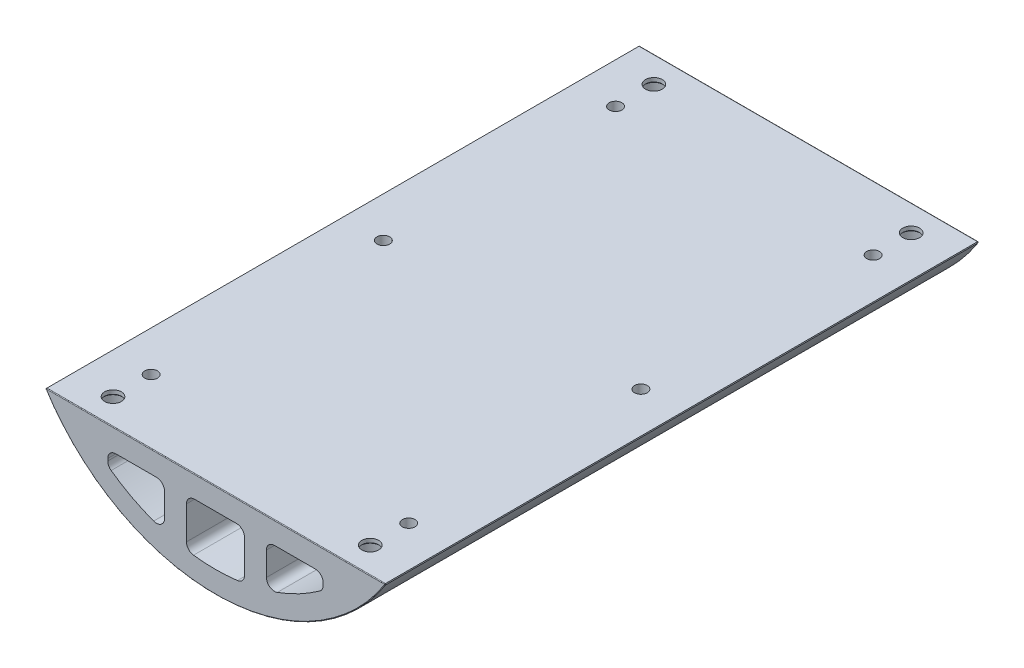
ISO-10303-21;
HEADER;
FILE_DESCRIPTION(('STEP AP214'),'2;1');
FILE_NAME('part.step','',(''),(''),'','','');
FILE_SCHEMA(('AUTOMOTIVE_DESIGN { 1 0 10303 214 1 1 1 1 }'));
ENDSEC;
DATA;
#1=APPLICATION_CONTEXT('core data for automotive mechanical design processes');
#2=APPLICATION_PROTOCOL_DEFINITION('international standard','automotive_design',2000,#1);
#3=PRODUCT_CONTEXT('',#1,'mechanical');
#4=PRODUCT('Part','Part','',(#3));
#5=PRODUCT_RELATED_PRODUCT_CATEGORY('part','',(#4));
#6=PRODUCT_DEFINITION_FORMATION('','',#4);
#7=PRODUCT_DEFINITION_CONTEXT('part definition',#1,'design');
#8=PRODUCT_DEFINITION('design','',#6,#7);
#9=PRODUCT_DEFINITION_SHAPE('','',#8);
#10=(LENGTH_UNIT() NAMED_UNIT(*) SI_UNIT(.MILLI.,.METRE.));
#11=(NAMED_UNIT(*) PLANE_ANGLE_UNIT() SI_UNIT($,.RADIAN.));
#12=(NAMED_UNIT(*) SI_UNIT($,.STERADIAN.) SOLID_ANGLE_UNIT());
#13=UNCERTAINTY_MEASURE_WITH_UNIT(LENGTH_MEASURE(1.E-05),#10,'distance_accuracy_value','');
#14=(GEOMETRIC_REPRESENTATION_CONTEXT(3) GLOBAL_UNCERTAINTY_ASSIGNED_CONTEXT((#13)) GLOBAL_UNIT_ASSIGNED_CONTEXT((#10,
#11,#12)) REPRESENTATION_CONTEXT('',''));
#15=CARTESIAN_POINT('',(0.,0.,0.));
#16=DIRECTION('',(0.,0.,1.));
#17=DIRECTION('',(1.,0.,0.));
#18=AXIS2_PLACEMENT_3D('',#15,#16,#17);
#19=CARTESIAN_POINT('',(0.,0.,58.4));
#20=DIRECTION('',(0.,0.,-1.));
#21=DIRECTION('',(-1.,0.,0.));
#22=AXIS2_PLACEMENT_3D('',#19,#20,#21);
#23=CYLINDRICAL_SURFACE('',#22,39.624);
#24=CARTESIAN_POINT('',(-25.3437978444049,-30.4590427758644,46.97));
#25=CARTESIAN_POINT('',(-25.2625077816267,-30.5266805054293,46.9700008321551));
#26=CARTESIAN_POINT('',(-25.1808834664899,-30.5940423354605,46.9620823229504));
#27=CARTESIAN_POINT('',(-25.0189312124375,-30.726623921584,46.9298698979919));
#28=CARTESIAN_POINT('',(-24.9386048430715,-30.7918411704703,46.9055574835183));
#29=CARTESIAN_POINT('',(-24.7930139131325,-30.9091458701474,46.8444762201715));
#30=CARTESIAN_POINT('',(-24.7272376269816,-30.9617775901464,46.8099846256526));
#31=CARTESIAN_POINT('',(-24.6005873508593,-31.0625014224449,46.7278770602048));
#32=CARTESIAN_POINT('',(-24.5397062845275,-31.1106001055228,46.6802804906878));
#33=CARTESIAN_POINT('',(-24.4370819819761,-31.1912451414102,46.5827366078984));
#34=CARTESIAN_POINT('',(-24.393959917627,-31.2249684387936,46.5352173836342));
#35=CARTESIAN_POINT('',(-24.314256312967,-31.2870718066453,46.431890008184));
#36=CARTESIAN_POINT('',(-24.2776678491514,-31.3154575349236,46.376090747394));
#37=CARTESIAN_POINT('',(-24.2179968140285,-31.3616200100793,46.2662184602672));
#38=CARTESIAN_POINT('',(-24.1937008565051,-31.3803583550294,46.2132113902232));
#39=CARTESIAN_POINT('',(-24.152401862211,-31.4121559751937,46.1028084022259));
#40=CARTESIAN_POINT('',(-24.1353954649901,-31.4252178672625,46.0454145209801));
#41=CARTESIAN_POINT('',(-24.1096453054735,-31.4449781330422,45.9274321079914));
#42=CARTESIAN_POINT('',(-24.1009401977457,-31.45164673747,45.8668300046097));
#43=CARTESIAN_POINT('',(-24.0925429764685,-31.4580797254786,45.744642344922));
#44=CARTESIAN_POINT('',(-24.0928483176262,-31.4578460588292,45.6830570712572));
#45=CARTESIAN_POINT('',(-24.1020446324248,-31.4508003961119,45.5660058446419));
#46=CARTESIAN_POINT('',(-24.1102350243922,-31.4445251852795,45.5104496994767));
#47=CARTESIAN_POINT('',(-24.1337019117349,-31.4265178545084,45.401789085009));
#48=CARTESIAN_POINT('',(-24.1489788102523,-31.4147854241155,45.348684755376));
#49=CARTESIAN_POINT('',(-24.1863315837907,-31.3860368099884,45.244700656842));
#50=CARTESIAN_POINT('',(-24.2085835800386,-31.3688836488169,45.1939228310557));
#51=CARTESIAN_POINT('',(-24.2586994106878,-31.3301433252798,45.0970725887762));
#52=CARTESIAN_POINT('',(-24.2865650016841,-31.308554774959,45.0510016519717));
#53=CARTESIAN_POINT('',(-24.3509583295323,-31.2585040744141,44.9581753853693));
#54=CARTESIAN_POINT('',(-24.3881478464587,-31.2295072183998,44.912169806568));
#55=CARTESIAN_POINT('',(-24.4670620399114,-31.1677200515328,44.8271355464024));
#56=CARTESIAN_POINT('',(-24.5087906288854,-31.134926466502,44.7881129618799));
#57=CARTESIAN_POINT('',(-24.6160629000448,-31.0502399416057,44.7003412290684));
#58=CARTESIAN_POINT('',(-24.6835778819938,-30.996617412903,44.6556475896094));
#59=CARTESIAN_POINT('',(-24.8230041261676,-30.8850748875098,44.58089904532));
#60=CARTESIAN_POINT('',(-24.8949215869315,-30.827148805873,44.5508653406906));
#61=CARTESIAN_POINT('',(-25.0418738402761,-30.7078978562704,44.5045383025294));
#62=CARTESIAN_POINT('',(-25.1169362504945,-30.646539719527,44.4884201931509));
#63=CARTESIAN_POINT('',(-25.2675856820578,-30.5224512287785,44.470018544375));
#64=CARTESIAN_POINT('',(-25.3431727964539,-30.4597206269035,44.4677375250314));
#65=CARTESIAN_POINT('',(-25.5067470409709,-30.322936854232,44.4775020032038));
#66=CARTESIAN_POINT('',(-25.594557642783,-30.24884734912,44.4921581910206));
#67=CARTESIAN_POINT('',(-25.7665540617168,-30.1024716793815,44.540275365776));
#68=CARTESIAN_POINT('',(-25.8507399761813,-30.0301854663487,44.5737358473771));
#69=CARTESIAN_POINT('',(-25.9955756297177,-29.9048256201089,44.650921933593));
#70=CARTESIAN_POINT('',(-26.0574469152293,-29.8509131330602,44.6909989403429));
#71=CARTESIAN_POINT('',(-26.1753146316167,-29.7476113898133,44.7836861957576));
#72=CARTESIAN_POINT('',(-26.2313202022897,-29.6982151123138,44.8362765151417));
#73=CARTESIAN_POINT('',(-26.3225369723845,-29.6173634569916,44.9401670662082));
#74=CARTESIAN_POINT('',(-26.3595180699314,-29.5844425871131,44.9887681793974));
#75=CARTESIAN_POINT('',(-26.4271166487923,-29.5240737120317,45.0932792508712));
#76=CARTESIAN_POINT('',(-26.4577421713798,-29.496618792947,45.1491798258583));
#77=CARTESIAN_POINT('',(-26.506180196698,-29.4530925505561,45.2571535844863));
#78=CARTESIAN_POINT('',(-26.5252987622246,-29.4358684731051,45.3081717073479));
#79=CARTESIAN_POINT('',(-26.55696209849,-29.4073051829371,45.4137901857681));
#80=CARTESIAN_POINT('',(-26.5695110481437,-29.3959622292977,45.4683882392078));
#81=CARTESIAN_POINT('',(-26.5872283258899,-29.3799389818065,45.5800386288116));
#82=CARTESIAN_POINT('',(-26.592359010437,-29.3752926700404,45.6371019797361));
#83=CARTESIAN_POINT('',(-26.5947087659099,-29.3731653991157,45.7515240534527));
#84=CARTESIAN_POINT('',(-26.59192925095,-29.3756831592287,45.8088827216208));
#85=CARTESIAN_POINT('',(-26.5792459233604,-29.3871591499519,45.9172192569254));
#86=CARTESIAN_POINT('',(-26.5699539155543,-29.3955642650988,45.9683310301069));
#87=CARTESIAN_POINT('',(-26.5454975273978,-29.4176512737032,46.0679209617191));
#88=CARTESIAN_POINT('',(-26.530332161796,-29.4313340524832,46.1163986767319));
#89=CARTESIAN_POINT('',(-26.4937644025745,-29.4642573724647,46.2128561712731));
#90=CARTESIAN_POINT('',(-26.4720232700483,-29.4837990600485,46.260602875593));
#91=CARTESIAN_POINT('',(-26.4237573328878,-29.5270634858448,46.3515402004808));
#92=CARTESIAN_POINT('',(-26.3972297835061,-29.5507886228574,46.3947281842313));
#93=CARTESIAN_POINT('',(-26.3257854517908,-29.614484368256,46.4970658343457));
#94=CARTESIAN_POINT('',(-26.2783771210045,-29.6565810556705,46.5531645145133));
#95=CARTESIAN_POINT('',(-26.1771441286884,-29.7459760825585,46.6544438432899));
#96=CARTESIAN_POINT('',(-26.123303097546,-29.7932876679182,46.6995957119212));
#97=CARTESIAN_POINT('',(-25.9950911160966,-29.905279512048,46.7905746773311));
#98=CARTESIAN_POINT('',(-25.9192375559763,-29.9710715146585,46.8329386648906));
#99=CARTESIAN_POINT('',(-25.762926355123,-30.1055415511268,46.9007121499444));
#100=CARTESIAN_POINT('',(-25.6824732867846,-30.1742167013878,46.9261381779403));
#101=CARTESIAN_POINT('',(-25.5584611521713,-30.279193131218,46.9521884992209));
#102=CARTESIAN_POINT('',(-25.5157968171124,-30.3151549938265,46.9588600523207));
#103=CARTESIAN_POINT('',(-25.4300523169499,-30.3871181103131,46.9677652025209));
#104=CARTESIAN_POINT('',(-25.386972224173,-30.4231193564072,46.9699995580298));
#105=CARTESIAN_POINT('',(-25.3437978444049,-30.4590427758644,46.97));
#106=B_SPLINE_CURVE_WITH_KNOTS('',3,(#24,#25,#26,#27,#28,#29,#30,#31,#32,#33,#34,#35,#36,#37,
#38,#39,#40,#41,#42,#43,#44,#45,#46,#47,#48,#49,#50,#51,#52,#53,#54,#55,#56,#57,#58,#59,#60,#61,
#62,#63,#64,#65,#66,#67,#68,#69,#70,#71,#72,#73,#74,#75,#76,#77,#78,#79,#80,#81,#82,#83,#84,#85,
#86,#87,#88,#89,#90,#91,#92,#93,#94,#95,#96,#97,#98,#99,#100,#101,#102,#103,#104,#105),
.UNSPECIFIED.,.T.,.F.,(4,2,2,2,2,2,2,2,2,2,2,2,2,2,2,2,2,2,2,2,2,2,2,2,2,2,2,2,2,2,2,2,2,2,2,2,
2,2,2,2,4),(0.,0.317079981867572,0.634518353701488,0.906582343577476,1.17824569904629,
1.39489337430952,1.61131009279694,1.7942804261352,1.97716632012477,2.1608997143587,
2.34458120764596,2.51331766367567,2.68206372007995,2.85547019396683,3.02893101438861,
3.22584592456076,3.42293193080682,3.7126988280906,4.00288353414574,4.29667104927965,
4.5905120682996,4.9364296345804,5.28233790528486,5.5553593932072,5.82794893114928,
6.03535028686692,6.24248761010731,6.41320661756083,6.5838168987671,6.75528992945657,
6.92673230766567,7.08391468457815,7.24112344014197,7.40845535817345,7.57588353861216,
7.82845067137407,8.08167479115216,8.40694732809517,8.73190195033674,8.90033670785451,
9.06874267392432),.UNSPECIFIED.);
#107=CARTESIAN_POINT('',(-25.3437978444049,-30.4590427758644,46.97));
#108=VERTEX_POINT('',#107);
#109=EDGE_CURVE('E1187',#108,#108,#106,.T.);
#110=ORIENTED_EDGE('',*,*,#109,.T.);
#111=EDGE_LOOP('',(#110));
#112=FACE_BOUND('',#111,.T.);
#113=CARTESIAN_POINT('',(-25.3437978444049,-30.4590427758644,1.25));
#114=CARTESIAN_POINT('',(-25.2625077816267,-30.5266805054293,1.25000083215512));
#115=CARTESIAN_POINT('',(-25.1808834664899,-30.5940423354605,1.24208232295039));
#116=CARTESIAN_POINT('',(-25.0189312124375,-30.726623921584,1.20986989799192));
#117=CARTESIAN_POINT('',(-24.9386048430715,-30.7918411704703,1.18555748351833));
#118=CARTESIAN_POINT('',(-24.7930139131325,-30.9091458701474,1.1244762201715));
#119=CARTESIAN_POINT('',(-24.7272376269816,-30.9617775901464,1.08998462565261));
#120=CARTESIAN_POINT('',(-24.6005873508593,-31.0625014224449,1.00787706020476));
#121=CARTESIAN_POINT('',(-24.5397062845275,-31.1106001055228,0.960280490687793));
#122=CARTESIAN_POINT('',(-24.4370819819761,-31.1912451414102,0.86273660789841));
#123=CARTESIAN_POINT('',(-24.393959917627,-31.2249684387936,0.815217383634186));
#124=CARTESIAN_POINT('',(-24.314256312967,-31.2870718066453,0.711890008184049));
#125=CARTESIAN_POINT('',(-24.2776678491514,-31.3154575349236,0.656090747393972));
#126=CARTESIAN_POINT('',(-24.2179968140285,-31.3616200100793,0.546218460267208));
#127=CARTESIAN_POINT('',(-24.1937008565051,-31.3803583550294,0.493211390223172));
#128=CARTESIAN_POINT('',(-24.152401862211,-31.4121559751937,0.38280840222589));
#129=CARTESIAN_POINT('',(-24.1353954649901,-31.4252178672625,0.325414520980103));
#130=CARTESIAN_POINT('',(-24.1096453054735,-31.4449781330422,0.207432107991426));
#131=CARTESIAN_POINT('',(-24.1009401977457,-31.45164673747,0.146830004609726));
#132=CARTESIAN_POINT('',(-24.0925429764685,-31.4580797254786,0.0246423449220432));
#133=CARTESIAN_POINT('',(-24.0928483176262,-31.4578460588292,-0.0369429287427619));
#134=CARTESIAN_POINT('',(-24.1020446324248,-31.4508003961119,-0.153994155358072));
#135=CARTESIAN_POINT('',(-24.1102350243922,-31.4445251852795,-0.20955030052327));
#136=CARTESIAN_POINT('',(-24.1337019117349,-31.4265178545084,-0.318210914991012));
#137=CARTESIAN_POINT('',(-24.1489788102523,-31.4147854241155,-0.37131524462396));
#138=CARTESIAN_POINT('',(-24.1863315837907,-31.3860368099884,-0.475299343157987));
#139=CARTESIAN_POINT('',(-24.2085835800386,-31.3688836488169,-0.526077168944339));
#140=CARTESIAN_POINT('',(-24.2586994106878,-31.3301433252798,-0.62292741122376));
#141=CARTESIAN_POINT('',(-24.2865650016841,-31.308554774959,-0.668998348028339));
#142=CARTESIAN_POINT('',(-24.3509583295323,-31.2585040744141,-0.76182461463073));
#143=CARTESIAN_POINT('',(-24.3881478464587,-31.2295072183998,-0.807830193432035));
#144=CARTESIAN_POINT('',(-24.4670620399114,-31.1677200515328,-0.892864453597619));
#145=CARTESIAN_POINT('',(-24.5087906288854,-31.134926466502,-0.93188703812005));
#146=CARTESIAN_POINT('',(-24.6160629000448,-31.0502399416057,-1.01965877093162));
#147=CARTESIAN_POINT('',(-24.6835778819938,-30.996617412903,-1.06435241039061));
#148=CARTESIAN_POINT('',(-24.8230041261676,-30.8850748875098,-1.13910095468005));
#149=CARTESIAN_POINT('',(-24.8949215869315,-30.827148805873,-1.16913465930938));
#150=CARTESIAN_POINT('',(-25.0418738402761,-30.7078978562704,-1.21546169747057));
#151=CARTESIAN_POINT('',(-25.1169362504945,-30.646539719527,-1.23157980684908));
#152=CARTESIAN_POINT('',(-25.2675856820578,-30.5224512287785,-1.24998145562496));
#153=CARTESIAN_POINT('',(-25.3431727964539,-30.4597206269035,-1.25226247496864));
#154=CARTESIAN_POINT('',(-25.506747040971,-30.322936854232,-1.24249799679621));
#155=CARTESIAN_POINT('',(-25.594557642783,-30.24884734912,-1.22784180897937));
#156=CARTESIAN_POINT('',(-25.7665540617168,-30.1024716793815,-1.179724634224));
#157=CARTESIAN_POINT('',(-25.8507399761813,-30.0301854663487,-1.14626415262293));
#158=CARTESIAN_POINT('',(-25.9955756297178,-29.9048256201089,-1.06907806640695));
#159=CARTESIAN_POINT('',(-26.0574469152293,-29.8509131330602,-1.02900105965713));
#160=CARTESIAN_POINT('',(-26.1753146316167,-29.7476113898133,-0.936313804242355));
#161=CARTESIAN_POINT('',(-26.2313202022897,-29.6982151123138,-0.883723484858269));
#162=CARTESIAN_POINT('',(-26.3225369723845,-29.6173634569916,-0.779832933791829));
#163=CARTESIAN_POINT('',(-26.3595180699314,-29.5844425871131,-0.731231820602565));
#164=CARTESIAN_POINT('',(-26.4271166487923,-29.5240737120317,-0.626720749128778));
#165=CARTESIAN_POINT('',(-26.4577421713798,-29.496618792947,-0.570820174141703));
#166=CARTESIAN_POINT('',(-26.506180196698,-29.4530925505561,-0.462846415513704));
#167=CARTESIAN_POINT('',(-26.5252987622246,-29.4358684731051,-0.411828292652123));
#168=CARTESIAN_POINT('',(-26.5569620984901,-29.4073051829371,-0.306209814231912));
#169=CARTESIAN_POINT('',(-26.5695110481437,-29.3959622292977,-0.251611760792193));
#170=CARTESIAN_POINT('',(-26.5872283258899,-29.3799389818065,-0.13996137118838));
#171=CARTESIAN_POINT('',(-26.592359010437,-29.3752926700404,-0.0828980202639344));
#172=CARTESIAN_POINT('',(-26.5947087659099,-29.3731653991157,0.0315240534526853));
#173=CARTESIAN_POINT('',(-26.59192925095,-29.3756831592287,0.0888827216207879));
#174=CARTESIAN_POINT('',(-26.5792459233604,-29.3871591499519,0.197219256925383));
#175=CARTESIAN_POINT('',(-26.5699539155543,-29.3955642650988,0.248331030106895));
#176=CARTESIAN_POINT('',(-26.5454975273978,-29.4176512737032,0.347920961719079));
#177=CARTESIAN_POINT('',(-26.530332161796,-29.4313340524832,0.396398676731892));
#178=CARTESIAN_POINT('',(-26.4937644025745,-29.4642573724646,0.492856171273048));
#179=CARTESIAN_POINT('',(-26.4720232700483,-29.4837990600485,0.540602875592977));
#180=CARTESIAN_POINT('',(-26.4237573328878,-29.5270634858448,0.631540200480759));
#181=CARTESIAN_POINT('',(-26.3972297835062,-29.5507886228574,0.674728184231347));
#182=CARTESIAN_POINT('',(-26.3257854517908,-29.614484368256,0.777065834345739));
#183=CARTESIAN_POINT('',(-26.2783771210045,-29.6565810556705,0.833164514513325));
#184=CARTESIAN_POINT('',(-26.1771441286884,-29.7459760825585,0.934443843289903));
#185=CARTESIAN_POINT('',(-26.123303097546,-29.7932876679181,0.979595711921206));
#186=CARTESIAN_POINT('',(-25.9950911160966,-29.9052795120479,1.07057467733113));
#187=CARTESIAN_POINT('',(-25.9192375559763,-29.9710715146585,1.11293866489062));
#188=CARTESIAN_POINT('',(-25.762926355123,-30.1055415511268,1.18071214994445));
#189=CARTESIAN_POINT('',(-25.6824732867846,-30.1742167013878,1.20613817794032));
#190=CARTESIAN_POINT('',(-25.5584611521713,-30.279193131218,1.23218849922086));
#191=CARTESIAN_POINT('',(-25.5157968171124,-30.3151549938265,1.23886005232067));
#192=CARTESIAN_POINT('',(-25.4300523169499,-30.3871181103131,1.24776520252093));
#193=CARTESIAN_POINT('',(-25.386972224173,-30.4231193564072,1.24999955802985));
#194=CARTESIAN_POINT('',(-25.3437978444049,-30.4590427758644,1.25));
#195=B_SPLINE_CURVE_WITH_KNOTS('',3,(#113,#114,#115,#116,#117,#118,#119,#120,#121,#122,#123,
#124,#125,#126,#127,#128,#129,#130,#131,#132,#133,#134,#135,#136,#137,#138,#139,#140,#141,#142,
#143,#144,#145,#146,#147,#148,#149,#150,#151,#152,#153,#154,#155,#156,#157,#158,#159,#160,#161,
#162,#163,#164,#165,#166,#167,#168,#169,#170,#171,#172,#173,#174,#175,#176,#177,#178,#179,#180,
#181,#182,#183,#184,#185,#186,#187,#188,#189,#190,#191,#192,#193,#194),.UNSPECIFIED.,.T.,.F.,(4,
2,2,2,2,2,2,2,2,2,2,2,2,2,2,2,2,2,2,2,2,2,2,2,2,2,2,2,2,2,2,2,2,2,2,2,2,2,2,2,4),(0.,
0.317079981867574,0.634518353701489,0.906582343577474,1.1782456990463,1.39489337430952,
1.61131009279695,1.79428042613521,1.97716632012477,2.16089971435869,2.34458120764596,
2.51331766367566,2.68206372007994,2.85547019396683,3.0289310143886,3.22584592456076,
3.42293193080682,3.71269882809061,4.00288353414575,4.29667104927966,4.59051206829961,
4.93642963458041,5.28233790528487,5.55535939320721,5.82794893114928,6.03535028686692,
6.24248761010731,6.41320661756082,6.58381689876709,6.75528992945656,6.92673230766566,
7.08391468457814,7.24112344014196,7.40845535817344,7.57588353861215,7.82845067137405,
8.08167479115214,8.40694732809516,8.73190195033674,8.90033670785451,9.06874267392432),.UNSPECIFIED.);
#196=CARTESIAN_POINT('',(-25.3437978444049,-30.4590427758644,1.25));
#197=VERTEX_POINT('',#196);
#198=EDGE_CURVE('E1194',#197,#197,#195,.T.);
#199=ORIENTED_EDGE('',*,*,#198,.T.);
#200=EDGE_LOOP('',(#199));
#201=FACE_BOUND('',#200,.T.);
#202=CARTESIAN_POINT('',(-25.3437978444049,-30.4590427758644,-44.47));
#203=CARTESIAN_POINT('',(-25.2625077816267,-30.5266805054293,-44.4699991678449));
#204=CARTESIAN_POINT('',(-25.1808834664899,-30.5940423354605,-44.4779176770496));
#205=CARTESIAN_POINT('',(-25.0189312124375,-30.726623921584,-44.5101301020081));
#206=CARTESIAN_POINT('',(-24.9386048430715,-30.7918411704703,-44.5344425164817));
#207=CARTESIAN_POINT('',(-24.7930139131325,-30.9091458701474,-44.5955237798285));
#208=CARTESIAN_POINT('',(-24.7272376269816,-30.9617775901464,-44.6300153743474));
#209=CARTESIAN_POINT('',(-24.6005873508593,-31.0625014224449,-44.7121229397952));
#210=CARTESIAN_POINT('',(-24.5397062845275,-31.1106001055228,-44.7597195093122));
#211=CARTESIAN_POINT('',(-24.4370819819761,-31.1912451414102,-44.8572633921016));
#212=CARTESIAN_POINT('',(-24.393959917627,-31.2249684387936,-44.9047826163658));
#213=CARTESIAN_POINT('',(-24.314256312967,-31.2870718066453,-45.0081099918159));
#214=CARTESIAN_POINT('',(-24.2776678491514,-31.3154575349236,-45.063909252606));
#215=CARTESIAN_POINT('',(-24.2179968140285,-31.3616200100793,-45.1737815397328));
#216=CARTESIAN_POINT('',(-24.1937008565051,-31.3803583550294,-45.2267886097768));
#217=CARTESIAN_POINT('',(-24.152401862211,-31.4121559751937,-45.3371915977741));
#218=CARTESIAN_POINT('',(-24.1353954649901,-31.4252178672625,-45.3945854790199));
#219=CARTESIAN_POINT('',(-24.1096453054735,-31.4449781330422,-45.5125678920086));
#220=CARTESIAN_POINT('',(-24.1009401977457,-31.45164673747,-45.5731699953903));
#221=CARTESIAN_POINT('',(-24.0925429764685,-31.4580797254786,-45.695357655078));
#222=CARTESIAN_POINT('',(-24.0928483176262,-31.4578460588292,-45.7569429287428));
#223=CARTESIAN_POINT('',(-24.1020446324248,-31.4508003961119,-45.8739941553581));
#224=CARTESIAN_POINT('',(-24.1102350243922,-31.4445251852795,-45.9295503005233));
#225=CARTESIAN_POINT('',(-24.1337019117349,-31.4265178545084,-46.038210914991));
#226=CARTESIAN_POINT('',(-24.1489788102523,-31.4147854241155,-46.091315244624));
#227=CARTESIAN_POINT('',(-24.1863315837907,-31.3860368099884,-46.195299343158));
#228=CARTESIAN_POINT('',(-24.2085835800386,-31.3688836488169,-46.2460771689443));
#229=CARTESIAN_POINT('',(-24.2586994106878,-31.3301433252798,-46.3429274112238));
#230=CARTESIAN_POINT('',(-24.2865650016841,-31.308554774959,-46.3889983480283));
#231=CARTESIAN_POINT('',(-24.3509583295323,-31.2585040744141,-46.4818246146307));
#232=CARTESIAN_POINT('',(-24.3881478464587,-31.2295072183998,-46.527830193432));
#233=CARTESIAN_POINT('',(-24.4670620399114,-31.1677200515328,-46.6128644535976));
#234=CARTESIAN_POINT('',(-24.5087906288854,-31.134926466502,-46.65188703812));
#235=CARTESIAN_POINT('',(-24.6160629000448,-31.0502399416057,-46.7396587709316));
#236=CARTESIAN_POINT('',(-24.6835778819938,-30.996617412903,-46.7843524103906));
#237=CARTESIAN_POINT('',(-24.8230041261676,-30.8850748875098,-46.85910095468));
#238=CARTESIAN_POINT('',(-24.8949215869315,-30.827148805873,-46.8891346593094));
#239=CARTESIAN_POINT('',(-25.0418738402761,-30.7078978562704,-46.9354616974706));
#240=CARTESIAN_POINT('',(-25.1169362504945,-30.646539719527,-46.9515798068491));
#241=CARTESIAN_POINT('',(-25.2675856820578,-30.5224512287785,-46.969981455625));
#242=CARTESIAN_POINT('',(-25.3431727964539,-30.4597206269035,-46.9722624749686));
#243=CARTESIAN_POINT('',(-25.5067470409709,-30.322936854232,-46.9624979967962));
#244=CARTESIAN_POINT('',(-25.594557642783,-30.24884734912,-46.9478418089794));
#245=CARTESIAN_POINT('',(-25.7665540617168,-30.1024716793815,-46.899724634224));
#246=CARTESIAN_POINT('',(-25.8507399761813,-30.0301854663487,-46.8662641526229));
#247=CARTESIAN_POINT('',(-25.9955756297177,-29.9048256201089,-46.7890780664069));
#248=CARTESIAN_POINT('',(-26.0574469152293,-29.8509131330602,-46.7490010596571));
#249=CARTESIAN_POINT('',(-26.1753146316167,-29.7476113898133,-46.6563138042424));
#250=CARTESIAN_POINT('',(-26.2313202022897,-29.6982151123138,-46.6037234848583));
#251=CARTESIAN_POINT('',(-26.3225369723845,-29.6173634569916,-46.4998329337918));
#252=CARTESIAN_POINT('',(-26.3595180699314,-29.5844425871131,-46.4512318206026));
#253=CARTESIAN_POINT('',(-26.4271166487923,-29.5240737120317,-46.3467207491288));
#254=CARTESIAN_POINT('',(-26.4577421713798,-29.496618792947,-46.2908201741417));
#255=CARTESIAN_POINT('',(-26.506180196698,-29.4530925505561,-46.1828464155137));
#256=CARTESIAN_POINT('',(-26.5252987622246,-29.4358684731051,-46.1318282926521));
#257=CARTESIAN_POINT('',(-26.5569620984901,-29.4073051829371,-46.0262098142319));
#258=CARTESIAN_POINT('',(-26.5695110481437,-29.3959622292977,-45.9716117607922));
#259=CARTESIAN_POINT('',(-26.5872283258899,-29.3799389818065,-45.8599613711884));
#260=CARTESIAN_POINT('',(-26.592359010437,-29.3752926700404,-45.8028980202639));
#261=CARTESIAN_POINT('',(-26.5947087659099,-29.3731653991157,-45.6884759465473));
#262=CARTESIAN_POINT('',(-26.59192925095,-29.3756831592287,-45.6311172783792));
#263=CARTESIAN_POINT('',(-26.5792459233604,-29.3871591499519,-45.5227807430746));
#264=CARTESIAN_POINT('',(-26.5699539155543,-29.3955642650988,-45.4716689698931));
#265=CARTESIAN_POINT('',(-26.5454975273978,-29.4176512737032,-45.3720790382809));
#266=CARTESIAN_POINT('',(-26.530332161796,-29.4313340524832,-45.3236013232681));
#267=CARTESIAN_POINT('',(-26.4937644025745,-29.4642573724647,-45.2271438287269));
#268=CARTESIAN_POINT('',(-26.4720232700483,-29.4837990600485,-45.179397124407));
#269=CARTESIAN_POINT('',(-26.4237573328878,-29.5270634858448,-45.0884597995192));
#270=CARTESIAN_POINT('',(-26.3972297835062,-29.5507886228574,-45.0452718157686));
#271=CARTESIAN_POINT('',(-26.3257854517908,-29.614484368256,-44.9429341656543));
#272=CARTESIAN_POINT('',(-26.2783771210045,-29.6565810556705,-44.8868354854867));
#273=CARTESIAN_POINT('',(-26.1771441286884,-29.7459760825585,-44.7855561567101));
#274=CARTESIAN_POINT('',(-26.123303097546,-29.7932876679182,-44.7404042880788));
#275=CARTESIAN_POINT('',(-25.9950911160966,-29.905279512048,-44.6494253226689));
#276=CARTESIAN_POINT('',(-25.9192375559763,-29.9710715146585,-44.6070613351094));
#277=CARTESIAN_POINT('',(-25.762926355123,-30.1055415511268,-44.5392878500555));
#278=CARTESIAN_POINT('',(-25.6824732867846,-30.1742167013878,-44.5138618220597));
#279=CARTESIAN_POINT('',(-25.5584611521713,-30.279193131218,-44.4878115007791));
#280=CARTESIAN_POINT('',(-25.5157968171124,-30.3151549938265,-44.4811399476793));
#281=CARTESIAN_POINT('',(-25.4300523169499,-30.3871181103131,-44.4722347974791));
#282=CARTESIAN_POINT('',(-25.386972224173,-30.4231193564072,-44.4700004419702));
#283=CARTESIAN_POINT('',(-25.3437978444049,-30.4590427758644,-44.47));
#284=B_SPLINE_CURVE_WITH_KNOTS('',3,(#202,#203,#204,#205,#206,#207,#208,#209,#210,#211,#212,
#213,#214,#215,#216,#217,#218,#219,#220,#221,#222,#223,#224,#225,#226,#227,#228,#229,#230,#231,
#232,#233,#234,#235,#236,#237,#238,#239,#240,#241,#242,#243,#244,#245,#246,#247,#248,#249,#250,
#251,#252,#253,#254,#255,#256,#257,#258,#259,#260,#261,#262,#263,#264,#265,#266,#267,#268,#269,
#270,#271,#272,#273,#274,#275,#276,#277,#278,#279,#280,#281,#282,#283),.UNSPECIFIED.,.T.,.F.,(4,
2,2,2,2,2,2,2,2,2,2,2,2,2,2,2,2,2,2,2,2,2,2,2,2,2,2,2,2,2,2,2,2,2,2,2,2,2,2,2,4),(0.,
0.317079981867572,0.634518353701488,0.906582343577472,1.17824569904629,1.3948933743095,
1.61131009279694,1.7942804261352,1.97716632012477,2.1608997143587,2.34458120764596,
2.51331766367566,2.68206372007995,2.85547019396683,3.02893101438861,3.22584592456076,
3.42293193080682,3.7126988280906,4.00288353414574,4.29667104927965,4.5905120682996,
4.9364296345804,5.28233790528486,5.5553593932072,5.82794893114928,6.03535028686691,
6.24248761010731,6.41320661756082,6.5838168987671,6.75528992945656,6.92673230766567,
7.08391468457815,7.24112344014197,7.40845535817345,7.57588353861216,7.82845067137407,
8.08167479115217,8.40694732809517,8.73190195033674,8.90033670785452,9.06874267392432),.UNSPECIFIED.);
#285=CARTESIAN_POINT('',(-25.3437978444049,-30.4590427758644,-44.47));
#286=VERTEX_POINT('',#285);
#287=EDGE_CURVE('E1200',#286,#286,#284,.T.);
#288=ORIENTED_EDGE('',*,*,#287,.T.);
#289=EDGE_LOOP('',(#288));
#290=FACE_BOUND('',#289,.T.);
#291=CARTESIAN_POINT('',(25.3648984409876,-30.4414734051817,46.97));
#292=CARTESIAN_POINT('',(25.4460241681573,-30.3738757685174,46.9700001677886));
#293=CARTESIAN_POINT('',(25.5269357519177,-30.305904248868,46.9621131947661));
#294=CARTESIAN_POINT('',(25.6865828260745,-30.1707112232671,46.9306430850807));
#295=CARTESIAN_POINT('',(25.7653133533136,-30.1034916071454,46.9070267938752));
#296=CARTESIAN_POINT('',(25.9127646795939,-29.9766366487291,46.8461530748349));
#297=CARTESIAN_POINT('',(25.9817936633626,-29.9168101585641,46.8100485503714));
#298=CARTESIAN_POINT('',(26.1141916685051,-29.8013095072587,46.7236393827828));
#299=CARTESIAN_POINT('',(26.1775697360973,-29.745628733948,46.6733579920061));
#300=CARTESIAN_POINT('',(26.2811726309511,-29.6540869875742,46.5725142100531));
#301=CARTESIAN_POINT('',(26.3232232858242,-29.6167523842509,46.5251686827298));
#302=CARTESIAN_POINT('',(26.401066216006,-29.5473820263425,46.4221465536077));
#303=CARTESIAN_POINT('',(26.4368668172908,-29.5153392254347,46.3664812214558));
#304=CARTESIAN_POINT('',(26.494134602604,-29.4639338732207,46.2587898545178));
#305=CARTESIAN_POINT('',(26.517034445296,-29.4433176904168,46.2081296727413));
#306=CARTESIAN_POINT('',(26.5563012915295,-29.4079060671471,46.1024021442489));
#307=CARTESIAN_POINT('',(26.572672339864,-29.3931070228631,46.0473375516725));
#308=CARTESIAN_POINT('',(26.5978763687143,-29.3703021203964,45.9337083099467));
#309=CARTESIAN_POINT('',(26.606657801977,-29.3623427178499,45.8751225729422));
#310=CARTESIAN_POINT('',(26.6157639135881,-29.3540888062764,45.7567665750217));
#311=CARTESIAN_POINT('',(26.616092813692,-29.3537904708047,45.6969969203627));
#312=CARTESIAN_POINT('',(26.6087199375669,-29.3604736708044,45.5850873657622));
#313=CARTESIAN_POINT('',(26.601904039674,-29.3666521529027,45.5328359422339));
#314=CARTESIAN_POINT('',(26.5820402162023,-29.3846335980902,45.4305503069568));
#315=CARTESIAN_POINT('',(26.5689916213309,-29.3964371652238,45.3805163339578));
#316=CARTESIAN_POINT('',(26.5369132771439,-29.4253986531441,45.2822364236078));
#317=CARTESIAN_POINT('',(26.5177120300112,-29.4427099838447,45.2340926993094));
#318=CARTESIAN_POINT('',(26.4743948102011,-29.481666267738,45.1419741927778));
#319=CARTESIAN_POINT('',(26.4502761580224,-29.5033135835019,45.0980017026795));
#320=CARTESIAN_POINT('',(26.3854926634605,-29.5612892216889,44.9946180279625));
#321=CARTESIAN_POINT('',(26.3424272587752,-29.5996910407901,44.9378651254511));
#322=CARTESIAN_POINT('',(26.2498038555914,-29.6818636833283,44.8344002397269));
#323=CARTESIAN_POINT('',(26.2002312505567,-29.7256465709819,44.7877114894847));
#324=CARTESIAN_POINT('',(26.0808150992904,-29.8305294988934,44.6916706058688));
#325=CARTESIAN_POINT('',(26.0093484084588,-29.8928874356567,44.6457123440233));
#326=CARTESIAN_POINT('',(25.8613218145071,-30.0210431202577,44.5697859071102));
#327=CARTESIAN_POINT('',(25.784759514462,-30.0868424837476,44.5398253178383));
#328=CARTESIAN_POINT('',(25.627422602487,-30.2209765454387,44.4951067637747));
#329=CARTESIAN_POINT('',(25.5466025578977,-30.2893343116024,44.4805792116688));
#330=CARTESIAN_POINT('',(25.3836104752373,-30.4260583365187,44.4674670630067));
#331=CARTESIAN_POINT('',(25.3014375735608,-30.4944245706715,44.4688930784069));
#332=CARTESIAN_POINT('',(25.1281838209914,-30.637391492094,44.4891749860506));
#333=CARTESIAN_POINT('',(25.0371679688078,-30.7118024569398,44.5100210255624));
#334=CARTESIAN_POINT('',(24.8590316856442,-30.8561661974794,44.5730496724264));
#335=CARTESIAN_POINT('',(24.7719054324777,-30.9261257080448,44.6151991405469));
#336=CARTESIAN_POINT('',(24.6323762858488,-31.0372791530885,44.7048967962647));
#337=CARTESIAN_POINT('',(24.5777488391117,-31.0805406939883,44.7464551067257));
#338=CARTESIAN_POINT('',(24.4742236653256,-31.1621255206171,44.8401951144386));
#339=CARTESIAN_POINT('',(24.4253170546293,-31.2004564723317,44.8923599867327));
#340=CARTESIAN_POINT('',(24.3435768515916,-31.2642582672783,44.9968247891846));
#341=CARTESIAN_POINT('',(24.3094324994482,-31.2908033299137,45.0474385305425));
#342=CARTESIAN_POINT('',(24.248093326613,-31.3383607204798,45.1551292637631));
#343=CARTESIAN_POINT('',(24.2208964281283,-31.3593747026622,45.2122043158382));
#344=CARTESIAN_POINT('',(24.1748610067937,-31.394877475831,45.3321059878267));
#345=CARTESIAN_POINT('',(24.156085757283,-31.409316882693,45.3949720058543));
#346=CARTESIAN_POINT('',(24.1285835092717,-31.4304493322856,45.5241144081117));
#347=CARTESIAN_POINT('',(24.1198480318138,-31.4371489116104,45.5903878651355));
#348=CARTESIAN_POINT('',(24.1135495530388,-31.4419800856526,45.7152190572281));
#349=CARTESIAN_POINT('',(24.1146991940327,-31.4410989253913,45.7736781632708));
#350=CARTESIAN_POINT('',(24.1250733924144,-31.4331393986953,45.8894339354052));
#351=CARTESIAN_POINT('',(24.1342965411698,-31.426062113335,45.9467308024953));
#352=CARTESIAN_POINT('',(24.1598006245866,-31.4064587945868,46.0566255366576));
#353=CARTESIAN_POINT('',(24.1758324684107,-31.3941250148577,46.1093167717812));
#354=CARTESIAN_POINT('',(24.2140674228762,-31.364644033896,46.2109570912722));
#355=CARTESIAN_POINT('',(24.2362716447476,-31.3474959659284,46.2599054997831));
#356=CARTESIAN_POINT('',(24.2882042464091,-31.3072784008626,46.3576272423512));
#357=CARTESIAN_POINT('',(24.3184391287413,-31.2838074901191,46.4059642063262));
#358=CARTESIAN_POINT('',(24.3839122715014,-31.2328020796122,46.496726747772));
#359=CARTESIAN_POINT('',(24.4191540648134,-31.2052647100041,46.5391481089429));
#360=CARTESIAN_POINT('',(24.5099433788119,-31.1340434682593,46.6352246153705));
#361=CARTESIAN_POINT('',(24.5675958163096,-31.0885914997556,46.6855933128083));
#362=CARTESIAN_POINT('',(24.6882954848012,-30.9928282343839,46.7737140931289));
#363=CARTESIAN_POINT('',(24.7513526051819,-30.9425080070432,46.811442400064));
#364=CARTESIAN_POINT('',(24.8816372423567,-30.8378434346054,46.8751139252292));
#365=CARTESIAN_POINT('',(24.9489109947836,-30.7834523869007,46.900883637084));
#366=CARTESIAN_POINT('',(25.0850575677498,-30.6726091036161,46.9403291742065));
#367=CARTESIAN_POINT('',(25.153927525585,-30.6161604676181,46.9540251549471));
#368=CARTESIAN_POINT('',(25.2702454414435,-30.5201549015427,46.9673197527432));
#369=CARTESIAN_POINT('',(25.317608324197,-30.4808776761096,46.9699999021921));
#370=CARTESIAN_POINT('',(25.3648984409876,-30.4414734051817,46.97));
#371=B_SPLINE_CURVE_WITH_KNOTS('',3,(#291,#292,#293,#294,#295,#296,#297,#298,#299,#300,#301,
#302,#303,#304,#305,#306,#307,#308,#309,#310,#311,#312,#313,#314,#315,#316,#317,#318,#319,#320,
#321,#322,#323,#324,#325,#326,#327,#328,#329,#330,#331,#332,#333,#334,#335,#336,#337,#338,#339,
#340,#341,#342,#343,#344,#345,#346,#347,#348,#349,#350,#351,#352,#353,#354,#355,#356,#357,#358,
#359,#360,#361,#362,#363,#364,#365,#366,#367,#368,#369,#370),.UNSPECIFIED.,.T.,.F.,(4,2,2,2,2,2,
2,2,2,2,2,2,2,2,2,2,2,2,2,2,2,2,2,2,2,2,2,2,2,2,2,2,2,2,2,2,2,2,2,4),(0.,0.316639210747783,
0.633947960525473,0.927514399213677,1.22060211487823,1.44037149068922,1.65984583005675,
1.8370261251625,2.01409648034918,2.19236022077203,2.37053492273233,2.52896524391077,
2.68741258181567,2.85072959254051,3.01413583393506,3.25559473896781,3.49760521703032,
3.81213189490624,4.12680758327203,4.44611800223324,4.76564083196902,5.12199418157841,
5.47779489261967,5.72033213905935,5.96248761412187,6.16141845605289,6.36028973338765,
6.56063111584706,6.76080317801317,6.93534419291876,7.10985476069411,7.27846685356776,
7.44710932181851,7.63137606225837,7.81577347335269,8.08142247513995,8.34756838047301,
8.61746354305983,8.88690729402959,9.07148382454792),.UNSPECIFIED.);
#372=CARTESIAN_POINT('',(25.3648984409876,-30.4414734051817,46.97));
#373=VERTEX_POINT('',#372);
#374=EDGE_CURVE('E1208',#373,#373,#371,.T.);
#375=ORIENTED_EDGE('',*,*,#374,.T.);
#376=EDGE_LOOP('',(#375));
#377=FACE_BOUND('',#376,.T.);
#378=CARTESIAN_POINT('',(25.3648984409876,-30.4414734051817,1.25));
#379=CARTESIAN_POINT('',(25.4460241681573,-30.3738757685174,1.25000016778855));
#380=CARTESIAN_POINT('',(25.5269357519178,-30.305904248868,1.24211319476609));
#381=CARTESIAN_POINT('',(25.6865828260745,-30.1707112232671,1.21064308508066));
#382=CARTESIAN_POINT('',(25.7653133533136,-30.1034916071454,1.18702679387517));
#383=CARTESIAN_POINT('',(25.9127646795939,-29.9766366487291,1.12615307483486));
#384=CARTESIAN_POINT('',(25.9817936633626,-29.9168101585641,1.09004855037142));
#385=CARTESIAN_POINT('',(26.1141916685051,-29.8013095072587,1.00363938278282));
#386=CARTESIAN_POINT('',(26.1775697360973,-29.745628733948,0.95335799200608));
#387=CARTESIAN_POINT('',(26.2811726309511,-29.6540869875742,0.852514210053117));
#388=CARTESIAN_POINT('',(26.3232232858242,-29.6167523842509,0.805168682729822));
#389=CARTESIAN_POINT('',(26.401066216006,-29.5473820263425,0.702146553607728));
#390=CARTESIAN_POINT('',(26.4368668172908,-29.5153392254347,0.646481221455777));
#391=CARTESIAN_POINT('',(26.494134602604,-29.4639338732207,0.538789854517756));
#392=CARTESIAN_POINT('',(26.517034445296,-29.4433176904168,0.488129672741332));
#393=CARTESIAN_POINT('',(26.5563012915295,-29.4079060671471,0.382402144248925));
#394=CARTESIAN_POINT('',(26.572672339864,-29.3931070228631,0.327337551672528));
#395=CARTESIAN_POINT('',(26.5978763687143,-29.3703021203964,0.213708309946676));
#396=CARTESIAN_POINT('',(26.606657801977,-29.3623427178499,0.155122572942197));
#397=CARTESIAN_POINT('',(26.6157639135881,-29.3540888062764,0.0367665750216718));
#398=CARTESIAN_POINT('',(26.616092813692,-29.3537904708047,-0.0230030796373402));
#399=CARTESIAN_POINT('',(26.6087199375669,-29.3604736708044,-0.134912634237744));
#400=CARTESIAN_POINT('',(26.601904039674,-29.3666521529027,-0.187164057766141));
#401=CARTESIAN_POINT('',(26.5820402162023,-29.3846335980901,-0.289449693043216));
#402=CARTESIAN_POINT('',(26.5689916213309,-29.3964371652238,-0.339483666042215));
#403=CARTESIAN_POINT('',(26.5369132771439,-29.4253986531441,-0.43776357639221));
#404=CARTESIAN_POINT('',(26.5177120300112,-29.4427099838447,-0.485907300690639));
#405=CARTESIAN_POINT('',(26.4743948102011,-29.481666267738,-0.578025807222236));
#406=CARTESIAN_POINT('',(26.4502761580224,-29.5033135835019,-0.621998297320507));
#407=CARTESIAN_POINT('',(26.3854926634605,-29.5612892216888,-0.725381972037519));
#408=CARTESIAN_POINT('',(26.3424272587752,-29.5996910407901,-0.782134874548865));
#409=CARTESIAN_POINT('',(26.2498038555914,-29.6818636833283,-0.885599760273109));
#410=CARTESIAN_POINT('',(26.2002312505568,-29.7256465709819,-0.932288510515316));
#411=CARTESIAN_POINT('',(26.0808150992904,-29.8305294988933,-1.02832939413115));
#412=CARTESIAN_POINT('',(26.0093484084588,-29.8928874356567,-1.07428765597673));
#413=CARTESIAN_POINT('',(25.8613218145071,-30.0210431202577,-1.15021409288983));
#414=CARTESIAN_POINT('',(25.7847595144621,-30.0868424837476,-1.1801746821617));
#415=CARTESIAN_POINT('',(25.627422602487,-30.2209765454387,-1.22489323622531));
#416=CARTESIAN_POINT('',(25.5466025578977,-30.2893343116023,-1.2394207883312));
#417=CARTESIAN_POINT('',(25.3836104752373,-30.4260583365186,-1.25253293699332));
#418=CARTESIAN_POINT('',(25.3014375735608,-30.4944245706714,-1.25110692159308));
#419=CARTESIAN_POINT('',(25.1281838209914,-30.637391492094,-1.23082501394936));
#420=CARTESIAN_POINT('',(25.0371679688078,-30.7118024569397,-1.20997897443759));
#421=CARTESIAN_POINT('',(24.8590316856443,-30.8561661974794,-1.14695032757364));
#422=CARTESIAN_POINT('',(24.7719054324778,-30.9261257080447,-1.10480085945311));
#423=CARTESIAN_POINT('',(24.6323762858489,-31.0372791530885,-1.01510320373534));
#424=CARTESIAN_POINT('',(24.5777488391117,-31.0805406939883,-0.973544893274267));
#425=CARTESIAN_POINT('',(24.4742236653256,-31.1621255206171,-0.879804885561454));
#426=CARTESIAN_POINT('',(24.4253170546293,-31.2004564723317,-0.827640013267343));
#427=CARTESIAN_POINT('',(24.3435768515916,-31.2642582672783,-0.723175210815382));
#428=CARTESIAN_POINT('',(24.3094324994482,-31.2908033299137,-0.672561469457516));
#429=CARTESIAN_POINT('',(24.248093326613,-31.3383607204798,-0.564870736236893));
#430=CARTESIAN_POINT('',(24.2208964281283,-31.3593747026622,-0.507795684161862));
#431=CARTESIAN_POINT('',(24.1748610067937,-31.394877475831,-0.387894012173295));
#432=CARTESIAN_POINT('',(24.156085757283,-31.409316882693,-0.325027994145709));
#433=CARTESIAN_POINT('',(24.1285835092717,-31.4304493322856,-0.195885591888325));
#434=CARTESIAN_POINT('',(24.1198480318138,-31.4371489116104,-0.129612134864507));
#435=CARTESIAN_POINT('',(24.1135495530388,-31.4419800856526,-0.00478094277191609));
#436=CARTESIAN_POINT('',(24.1146991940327,-31.4410989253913,0.0536781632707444));
#437=CARTESIAN_POINT('',(24.1250733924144,-31.4331393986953,0.169433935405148));
#438=CARTESIAN_POINT('',(24.1342965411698,-31.426062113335,0.226730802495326));
#439=CARTESIAN_POINT('',(24.1598006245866,-31.4064587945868,0.336625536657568));
#440=CARTESIAN_POINT('',(24.1758324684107,-31.3941250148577,0.389316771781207));
#441=CARTESIAN_POINT('',(24.2140674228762,-31.364644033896,0.490957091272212));
#442=CARTESIAN_POINT('',(24.2362716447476,-31.3474959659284,0.539905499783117));
#443=CARTESIAN_POINT('',(24.2882042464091,-31.3072784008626,0.637627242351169));
#444=CARTESIAN_POINT('',(24.3184391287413,-31.2838074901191,0.685964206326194));
#445=CARTESIAN_POINT('',(24.3839122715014,-31.2328020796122,0.776726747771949));
#446=CARTESIAN_POINT('',(24.4191540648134,-31.2052647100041,0.81914810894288));
#447=CARTESIAN_POINT('',(24.5099433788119,-31.1340434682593,0.915224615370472));
#448=CARTESIAN_POINT('',(24.5675958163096,-31.0885914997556,0.965593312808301));
#449=CARTESIAN_POINT('',(24.6882954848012,-30.992828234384,1.0537140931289));
#450=CARTESIAN_POINT('',(24.7513526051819,-30.9425080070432,1.09144240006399));
#451=CARTESIAN_POINT('',(24.8816372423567,-30.8378434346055,1.15511392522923));
#452=CARTESIAN_POINT('',(24.9489109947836,-30.7834523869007,1.18088363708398));
#453=CARTESIAN_POINT('',(25.0850575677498,-30.6726091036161,1.2203291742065));
#454=CARTESIAN_POINT('',(25.1539275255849,-30.6161604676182,1.2340251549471));
#455=CARTESIAN_POINT('',(25.2702454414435,-30.5201549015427,1.24731975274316));
#456=CARTESIAN_POINT('',(25.317608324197,-30.4808776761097,1.24999990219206));
#457=CARTESIAN_POINT('',(25.3648984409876,-30.4414734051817,1.25));
#458=B_SPLINE_CURVE_WITH_KNOTS('',3,(#378,#379,#380,#381,#382,#383,#384,#385,#386,#387,#388,
#389,#390,#391,#392,#393,#394,#395,#396,#397,#398,#399,#400,#401,#402,#403,#404,#405,#406,#407,
#408,#409,#410,#411,#412,#413,#414,#415,#416,#417,#418,#419,#420,#421,#422,#423,#424,#425,#426,
#427,#428,#429,#430,#431,#432,#433,#434,#435,#436,#437,#438,#439,#440,#441,#442,#443,#444,#445,
#446,#447,#448,#449,#450,#451,#452,#453,#454,#455,#456,#457),.UNSPECIFIED.,.T.,.F.,(4,2,2,2,2,2,
2,2,2,2,2,2,2,2,2,2,2,2,2,2,2,2,2,2,2,2,2,2,2,2,2,2,2,2,2,2,2,2,2,4),(0.,0.316639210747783,
0.633947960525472,0.927514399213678,1.22060211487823,1.44037149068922,1.65984583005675,
1.83702612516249,2.01409648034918,2.19236022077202,2.37053492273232,2.52896524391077,
2.68741258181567,2.85072959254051,3.01413583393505,3.2555947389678,3.49760521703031,
3.81213189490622,4.12680758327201,4.44611800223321,4.76564083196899,5.12199418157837,
5.47779489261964,5.72033213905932,5.96248761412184,6.16141845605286,6.36028973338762,
6.56063111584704,6.76080317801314,6.93534419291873,7.10985476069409,7.27846685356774,
7.44710932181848,7.63137606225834,7.81577347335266,8.08142247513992,8.34756838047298,
8.61746354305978,8.88690729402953,9.07148382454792),.UNSPECIFIED.);
#459=CARTESIAN_POINT('',(25.3648984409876,-30.4414734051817,1.25));
#460=VERTEX_POINT('',#459);
#461=EDGE_CURVE('E1213',#460,#460,#458,.T.);
#462=ORIENTED_EDGE('',*,*,#461,.T.);
#463=EDGE_LOOP('',(#462));
#464=FACE_BOUND('',#463,.T.);
#465=CARTESIAN_POINT('',(25.3648984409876,-30.4414734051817,-44.47));
#466=CARTESIAN_POINT('',(25.4460241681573,-30.3738757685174,-44.4699998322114));
#467=CARTESIAN_POINT('',(25.5269357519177,-30.305904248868,-44.4778868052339));
#468=CARTESIAN_POINT('',(25.6865828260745,-30.1707112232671,-44.5093569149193));
#469=CARTESIAN_POINT('',(25.7653133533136,-30.1034916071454,-44.5329732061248));
#470=CARTESIAN_POINT('',(25.9127646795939,-29.9766366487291,-44.5938469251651));
#471=CARTESIAN_POINT('',(25.9817936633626,-29.9168101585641,-44.6299514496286));
#472=CARTESIAN_POINT('',(26.1141916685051,-29.8013095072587,-44.7163606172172));
#473=CARTESIAN_POINT('',(26.1775697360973,-29.745628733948,-44.7666420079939));
#474=CARTESIAN_POINT('',(26.2811726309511,-29.6540869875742,-44.8674857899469));
#475=CARTESIAN_POINT('',(26.3232232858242,-29.6167523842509,-44.9148313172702));
#476=CARTESIAN_POINT('',(26.401066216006,-29.5473820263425,-45.0178534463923));
#477=CARTESIAN_POINT('',(26.4368668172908,-29.5153392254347,-45.0735187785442));
#478=CARTESIAN_POINT('',(26.494134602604,-29.4639338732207,-45.1812101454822));
#479=CARTESIAN_POINT('',(26.517034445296,-29.4433176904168,-45.2318703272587));
#480=CARTESIAN_POINT('',(26.5563012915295,-29.4079060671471,-45.3375978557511));
#481=CARTESIAN_POINT('',(26.572672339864,-29.3931070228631,-45.3926624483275));
#482=CARTESIAN_POINT('',(26.5978763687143,-29.3703021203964,-45.5062916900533));
#483=CARTESIAN_POINT('',(26.606657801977,-29.3623427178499,-45.5648774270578));
#484=CARTESIAN_POINT('',(26.6157639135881,-29.3540888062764,-45.6832334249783));
#485=CARTESIAN_POINT('',(26.616092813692,-29.3537904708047,-45.7430030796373));
#486=CARTESIAN_POINT('',(26.6087199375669,-29.3604736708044,-45.8549126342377));
#487=CARTESIAN_POINT('',(26.601904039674,-29.3666521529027,-45.9071640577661));
#488=CARTESIAN_POINT('',(26.5820402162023,-29.3846335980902,-46.0094496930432));
#489=CARTESIAN_POINT('',(26.5689916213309,-29.3964371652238,-46.0594836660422));
#490=CARTESIAN_POINT('',(26.5369132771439,-29.4253986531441,-46.1577635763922));
#491=CARTESIAN_POINT('',(26.5177120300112,-29.4427099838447,-46.2059073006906));
#492=CARTESIAN_POINT('',(26.4743948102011,-29.481666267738,-46.2980258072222));
#493=CARTESIAN_POINT('',(26.4502761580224,-29.5033135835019,-46.3419982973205));
#494=CARTESIAN_POINT('',(26.3854926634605,-29.5612892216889,-46.4453819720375));
#495=CARTESIAN_POINT('',(26.3424272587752,-29.5996910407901,-46.5021348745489));
#496=CARTESIAN_POINT('',(26.2498038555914,-29.6818636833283,-46.6055997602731));
#497=CARTESIAN_POINT('',(26.2002312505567,-29.7256465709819,-46.6522885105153));
#498=CARTESIAN_POINT('',(26.0808150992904,-29.8305294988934,-46.7483293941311));
#499=CARTESIAN_POINT('',(26.0093484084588,-29.8928874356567,-46.7942876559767));
#500=CARTESIAN_POINT('',(25.8613218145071,-30.0210431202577,-46.8702140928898));
#501=CARTESIAN_POINT('',(25.784759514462,-30.0868424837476,-46.9001746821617));
#502=CARTESIAN_POINT('',(25.627422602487,-30.2209765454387,-46.9448932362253));
#503=CARTESIAN_POINT('',(25.5466025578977,-30.2893343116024,-46.9594207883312));
#504=CARTESIAN_POINT('',(25.3836104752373,-30.4260583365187,-46.9725329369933));
#505=CARTESIAN_POINT('',(25.3014375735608,-30.4944245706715,-46.9711069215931));
#506=CARTESIAN_POINT('',(25.1281838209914,-30.637391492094,-46.9508250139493));
#507=CARTESIAN_POINT('',(25.0371679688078,-30.7118024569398,-46.9299789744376));
#508=CARTESIAN_POINT('',(24.8590316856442,-30.8561661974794,-46.8669503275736));
#509=CARTESIAN_POINT('',(24.7719054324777,-30.9261257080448,-46.8248008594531));
#510=CARTESIAN_POINT('',(24.6323762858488,-31.0372791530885,-46.7351032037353));
#511=CARTESIAN_POINT('',(24.5777488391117,-31.0805406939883,-46.6935448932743));
#512=CARTESIAN_POINT('',(24.4742236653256,-31.1621255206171,-46.5998048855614));
#513=CARTESIAN_POINT('',(24.4253170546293,-31.2004564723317,-46.5476400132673));
#514=CARTESIAN_POINT('',(24.3435768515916,-31.2642582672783,-46.4431752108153));
#515=CARTESIAN_POINT('',(24.3094324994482,-31.2908033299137,-46.3925614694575));
#516=CARTESIAN_POINT('',(24.248093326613,-31.3383607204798,-46.2848707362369));
#517=CARTESIAN_POINT('',(24.2208964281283,-31.3593747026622,-46.2277956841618));
#518=CARTESIAN_POINT('',(24.1748610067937,-31.394877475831,-46.1078940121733));
#519=CARTESIAN_POINT('',(24.156085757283,-31.409316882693,-46.0450279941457));
#520=CARTESIAN_POINT('',(24.1285835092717,-31.4304493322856,-45.9158855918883));
#521=CARTESIAN_POINT('',(24.1198480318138,-31.4371489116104,-45.8496121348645));
#522=CARTESIAN_POINT('',(24.1135495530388,-31.4419800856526,-45.7247809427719));
#523=CARTESIAN_POINT('',(24.1146991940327,-31.4410989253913,-45.6663218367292));
#524=CARTESIAN_POINT('',(24.1250733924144,-31.4331393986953,-45.5505660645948));
#525=CARTESIAN_POINT('',(24.1342965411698,-31.426062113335,-45.4932691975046));
#526=CARTESIAN_POINT('',(24.1598006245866,-31.4064587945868,-45.3833744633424));
#527=CARTESIAN_POINT('',(24.1758324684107,-31.3941250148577,-45.3306832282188));
#528=CARTESIAN_POINT('',(24.2140674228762,-31.364644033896,-45.2290429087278));
#529=CARTESIAN_POINT('',(24.2362716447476,-31.3474959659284,-45.1800945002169));
#530=CARTESIAN_POINT('',(24.2882042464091,-31.3072784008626,-45.0823727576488));
#531=CARTESIAN_POINT('',(24.3184391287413,-31.2838074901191,-45.0340357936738));
#532=CARTESIAN_POINT('',(24.3839122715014,-31.2328020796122,-44.943273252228));
#533=CARTESIAN_POINT('',(24.4191540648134,-31.2052647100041,-44.9008518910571));
#534=CARTESIAN_POINT('',(24.5099433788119,-31.1340434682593,-44.8047753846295));
#535=CARTESIAN_POINT('',(24.5675958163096,-31.0885914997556,-44.7544066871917));
#536=CARTESIAN_POINT('',(24.6882954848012,-30.9928282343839,-44.6662859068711));
#537=CARTESIAN_POINT('',(24.7513526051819,-30.9425080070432,-44.628557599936));
#538=CARTESIAN_POINT('',(24.8816372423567,-30.8378434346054,-44.5648860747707));
#539=CARTESIAN_POINT('',(24.9489109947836,-30.7834523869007,-44.539116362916));
#540=CARTESIAN_POINT('',(25.0850575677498,-30.6726091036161,-44.4996708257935));
#541=CARTESIAN_POINT('',(25.153927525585,-30.6161604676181,-44.4859748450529));
#542=CARTESIAN_POINT('',(25.2702454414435,-30.5201549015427,-44.4726802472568));
#543=CARTESIAN_POINT('',(25.317608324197,-30.4808776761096,-44.4700000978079));
#544=CARTESIAN_POINT('',(25.3648984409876,-30.4414734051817,-44.47));
#545=B_SPLINE_CURVE_WITH_KNOTS('',3,(#465,#466,#467,#468,#469,#470,#471,#472,#473,#474,#475,
#476,#477,#478,#479,#480,#481,#482,#483,#484,#485,#486,#487,#488,#489,#490,#491,#492,#493,#494,
#495,#496,#497,#498,#499,#500,#501,#502,#503,#504,#505,#506,#507,#508,#509,#510,#511,#512,#513,
#514,#515,#516,#517,#518,#519,#520,#521,#522,#523,#524,#525,#526,#527,#528,#529,#530,#531,#532,
#533,#534,#535,#536,#537,#538,#539,#540,#541,#542,#543,#544),.UNSPECIFIED.,.T.,.F.,(4,2,2,2,2,2,
2,2,2,2,2,2,2,2,2,2,2,2,2,2,2,2,2,2,2,2,2,2,2,2,2,2,2,2,2,2,2,2,2,4),(0.,0.316639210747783,
0.633947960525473,0.927514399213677,1.22060211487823,1.44037149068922,1.65984583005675,
1.8370261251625,2.01409648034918,2.19236022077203,2.37053492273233,2.52896524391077,
2.68741258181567,2.85072959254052,3.01413583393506,3.25559473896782,3.49760521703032,
3.81213189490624,4.12680758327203,4.44611800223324,4.76564083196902,5.12199418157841,
5.47779489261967,5.72033213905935,5.96248761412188,6.16141845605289,6.36028973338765,
6.56063111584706,6.76080317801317,6.93534419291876,7.10985476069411,7.27846685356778,
7.44710932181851,7.63137606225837,7.81577347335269,8.08142247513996,8.34756838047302,
8.61746354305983,8.88690729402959,9.07148382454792),.UNSPECIFIED.);
#546=CARTESIAN_POINT('',(25.3648984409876,-30.4414734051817,-44.47));
#547=VERTEX_POINT('',#546);
#548=EDGE_CURVE('E673',#547,#547,#545,.T.);
#549=ORIENTED_EDGE('',*,*,#548,.T.);
#550=EDGE_LOOP('',(#549));
#551=FACE_BOUND('',#550,.T.);
#552=CARTESIAN_POINT('',(22.2135,-32.8119154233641,-53.25));
#553=CARTESIAN_POINT('',(22.2135010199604,-32.8119148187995,-53.1739814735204));
#554=CARTESIAN_POINT('',(22.2162927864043,-32.8100253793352,-53.0979369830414));
#555=CARTESIAN_POINT('',(22.227410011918,-32.8024946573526,-52.9464271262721));
#556=CARTESIAN_POINT('',(22.2357389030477,-32.7968510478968,-52.8709621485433));
#557=CARTESIAN_POINT('',(22.2689286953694,-32.774333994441,-52.6460283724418));
#558=CARTESIAN_POINT('',(22.3019923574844,-32.751874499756,-52.4982095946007));
#559=CARTESIAN_POINT('',(22.3878940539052,-32.6932136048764,-52.2121605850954));
#560=CARTESIAN_POINT('',(22.4406511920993,-32.657068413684,-52.0738938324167));
#561=CARTESIAN_POINT('',(22.5632612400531,-32.5724752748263,-51.8093478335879));
#562=CARTESIAN_POINT('',(22.6331088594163,-32.5240311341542,-51.6830648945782));
#563=CARTESIAN_POINT('',(22.7912399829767,-32.4134315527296,-51.4378282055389));
#564=CARTESIAN_POINT('',(22.8803373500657,-32.3506598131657,-51.3196819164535));
#565=CARTESIAN_POINT('',(23.0708129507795,-32.2150996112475,-51.1003008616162));
#566=CARTESIAN_POINT('',(23.1721970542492,-32.1423063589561,-50.999074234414));
#567=CARTESIAN_POINT('',(23.4010083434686,-31.9761969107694,-50.7992263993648));
#568=CARTESIAN_POINT('',(23.5300100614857,-31.8814592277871,-50.703596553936));
#569=CARTESIAN_POINT('',(23.7961208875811,-31.6833331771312,-50.5354507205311));
#570=CARTESIAN_POINT('',(23.93323518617,-31.5799392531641,-50.4629497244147));
#571=CARTESIAN_POINT('',(24.2396005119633,-31.3456084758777,-50.328260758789));
#572=CARTESIAN_POINT('',(24.4098781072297,-31.2132481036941,-50.2708880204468));
#573=CARTESIAN_POINT('',(24.7527170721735,-30.9420794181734,-50.1864837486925));
#574=CARTESIAN_POINT('',(24.9252795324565,-30.8032679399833,-50.1594672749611));
#575=CARTESIAN_POINT('',(25.3026207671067,-30.4944102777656,-50.1317743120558));
#576=CARTESIAN_POINT('',(25.5071638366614,-30.323523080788,-50.1372151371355));
#577=CARTESIAN_POINT('',(25.9102945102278,-29.9797975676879,-50.1872899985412));
#578=CARTESIAN_POINT('',(26.1088722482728,-29.8069566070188,-50.2319856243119));
#579=CARTESIAN_POINT('',(26.4103691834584,-29.5393783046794,-50.331712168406));
#580=CARTESIAN_POINT('',(26.5169705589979,-29.4437026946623,-50.3735657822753));
#581=CARTESIAN_POINT('',(26.7261592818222,-29.2539516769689,-50.4694556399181));
#582=CARTESIAN_POINT('',(26.8287455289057,-29.1598767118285,-50.5234951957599));
#583=CARTESIAN_POINT('',(27.0288140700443,-28.9745259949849,-50.6438422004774));
#584=CARTESIAN_POINT('',(27.1263041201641,-28.8832460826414,-50.7101302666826));
#585=CARTESIAN_POINT('',(27.3152315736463,-28.7046406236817,-50.8552992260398));
#586=CARTESIAN_POINT('',(27.4066728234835,-28.61731257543,-50.9341720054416));
#587=CARTESIAN_POINT('',(27.6030662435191,-28.4280634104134,-51.1251915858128));
#588=CARTESIAN_POINT('',(27.7060953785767,-28.3275789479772,-51.2407956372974));
#589=CARTESIAN_POINT('',(27.8974562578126,-28.1391417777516,-51.4925008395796));
#590=CARTESIAN_POINT('',(27.9858135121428,-28.0511673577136,-51.6285656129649));
#591=CARTESIAN_POINT('',(28.1265445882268,-27.9099736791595,-51.889889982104));
#592=CARTESIAN_POINT('',(28.1825755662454,-27.8533405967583,-52.0113185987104));
#593=CARTESIAN_POINT('',(28.2798313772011,-27.7545914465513,-52.2656981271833));
#594=CARTESIAN_POINT('',(28.3210653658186,-27.7124664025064,-52.3986418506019));
#595=CARTESIAN_POINT('',(28.3697528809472,-27.6625927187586,-52.6050143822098));
#596=CARTESIAN_POINT('',(28.3838265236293,-27.6481472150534,-52.6753505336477));
#597=CARTESIAN_POINT('',(28.4071537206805,-27.624179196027,-52.8176287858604));
#598=CARTESIAN_POINT('',(28.4164098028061,-27.614654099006,-52.8895700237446));
#599=CARTESIAN_POINT('',(28.429871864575,-27.6007945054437,-53.0343896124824));
#600=CARTESIAN_POINT('',(28.4340802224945,-27.5964575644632,-53.1072675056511));
#601=CARTESIAN_POINT('',(28.4373560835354,-27.5930816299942,-53.2532359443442));
#602=CARTESIAN_POINT('',(28.4364242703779,-27.594041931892,-53.326326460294));
#603=CARTESIAN_POINT('',(28.4269298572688,-27.6038249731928,-53.5238131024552));
#604=CARTESIAN_POINT('',(28.4134181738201,-27.617746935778,-53.6477833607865));
#605=CARTESIAN_POINT('',(28.3723150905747,-27.6599701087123,-53.8907282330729));
#606=CARTESIAN_POINT('',(28.3447206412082,-27.688274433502,-54.0097017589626));
#607=CARTESIAN_POINT('',(28.276389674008,-27.7580543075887,-54.2428901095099));
#608=CARTESIAN_POINT('',(28.2353661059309,-27.7998172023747,-54.3569330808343));
#609=CARTESIAN_POINT('',(28.1424295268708,-27.8938957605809,-54.5757786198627));
#610=CARTESIAN_POINT('',(28.0905110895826,-27.9462166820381,-54.6805765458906));
#611=CARTESIAN_POINT('',(27.9457527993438,-28.091133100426,-54.9368081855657));
#612=CARTESIAN_POINT('',(27.8463650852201,-28.1897825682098,-55.0811407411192));
#613=CARTESIAN_POINT('',(27.6312043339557,-28.400718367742,-55.3457286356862));
#614=CARTESIAN_POINT('',(27.5153881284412,-28.5130405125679,-55.4659184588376));
#615=CARTESIAN_POINT('',(27.2295874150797,-28.786491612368,-55.7202355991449));
#616=CARTESIAN_POINT('',(27.0546489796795,-28.9511465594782,-55.8450028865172));
#617=CARTESIAN_POINT('',(26.6893271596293,-29.2882776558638,-56.0543526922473));
#618=CARTESIAN_POINT('',(26.4989369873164,-29.4607572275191,-56.1389174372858));
#619=CARTESIAN_POINT('',(26.1041519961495,-29.8111632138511,-56.2696512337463));
#620=CARTESIAN_POINT('',(25.8995765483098,-29.989132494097,-56.3151563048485));
#621=CARTESIAN_POINT('',(25.4835938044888,-30.3434068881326,-56.3645030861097));
#622=CARTESIAN_POINT('',(25.2721820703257,-30.519710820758,-56.3683171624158));
#623=CARTESIAN_POINT('',(24.9447227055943,-30.7870848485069,-56.3403488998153));
#624=CARTESIAN_POINT('',(24.8290572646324,-30.8804328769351,-56.3239750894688));
#625=CARTESIAN_POINT('',(24.5982837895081,-31.0645706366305,-56.2777323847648));
#626=CARTESIAN_POINT('',(24.4831758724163,-31.1553598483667,-56.2478607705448));
#627=CARTESIAN_POINT('',(24.2549826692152,-31.3333383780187,-56.1741820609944));
#628=CARTESIAN_POINT('',(24.1418940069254,-31.4205341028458,-56.1304010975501));
#629=CARTESIAN_POINT('',(23.9189881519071,-31.5905530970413,-56.0284148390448));
#630=CARTESIAN_POINT('',(23.8091706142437,-31.6733768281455,-55.97021107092));
#631=CARTESIAN_POINT('',(23.5598347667,-31.8594859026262,-55.8177410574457));
#632=CARTESIAN_POINT('',(23.4221501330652,-31.9607635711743,-55.7178978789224));
#633=CARTESIAN_POINT('',(23.1605687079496,-32.1508251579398,-55.4919803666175));
#634=CARTESIAN_POINT('',(23.0366510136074,-32.2396280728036,-55.3659466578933));
#635=CARTESIAN_POINT('',(22.8256644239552,-32.3892660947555,-55.1095492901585));
#636=CARTESIAN_POINT('',(22.7358575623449,-32.4523006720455,-54.9827585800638));
#637=CARTESIAN_POINT('',(22.6146814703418,-32.5367484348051,-54.7803018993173));
#638=CARTESIAN_POINT('',(22.5765219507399,-32.5632295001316,-54.7107152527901));
#639=CARTESIAN_POINT('',(22.5052129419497,-32.6125534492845,-54.5678010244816));
#640=CARTESIAN_POINT('',(22.4720613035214,-32.6353978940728,-54.4944750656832));
#641=CARTESIAN_POINT('',(22.4110099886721,-32.6773528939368,-54.3439566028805));
#642=CARTESIAN_POINT('',(22.3831511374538,-32.6964344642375,-54.266739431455));
#643=CARTESIAN_POINT('',(22.3334418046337,-32.7304088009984,-54.109536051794));
#644=CARTESIAN_POINT('',(22.3115882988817,-32.7453036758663,-54.0295512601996));
#645=CARTESIAN_POINT('',(22.2742860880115,-32.7706890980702,-53.8676278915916));
#646=CARTESIAN_POINT('',(22.2588219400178,-32.7811902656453,-53.7856945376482));
#647=CARTESIAN_POINT('',(22.2345042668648,-32.7976891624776,-53.6204493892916));
#648=CARTESIAN_POINT('',(22.2256456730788,-32.8036903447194,-53.5371387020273));
#649=CARTESIAN_POINT('',(22.2179444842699,-32.8089061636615,-53.4196811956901));
#650=CARTESIAN_POINT('',(22.2162785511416,-32.8100342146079,-53.385777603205));
#651=CARTESIAN_POINT('',(22.2140560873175,-32.8115389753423,-53.3179177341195));
#652=CARTESIAN_POINT('',(22.2134995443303,-32.8119156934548,-53.2839614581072));
#653=CARTESIAN_POINT('',(22.2135,-32.8119154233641,-53.25));
#654=B_SPLINE_CURVE_WITH_KNOTS('',3,(#552,#553,#554,#555,#556,#557,#558,#559,#560,#561,#562,
#563,#564,#565,#566,#567,#568,#569,#570,#571,#572,#573,#574,#575,#576,#577,#578,#579,#580,#581,
#582,#583,#584,#585,#586,#587,#588,#589,#590,#591,#592,#593,#594,#595,#596,#597,#598,#599,#600,
#601,#602,#603,#604,#605,#606,#607,#608,#609,#610,#611,#612,#613,#614,#615,#616,#617,#618,#619,
#620,#621,#622,#623,#624,#625,#626,#627,#628,#629,#630,#631,#632,#633,#634,#635,#636,#637,#638,
#639,#640,#641,#642,#643,#644,#645,#646,#647,#648,#649,#650,#651,#652,#653),.UNSPECIFIED.,.T.,
.F.,(4,2,2,2,2,2,2,2,2,2,2,2,2,2,2,2,2,2,2,2,2,2,2,2,2,2,2,2,2,2,2,2,2,2,2,2,2,2,2,2,2,2,2,2,2,
2,2,2,2,2,4),(0.,0.228017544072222,0.456176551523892,0.91305338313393,1.36807376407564,
1.82295347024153,2.30332768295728,2.78393230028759,3.34120116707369,3.89883051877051,
4.5658801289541,5.23326051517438,6.02994166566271,6.82787501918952,7.27509214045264,
7.72243095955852,8.16906785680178,8.61541794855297,9.16738763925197,9.71838733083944,
10.1525001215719,10.5863438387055,10.8055673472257,11.0246757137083,11.2436808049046,
11.4626567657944,11.837138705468,12.2117017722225,12.5948602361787,12.9782099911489,
13.5781323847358,14.1796614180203,14.9875182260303,15.7957318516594,16.6174267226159,
17.4396662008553,17.8877414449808,18.3359070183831,18.7832355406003,19.2305167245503,
19.8219423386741,20.4124573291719,20.9131737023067,21.1639028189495,21.4145240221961,
21.6670061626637,21.9193609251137,22.1711021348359,22.4226499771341,22.5245184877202,
22.6263858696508),.UNSPECIFIED.);
#655=CARTESIAN_POINT('',(22.2135,-32.8119154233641,-53.25));
#656=VERTEX_POINT('',#655);
#657=EDGE_CURVE('E459',#656,#656,#654,.T.);
#658=ORIENTED_EDGE('',*,*,#657,.T.);
#659=EDGE_LOOP('',(#658));
#660=FACE_BOUND('',#659,.T.);
#661=CARTESIAN_POINT('',(-28.4365,-27.5939639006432,-53.25));
#662=CARTESIAN_POINT('',(-28.4364996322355,-27.5939643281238,-53.1806478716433));
#663=CARTESIAN_POINT('',(-28.4341758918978,-27.596359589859,-53.1112795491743));
#664=CARTESIAN_POINT('',(-28.4249324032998,-27.6058804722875,-52.9731447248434));
#665=CARTESIAN_POINT('',(-28.4180097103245,-27.6130091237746,-52.9043786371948));
#666=CARTESIAN_POINT('',(-28.3997017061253,-27.6318383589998,-52.7679348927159));
#667=CARTESIAN_POINT('',(-28.3883075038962,-27.6435480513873,-52.7002596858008));
#668=CARTESIAN_POINT('',(-28.3612984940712,-27.6712575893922,-52.5666402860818));
#669=CARTESIAN_POINT('',(-28.3456815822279,-27.6872595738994,-52.5006969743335));
#670=CARTESIAN_POINT('',(-28.29323265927,-27.7408877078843,-52.3072793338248));
#671=CARTESIAN_POINT('',(-28.2506185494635,-27.7843266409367,-52.1829101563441));
#672=CARTESIAN_POINT('',(-28.1525317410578,-27.8837085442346,-51.9449619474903));
#673=CARTESIAN_POINT('',(-28.097057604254,-27.9396529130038,-51.8313841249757));
#674=CARTESIAN_POINT('',(-27.9484177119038,-28.088479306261,-51.5673860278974));
#675=CARTESIAN_POINT('',(-27.849490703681,-28.1866913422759,-51.4232055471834));
#676=CARTESIAN_POINT('',(-27.6353074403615,-28.3967221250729,-51.158828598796));
#677=CARTESIAN_POINT('',(-27.5200122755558,-28.5085732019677,-51.038690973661));
#678=CARTESIAN_POINT('',(-27.2352165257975,-28.7811611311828,-50.7841321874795));
#679=CARTESIAN_POINT('',(-27.0607390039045,-28.9454494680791,-50.6590850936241));
#680=CARTESIAN_POINT('',(-26.6963004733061,-29.2819170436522,-50.4490659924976));
#681=CARTESIAN_POINT('',(-26.5063310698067,-29.4541005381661,-50.3641158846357));
#682=CARTESIAN_POINT('',(-26.112343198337,-29.8039844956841,-50.232490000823));
#683=CARTESIAN_POINT('',(-25.9081423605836,-29.9817290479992,-50.1864810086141));
#684=CARTESIAN_POINT('',(-25.4928672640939,-30.335612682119,-50.1360022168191));
#685=CARTESIAN_POINT('',(-25.2817887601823,-30.5117506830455,-50.1315585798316));
#686=CARTESIAN_POINT('',(-24.9546023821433,-30.7790776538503,-50.1584519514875));
#687=CARTESIAN_POINT('',(-24.8389070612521,-30.8725111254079,-50.1744530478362));
#688=CARTESIAN_POINT('',(-24.6080430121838,-31.0568408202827,-50.2199429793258));
#689=CARTESIAN_POINT('',(-24.4928743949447,-31.1477365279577,-50.2494345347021));
#690=CARTESIAN_POINT('',(-24.2645221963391,-31.3259521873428,-50.3223463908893));
#691=CARTESIAN_POINT('',(-24.1513353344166,-31.4132784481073,-50.365740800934));
#692=CARTESIAN_POINT('',(-23.9281899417,-31.5835845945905,-50.4669504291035));
#693=CARTESIAN_POINT('',(-23.8182310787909,-31.6665649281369,-50.5247641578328));
#694=CARTESIAN_POINT('',(-23.5682847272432,-31.8532388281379,-50.6764568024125));
#695=CARTESIAN_POINT('',(-23.4301268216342,-31.9549198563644,-50.7759512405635));
#696=CARTESIAN_POINT('',(-23.1675157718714,-32.1458227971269,-51.0013240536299));
#697=CARTESIAN_POINT('',(-23.0430432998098,-32.235062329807,-51.1271644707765));
#698=CARTESIAN_POINT('',(-22.8310893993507,-32.3854444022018,-51.3831535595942));
#699=CARTESIAN_POINT('',(-22.7408614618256,-32.4487962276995,-51.5097248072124));
#700=CARTESIAN_POINT('',(-22.5783640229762,-32.5620744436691,-51.779578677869));
#701=CARTESIAN_POINT('',(-22.5060902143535,-32.6120040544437,-51.9228572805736));
#702=CARTESIAN_POINT('',(-22.4139914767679,-32.6753081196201,-52.1481198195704));
#703=CARTESIAN_POINT('',(-22.38594054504,-32.6945249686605,-52.2252229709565));
#704=CARTESIAN_POINT('',(-22.3358206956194,-32.7287856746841,-52.3822352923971));
#705=CARTESIAN_POINT('',(-22.3137489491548,-32.7438315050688,-52.4621431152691));
#706=CARTESIAN_POINT('',(-22.2759629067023,-32.7695495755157,-52.6241254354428));
#707=CARTESIAN_POINT('',(-22.2602473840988,-32.7802226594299,-52.7061995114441));
#708=CARTESIAN_POINT('',(-22.2354379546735,-32.7970561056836,-52.8717700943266));
#709=CARTESIAN_POINT('',(-22.2263433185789,-32.8032169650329,-52.955266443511));
#710=CARTESIAN_POINT('',(-22.2104976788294,-32.8139512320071,-53.1888262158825));
#711=CARTESIAN_POINT('',(-22.211181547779,-32.8134882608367,-53.3397280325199));
#712=CARTESIAN_POINT('',(-22.2342569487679,-32.7978560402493,-53.6389634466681));
#713=CARTESIAN_POINT('',(-22.2566432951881,-32.7826903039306,-53.7872976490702));
#714=CARTESIAN_POINT('',(-22.3208041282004,-32.7390365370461,-54.0727958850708));
#715=CARTESIAN_POINT('',(-22.3619696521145,-32.7109667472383,-54.2101622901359));
#716=CARTESIAN_POINT('',(-22.4614186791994,-32.6427581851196,-54.4753183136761));
#717=CARTESIAN_POINT('',(-22.5197051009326,-32.6026173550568,-54.6031062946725));
#718=CARTESIAN_POINT('',(-22.6552913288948,-32.5085585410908,-54.8549592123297));
#719=CARTESIAN_POINT('',(-22.7336061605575,-32.4538955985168,-54.9781958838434));
#720=CARTESIAN_POINT('',(-22.9036318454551,-32.3341280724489,-55.2093434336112));
#721=CARTESIAN_POINT('',(-22.9953485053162,-32.2690189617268,-55.3172476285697));
#722=CARTESIAN_POINT('',(-23.2027676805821,-32.1202645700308,-55.5309522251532));
#723=CARTESIAN_POINT('',(-23.3200290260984,-32.0353001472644,-55.6343149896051));
#724=CARTESIAN_POINT('',(-23.5639815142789,-31.856288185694,-55.819779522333));
#725=CARTESIAN_POINT('',(-23.6906781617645,-31.762235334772,-55.9018687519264));
#726=CARTESIAN_POINT('',(-23.9746570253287,-31.5486028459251,-56.0587431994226));
#727=CARTESIAN_POINT('',(-24.1332026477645,-31.4275534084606,-56.1292344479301));
#728=CARTESIAN_POINT('',(-24.4544744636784,-31.1782221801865,-56.2420987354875));
#729=CARTESIAN_POINT('',(-24.6172029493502,-31.0499363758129,-56.2844560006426));
#730=CARTESIAN_POINT('',(-24.9761518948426,-30.7622497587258,-56.3482698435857));
#731=CARTESIAN_POINT('',(-25.1725552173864,-30.601761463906,-56.3638443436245));
#732=CARTESIAN_POINT('',(-25.5620142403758,-30.2772083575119,-56.3585810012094));
#733=CARTESIAN_POINT('',(-25.7550658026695,-30.1131396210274,-56.337700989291));
#734=CARTESIAN_POINT('',(-26.1628163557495,-29.7598956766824,-56.2548400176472));
#735=CARTESIAN_POINT('',(-26.3763710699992,-29.5706778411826,-56.1871182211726));
#736=CARTESIAN_POINT('',(-26.685049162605,-29.2914491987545,-56.0507765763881));
#737=CARTESIAN_POINT('',(-26.7860246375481,-29.1991155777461,-55.9995180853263));
#738=CARTESIAN_POINT('',(-26.9833458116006,-29.0168642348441,-55.8852063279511));
#739=CARTESIAN_POINT('',(-27.0796932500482,-28.9269456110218,-55.8221575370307));
#740=CARTESIAN_POINT('',(-27.3081218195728,-28.7117066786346,-55.6534949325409));
#741=CARTESIAN_POINT('',(-27.4372421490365,-28.5882452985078,-55.5413668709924));
#742=CARTESIAN_POINT('',(-27.680011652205,-28.3532495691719,-55.2909965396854));
#743=CARTESIAN_POINT('',(-27.7936879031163,-28.2416944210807,-55.1528010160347));
#744=CARTESIAN_POINT('',(-27.9739990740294,-28.0629402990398,-54.8879850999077));
#745=CARTESIAN_POINT('',(-28.0452575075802,-27.9916616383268,-54.7672910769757));
#746=CARTESIAN_POINT('',(-28.1729611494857,-27.8631268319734,-54.5113183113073));
#747=CARTESIAN_POINT('',(-28.2294205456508,-27.8058572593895,-54.3760537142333));
#748=CARTESIAN_POINT('',(-28.315510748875,-27.7181589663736,-54.1179862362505));
#749=CARTESIAN_POINT('',(-28.3481151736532,-27.6847795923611,-53.9971834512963));
#750=CARTESIAN_POINT('',(-28.3987065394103,-27.6328824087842,-53.7496102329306));
#751=CARTESIAN_POINT('',(-28.4167324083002,-27.6143250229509,-53.6228566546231));
#752=CARTESIAN_POINT('',(-28.4300547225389,-27.6006045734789,-53.4543240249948));
#753=CARTESIAN_POINT('',(-28.4324684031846,-27.5981180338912,-53.4135469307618));
#754=CARTESIAN_POINT('',(-28.4356913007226,-27.5947974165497,-53.3318484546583));
#755=CARTESIAN_POINT('',(-28.4365002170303,-27.5939636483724,-53.2909270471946));
#756=CARTESIAN_POINT('',(-28.4365,-27.5939639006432,-53.25));
#757=B_SPLINE_CURVE_WITH_KNOTS('',3,(#661,#662,#663,#664,#665,#666,#667,#668,#669,#670,#671,
#672,#673,#674,#675,#676,#677,#678,#679,#680,#681,#682,#683,#684,#685,#686,#687,#688,#689,#690,
#691,#692,#693,#694,#695,#696,#697,#698,#699,#700,#701,#702,#703,#704,#705,#706,#707,#708,#709,
#710,#711,#712,#713,#714,#715,#716,#717,#718,#719,#720,#721,#722,#723,#724,#725,#726,#727,#728,
#729,#730,#731,#732,#733,#734,#735,#736,#737,#738,#739,#740,#741,#742,#743,#744,#745,#746,#747,
#748,#749,#750,#751,#752,#753,#754,#755,#756),.UNSPECIFIED.,.T.,.F.,(4,2,2,2,2,2,2,2,2,2,2,2,2,
2,2,2,2,2,2,2,2,2,2,2,2,2,2,2,2,2,2,2,2,2,2,2,2,2,2,2,2,2,2,2,2,2,2,4),(0.,0.208004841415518,
0.416142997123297,0.624697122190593,0.833355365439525,1.24672520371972,1.6601412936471,
2.25844698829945,2.85819953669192,3.66488862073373,4.4720177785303,5.29270275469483,
6.11390426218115,6.56208875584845,7.01036366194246,7.45780856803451,7.90520727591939,
8.49773463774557,9.08941412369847,9.59094791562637,10.0923612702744,10.344862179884,
10.5972434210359,10.8495759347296,11.1018806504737,11.5521045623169,12.002220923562,
12.4386781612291,12.8752098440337,13.3410974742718,13.8071875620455,14.3389355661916,
14.8709962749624,15.5033552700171,16.1360685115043,16.8954522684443,17.6557150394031,
18.5310108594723,18.9688899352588,19.4066031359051,20.0371843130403,20.6666452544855,
21.136754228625,21.606410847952,21.9933624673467,22.3792773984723,22.5020051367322,
22.6247558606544),.UNSPECIFIED.);
#758=CARTESIAN_POINT('',(-28.4365,-27.5939639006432,-53.25));
#759=VERTEX_POINT('',#758);
#760=EDGE_CURVE('E473',#759,#759,#757,.T.);
#761=ORIENTED_EDGE('',*,*,#760,.T.);
#762=EDGE_LOOP('',(#761));
#763=FACE_BOUND('',#762,.T.);
#764=CARTESIAN_POINT('',(22.2135,-32.8119154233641,53.25));
#765=CARTESIAN_POINT('',(22.2135010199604,-32.8119148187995,53.3260185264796));
#766=CARTESIAN_POINT('',(22.2162927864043,-32.8100253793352,53.4020630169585));
#767=CARTESIAN_POINT('',(22.227410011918,-32.8024946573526,53.5535728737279));
#768=CARTESIAN_POINT('',(22.2357389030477,-32.7968510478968,53.6290378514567));
#769=CARTESIAN_POINT('',(22.2689286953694,-32.774333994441,53.8539716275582));
#770=CARTESIAN_POINT('',(22.3019923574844,-32.751874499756,54.0017904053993));
#771=CARTESIAN_POINT('',(22.3878940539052,-32.6932136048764,54.2878394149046));
#772=CARTESIAN_POINT('',(22.4406511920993,-32.657068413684,54.4261061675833));
#773=CARTESIAN_POINT('',(22.5632612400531,-32.5724752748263,54.6906521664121));
#774=CARTESIAN_POINT('',(22.6331088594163,-32.5240311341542,54.8169351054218));
#775=CARTESIAN_POINT('',(22.7912399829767,-32.4134315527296,55.0621717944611));
#776=CARTESIAN_POINT('',(22.8803373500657,-32.3506598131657,55.1803180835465));
#777=CARTESIAN_POINT('',(23.0708129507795,-32.2150996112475,55.3996991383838));
#778=CARTESIAN_POINT('',(23.1721970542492,-32.1423063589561,55.500925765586));
#779=CARTESIAN_POINT('',(23.4010083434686,-31.9761969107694,55.7007736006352));
#780=CARTESIAN_POINT('',(23.5300100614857,-31.8814592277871,55.796403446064));
#781=CARTESIAN_POINT('',(23.7961208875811,-31.6833331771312,55.9645492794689));
#782=CARTESIAN_POINT('',(23.93323518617,-31.5799392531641,56.0370502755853));
#783=CARTESIAN_POINT('',(24.2396005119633,-31.3456084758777,56.171739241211));
#784=CARTESIAN_POINT('',(24.4098781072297,-31.2132481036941,56.2291119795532));
#785=CARTESIAN_POINT('',(24.7527170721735,-30.9420794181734,56.3135162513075));
#786=CARTESIAN_POINT('',(24.9252795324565,-30.8032679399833,56.3405327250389));
#787=CARTESIAN_POINT('',(25.3026207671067,-30.4944102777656,56.3682256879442));
#788=CARTESIAN_POINT('',(25.5071638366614,-30.323523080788,56.3627848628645));
#789=CARTESIAN_POINT('',(25.9102945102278,-29.9797975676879,56.3127100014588));
#790=CARTESIAN_POINT('',(26.1088722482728,-29.8069566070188,56.2680143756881));
#791=CARTESIAN_POINT('',(26.4103691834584,-29.5393783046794,56.168287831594));
#792=CARTESIAN_POINT('',(26.5169705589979,-29.4437026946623,56.1264342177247));
#793=CARTESIAN_POINT('',(26.7261592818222,-29.2539516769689,56.0305443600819));
#794=CARTESIAN_POINT('',(26.8287455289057,-29.1598767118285,55.9765048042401));
#795=CARTESIAN_POINT('',(27.0288140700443,-28.9745259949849,55.8561577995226));
#796=CARTESIAN_POINT('',(27.1263041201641,-28.8832460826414,55.7898697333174));
#797=CARTESIAN_POINT('',(27.3152315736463,-28.7046406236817,55.6447007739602));
#798=CARTESIAN_POINT('',(27.4066728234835,-28.61731257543,55.5658279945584));
#799=CARTESIAN_POINT('',(27.6030662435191,-28.4280634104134,55.3748084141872));
#800=CARTESIAN_POINT('',(27.7060953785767,-28.3275789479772,55.2592043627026));
#801=CARTESIAN_POINT('',(27.8974562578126,-28.1391417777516,55.0074991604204));
#802=CARTESIAN_POINT('',(27.9858135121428,-28.0511673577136,54.8714343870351));
#803=CARTESIAN_POINT('',(28.1265445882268,-27.9099736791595,54.610110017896));
#804=CARTESIAN_POINT('',(28.1825755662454,-27.8533405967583,54.4886814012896));
#805=CARTESIAN_POINT('',(28.2798313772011,-27.7545914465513,54.2343018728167));
#806=CARTESIAN_POINT('',(28.3210653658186,-27.7124664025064,54.1013581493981));
#807=CARTESIAN_POINT('',(28.3697528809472,-27.6625927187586,53.8949856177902));
#808=CARTESIAN_POINT('',(28.3838265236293,-27.6481472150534,53.8246494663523));
#809=CARTESIAN_POINT('',(28.4071537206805,-27.624179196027,53.6823712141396));
#810=CARTESIAN_POINT('',(28.4164098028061,-27.614654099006,53.6104299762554));
#811=CARTESIAN_POINT('',(28.429871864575,-27.6007945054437,53.4656103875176));
#812=CARTESIAN_POINT('',(28.4340802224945,-27.5964575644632,53.3927324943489));
#813=CARTESIAN_POINT('',(28.4373560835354,-27.5930816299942,53.2467640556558));
#814=CARTESIAN_POINT('',(28.4364242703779,-27.594041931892,53.173673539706));
#815=CARTESIAN_POINT('',(28.4269298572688,-27.6038249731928,52.9761868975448));
#816=CARTESIAN_POINT('',(28.4134181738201,-27.617746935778,52.8522166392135));
#817=CARTESIAN_POINT('',(28.3723150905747,-27.6599701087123,52.6092717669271));
#818=CARTESIAN_POINT('',(28.3447206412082,-27.688274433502,52.4902982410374));
#819=CARTESIAN_POINT('',(28.276389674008,-27.7580543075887,52.2571098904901));
#820=CARTESIAN_POINT('',(28.2353661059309,-27.7998172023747,52.1430669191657));
#821=CARTESIAN_POINT('',(28.1424295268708,-27.8938957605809,51.9242213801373));
#822=CARTESIAN_POINT('',(28.0905110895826,-27.9462166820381,51.8194234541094));
#823=CARTESIAN_POINT('',(27.9457527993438,-28.091133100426,51.5631918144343));
#824=CARTESIAN_POINT('',(27.8463650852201,-28.1897825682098,51.4188592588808));
#825=CARTESIAN_POINT('',(27.6312043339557,-28.400718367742,51.1542713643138));
#826=CARTESIAN_POINT('',(27.5153881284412,-28.5130405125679,51.0340815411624));
#827=CARTESIAN_POINT('',(27.2295874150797,-28.786491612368,50.7797644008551));
#828=CARTESIAN_POINT('',(27.0546489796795,-28.9511465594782,50.6549971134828));
#829=CARTESIAN_POINT('',(26.6893271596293,-29.2882776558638,50.4456473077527));
#830=CARTESIAN_POINT('',(26.4989369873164,-29.4607572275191,50.3610825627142));
#831=CARTESIAN_POINT('',(26.1041519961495,-29.8111632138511,50.2303487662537));
#832=CARTESIAN_POINT('',(25.8995765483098,-29.989132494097,50.1848436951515));
#833=CARTESIAN_POINT('',(25.4835938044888,-30.3434068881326,50.1354969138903));
#834=CARTESIAN_POINT('',(25.2721820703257,-30.519710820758,50.1316828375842));
#835=CARTESIAN_POINT('',(24.9447227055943,-30.7870848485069,50.1596511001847));
#836=CARTESIAN_POINT('',(24.8290572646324,-30.8804328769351,50.1760249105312));
#837=CARTESIAN_POINT('',(24.5982837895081,-31.0645706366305,50.2222676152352));
#838=CARTESIAN_POINT('',(24.4831758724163,-31.1553598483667,50.2521392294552));
#839=CARTESIAN_POINT('',(24.2549826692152,-31.3333383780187,50.3258179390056));
#840=CARTESIAN_POINT('',(24.1418940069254,-31.4205341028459,50.3695989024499));
#841=CARTESIAN_POINT('',(23.9189881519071,-31.5905530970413,50.4715851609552));
#842=CARTESIAN_POINT('',(23.8091706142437,-31.6733768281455,50.52978892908));
#843=CARTESIAN_POINT('',(23.5598347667,-31.8594859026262,50.6822589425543));
#844=CARTESIAN_POINT('',(23.4221501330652,-31.9607635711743,50.7821021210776));
#845=CARTESIAN_POINT('',(23.1605687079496,-32.1508251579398,51.0080196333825));
#846=CARTESIAN_POINT('',(23.0366510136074,-32.2396280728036,51.1340533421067));
#847=CARTESIAN_POINT('',(22.8256644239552,-32.3892660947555,51.3904507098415));
#848=CARTESIAN_POINT('',(22.7358575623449,-32.4523006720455,51.5172414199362));
#849=CARTESIAN_POINT('',(22.6146814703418,-32.5367484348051,51.7196981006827));
#850=CARTESIAN_POINT('',(22.5765219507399,-32.5632295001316,51.7892847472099));
#851=CARTESIAN_POINT('',(22.5052129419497,-32.6125534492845,51.9321989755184));
#852=CARTESIAN_POINT('',(22.4720613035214,-32.6353978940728,52.0055249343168));
#853=CARTESIAN_POINT('',(22.4110099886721,-32.6773528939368,52.1560433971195));
#854=CARTESIAN_POINT('',(22.3831511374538,-32.6964344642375,52.233260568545));
#855=CARTESIAN_POINT('',(22.3334418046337,-32.7304088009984,52.390463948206));
#856=CARTESIAN_POINT('',(22.3115882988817,-32.7453036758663,52.4704487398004));
#857=CARTESIAN_POINT('',(22.2742860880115,-32.7706890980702,52.6323721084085));
#858=CARTESIAN_POINT('',(22.2588219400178,-32.7811902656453,52.7143054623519));
#859=CARTESIAN_POINT('',(22.2345042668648,-32.7976891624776,52.8795506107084));
#860=CARTESIAN_POINT('',(22.2256456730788,-32.8036903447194,52.9628612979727));
#861=CARTESIAN_POINT('',(22.2179444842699,-32.8089061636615,53.0803188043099));
#862=CARTESIAN_POINT('',(22.2162785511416,-32.8100342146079,53.114222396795));
#863=CARTESIAN_POINT('',(22.2140560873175,-32.8115389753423,53.1820822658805));
#864=CARTESIAN_POINT('',(22.2134995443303,-32.8119156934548,53.2160385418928));
#865=CARTESIAN_POINT('',(22.2135,-32.8119154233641,53.25));
#866=B_SPLINE_CURVE_WITH_KNOTS('',3,(#764,#765,#766,#767,#768,#769,#770,#771,#772,#773,#774,
#775,#776,#777,#778,#779,#780,#781,#782,#783,#784,#785,#786,#787,#788,#789,#790,#791,#792,#793,
#794,#795,#796,#797,#798,#799,#800,#801,#802,#803,#804,#805,#806,#807,#808,#809,#810,#811,#812,
#813,#814,#815,#816,#817,#818,#819,#820,#821,#822,#823,#824,#825,#826,#827,#828,#829,#830,#831,
#832,#833,#834,#835,#836,#837,#838,#839,#840,#841,#842,#843,#844,#845,#846,#847,#848,#849,#850,
#851,#852,#853,#854,#855,#856,#857,#858,#859,#860,#861,#862,#863,#864,#865),.UNSPECIFIED.,.T.,
.F.,(4,2,2,2,2,2,2,2,2,2,2,2,2,2,2,2,2,2,2,2,2,2,2,2,2,2,2,2,2,2,2,2,2,2,2,2,2,2,2,2,2,2,2,2,2,
2,2,2,2,2,4),(0.,0.228017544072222,0.456176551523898,0.91305338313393,1.36807376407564,
1.82295347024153,2.30332768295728,2.78393230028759,3.34120116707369,3.89883051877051,
4.5658801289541,5.23326051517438,6.02994166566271,6.82787501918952,7.27509214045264,
7.72243095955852,8.16906785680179,8.61541794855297,9.16738763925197,9.71838733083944,
10.1525001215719,10.5863438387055,10.8055673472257,11.0246757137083,11.2436808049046,
11.4626567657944,11.837138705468,12.2117017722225,12.5948602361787,12.9782099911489,
13.5781323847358,14.1796614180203,14.9875182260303,15.7957318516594,16.6174267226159,
17.4396662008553,17.8877414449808,18.3359070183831,18.7832355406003,19.2305167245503,
19.8219423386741,20.4124573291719,20.9131737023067,21.1639028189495,21.4145240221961,
21.6670061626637,21.9193609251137,22.1711021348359,22.4226499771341,22.5245184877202,
22.6263858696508),.UNSPECIFIED.);
#867=CARTESIAN_POINT('',(22.2135,-32.8119154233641,53.25));
#868=VERTEX_POINT('',#867);
#869=EDGE_CURVE('E487',#868,#868,#866,.T.);
#870=ORIENTED_EDGE('',*,*,#869,.T.);
#871=EDGE_LOOP('',(#870));
#872=FACE_BOUND('',#871,.T.);
#873=CARTESIAN_POINT('',(-28.4365,-27.5939639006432,53.25));
#874=CARTESIAN_POINT('',(-28.4364996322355,-27.5939643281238,53.3193521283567));
#875=CARTESIAN_POINT('',(-28.4341758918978,-27.596359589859,53.3887204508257));
#876=CARTESIAN_POINT('',(-28.4249324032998,-27.6058804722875,53.5268552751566));
#877=CARTESIAN_POINT('',(-28.4180097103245,-27.6130091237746,53.5956213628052));
#878=CARTESIAN_POINT('',(-28.3997017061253,-27.6318383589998,53.7320651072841));
#879=CARTESIAN_POINT('',(-28.3883075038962,-27.6435480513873,53.7997403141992));
#880=CARTESIAN_POINT('',(-28.3612984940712,-27.6712575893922,53.9333597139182));
#881=CARTESIAN_POINT('',(-28.3456815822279,-27.6872595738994,53.9993030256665));
#882=CARTESIAN_POINT('',(-28.29323265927,-27.7408877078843,54.1927206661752));
#883=CARTESIAN_POINT('',(-28.2506185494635,-27.7843266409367,54.3170898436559));
#884=CARTESIAN_POINT('',(-28.1525317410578,-27.8837085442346,54.5550380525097));
#885=CARTESIAN_POINT('',(-28.097057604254,-27.9396529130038,54.6686158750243));
#886=CARTESIAN_POINT('',(-27.9484177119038,-28.088479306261,54.9326139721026));
#887=CARTESIAN_POINT('',(-27.849490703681,-28.1866913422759,55.0767944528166));
#888=CARTESIAN_POINT('',(-27.6353074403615,-28.3967221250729,55.341171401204));
#889=CARTESIAN_POINT('',(-27.5200122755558,-28.5085732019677,55.461309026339));
#890=CARTESIAN_POINT('',(-27.2352165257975,-28.7811611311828,55.7158678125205));
#891=CARTESIAN_POINT('',(-27.0607390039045,-28.9454494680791,55.8409149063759));
#892=CARTESIAN_POINT('',(-26.6963004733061,-29.2819170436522,56.0509340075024));
#893=CARTESIAN_POINT('',(-26.5063310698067,-29.4541005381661,56.1358841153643));
#894=CARTESIAN_POINT('',(-26.112343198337,-29.8039844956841,56.267509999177));
#895=CARTESIAN_POINT('',(-25.9081423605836,-29.9817290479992,56.3135189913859));
#896=CARTESIAN_POINT('',(-25.4928672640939,-30.335612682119,56.3639977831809));
#897=CARTESIAN_POINT('',(-25.2817887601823,-30.5117506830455,56.3684414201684));
#898=CARTESIAN_POINT('',(-24.9546023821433,-30.7790776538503,56.3415480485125));
#899=CARTESIAN_POINT('',(-24.8389070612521,-30.8725111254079,56.3255469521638));
#900=CARTESIAN_POINT('',(-24.6080430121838,-31.0568408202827,56.2800570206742));
#901=CARTESIAN_POINT('',(-24.4928743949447,-31.1477365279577,56.2505654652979));
#902=CARTESIAN_POINT('',(-24.2645221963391,-31.3259521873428,56.1776536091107));
#903=CARTESIAN_POINT('',(-24.1513353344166,-31.4132784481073,56.134259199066));
#904=CARTESIAN_POINT('',(-23.9281899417,-31.5835845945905,56.0330495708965));
#905=CARTESIAN_POINT('',(-23.8182310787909,-31.6665649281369,55.9752358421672));
#906=CARTESIAN_POINT('',(-23.5682847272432,-31.8532388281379,55.8235431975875));
#907=CARTESIAN_POINT('',(-23.4301268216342,-31.9549198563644,55.7240487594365));
#908=CARTESIAN_POINT('',(-23.1675157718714,-32.1458227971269,55.4986759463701));
#909=CARTESIAN_POINT('',(-23.0430432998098,-32.235062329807,55.3728355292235));
#910=CARTESIAN_POINT('',(-22.8310893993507,-32.3854444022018,55.1168464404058));
#911=CARTESIAN_POINT('',(-22.7408614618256,-32.4487962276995,54.9902751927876));
#912=CARTESIAN_POINT('',(-22.5783640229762,-32.5620744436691,54.720421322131));
#913=CARTESIAN_POINT('',(-22.5060902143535,-32.6120040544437,54.5771427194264));
#914=CARTESIAN_POINT('',(-22.4139914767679,-32.6753081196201,54.3518801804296));
#915=CARTESIAN_POINT('',(-22.38594054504,-32.6945249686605,54.2747770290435));
#916=CARTESIAN_POINT('',(-22.3358206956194,-32.7287856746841,54.1177647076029));
#917=CARTESIAN_POINT('',(-22.3137489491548,-32.7438315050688,54.0378568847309));
#918=CARTESIAN_POINT('',(-22.2759629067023,-32.7695495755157,53.8758745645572));
#919=CARTESIAN_POINT('',(-22.2602473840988,-32.7802226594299,53.7938004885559));
#920=CARTESIAN_POINT('',(-22.2354379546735,-32.7970561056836,53.6282299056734));
#921=CARTESIAN_POINT('',(-22.2263433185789,-32.8032169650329,53.544733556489));
#922=CARTESIAN_POINT('',(-22.2104976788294,-32.8139512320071,53.3111737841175));
#923=CARTESIAN_POINT('',(-22.211181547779,-32.8134882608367,53.1602719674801));
#924=CARTESIAN_POINT('',(-22.2342569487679,-32.7978560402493,52.8610365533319));
#925=CARTESIAN_POINT('',(-22.2566432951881,-32.7826903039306,52.7127023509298));
#926=CARTESIAN_POINT('',(-22.3208041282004,-32.7390365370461,52.4272041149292));
#927=CARTESIAN_POINT('',(-22.3619696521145,-32.7109667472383,52.2898377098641));
#928=CARTESIAN_POINT('',(-22.4614186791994,-32.6427581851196,52.0246816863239));
#929=CARTESIAN_POINT('',(-22.5197051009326,-32.6026173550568,51.8968937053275));
#930=CARTESIAN_POINT('',(-22.6552913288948,-32.5085585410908,51.6450407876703));
#931=CARTESIAN_POINT('',(-22.7336061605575,-32.4538955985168,51.5218041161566));
#932=CARTESIAN_POINT('',(-22.9036318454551,-32.3341280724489,51.2906565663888));
#933=CARTESIAN_POINT('',(-22.9953485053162,-32.2690189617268,51.1827523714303));
#934=CARTESIAN_POINT('',(-23.2027676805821,-32.1202645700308,50.9690477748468));
#935=CARTESIAN_POINT('',(-23.3200290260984,-32.0353001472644,50.8656850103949));
#936=CARTESIAN_POINT('',(-23.5639815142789,-31.856288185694,50.680220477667));
#937=CARTESIAN_POINT('',(-23.6906781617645,-31.762235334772,50.5981312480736));
#938=CARTESIAN_POINT('',(-23.9746570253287,-31.5486028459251,50.4412568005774));
#939=CARTESIAN_POINT('',(-24.1332026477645,-31.4275534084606,50.3707655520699));
#940=CARTESIAN_POINT('',(-24.4544744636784,-31.1782221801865,50.2579012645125));
#941=CARTESIAN_POINT('',(-24.6172029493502,-31.0499363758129,50.2155439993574));
#942=CARTESIAN_POINT('',(-24.9761518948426,-30.7622497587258,50.1517301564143));
#943=CARTESIAN_POINT('',(-25.1725552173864,-30.601761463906,50.1361556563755));
#944=CARTESIAN_POINT('',(-25.5620142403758,-30.2772083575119,50.1414189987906));
#945=CARTESIAN_POINT('',(-25.7550658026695,-30.1131396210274,50.162299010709));
#946=CARTESIAN_POINT('',(-26.1628163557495,-29.7598956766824,50.2451599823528));
#947=CARTESIAN_POINT('',(-26.3763710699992,-29.5706778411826,50.3128817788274));
#948=CARTESIAN_POINT('',(-26.685049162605,-29.2914491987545,50.4492234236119));
#949=CARTESIAN_POINT('',(-26.7860246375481,-29.1991155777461,50.5004819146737));
#950=CARTESIAN_POINT('',(-26.9833458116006,-29.0168642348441,50.6147936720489));
#951=CARTESIAN_POINT('',(-27.0796932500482,-28.9269456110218,50.6778424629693));
#952=CARTESIAN_POINT('',(-27.3081218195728,-28.7117066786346,50.8465050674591));
#953=CARTESIAN_POINT('',(-27.4372421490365,-28.5882452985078,50.9586331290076));
#954=CARTESIAN_POINT('',(-27.680011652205,-28.3532495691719,51.2090034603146));
#955=CARTESIAN_POINT('',(-27.7936879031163,-28.2416944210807,51.3471989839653));
#956=CARTESIAN_POINT('',(-27.9739990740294,-28.0629402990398,51.6120149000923));
#957=CARTESIAN_POINT('',(-28.0452575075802,-27.9916616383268,51.7327089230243));
#958=CARTESIAN_POINT('',(-28.1729611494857,-27.8631268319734,51.9886816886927));
#959=CARTESIAN_POINT('',(-28.2294205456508,-27.8058572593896,52.1239462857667));
#960=CARTESIAN_POINT('',(-28.315510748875,-27.7181589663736,52.3820137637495));
#961=CARTESIAN_POINT('',(-28.3481151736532,-27.6847795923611,52.5028165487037));
#962=CARTESIAN_POINT('',(-28.3987065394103,-27.6328824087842,52.7503897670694));
#963=CARTESIAN_POINT('',(-28.4167324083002,-27.6143250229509,52.8771433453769));
#964=CARTESIAN_POINT('',(-28.4300547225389,-27.6006045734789,53.0456759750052));
#965=CARTESIAN_POINT('',(-28.4324684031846,-27.5981180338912,53.0864530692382));
#966=CARTESIAN_POINT('',(-28.4356913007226,-27.5947974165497,53.1681515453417));
#967=CARTESIAN_POINT('',(-28.4365002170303,-27.5939636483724,53.2090729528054));
#968=CARTESIAN_POINT('',(-28.4365,-27.5939639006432,53.25));
#969=B_SPLINE_CURVE_WITH_KNOTS('',3,(#873,#874,#875,#876,#877,#878,#879,#880,#881,#882,#883,
#884,#885,#886,#887,#888,#889,#890,#891,#892,#893,#894,#895,#896,#897,#898,#899,#900,#901,#902,
#903,#904,#905,#906,#907,#908,#909,#910,#911,#912,#913,#914,#915,#916,#917,#918,#919,#920,#921,
#922,#923,#924,#925,#926,#927,#928,#929,#930,#931,#932,#933,#934,#935,#936,#937,#938,#939,#940,
#941,#942,#943,#944,#945,#946,#947,#948,#949,#950,#951,#952,#953,#954,#955,#956,#957,#958,#959,
#960,#961,#962,#963,#964,#965,#966,#967,#968),.UNSPECIFIED.,.T.,.F.,(4,2,2,2,2,2,2,2,2,2,2,2,2,
2,2,2,2,2,2,2,2,2,2,2,2,2,2,2,2,2,2,2,2,2,2,2,2,2,2,2,2,2,2,2,2,2,2,4),(0.,0.208004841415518,
0.416142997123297,0.624697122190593,0.833355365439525,1.24672520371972,1.6601412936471,
2.25844698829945,2.85819953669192,3.66488862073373,4.4720177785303,5.29270275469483,
6.11390426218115,6.56208875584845,7.01036366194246,7.45780856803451,7.90520727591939,
8.49773463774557,9.08941412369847,9.59094791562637,10.0923612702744,10.344862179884,
10.5972434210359,10.8495759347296,11.1018806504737,11.5521045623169,12.002220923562,
12.4386781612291,12.8752098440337,13.3410974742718,13.8071875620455,14.3389355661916,
14.8709962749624,15.5033552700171,16.1360685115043,16.8954522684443,17.6557150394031,
18.5310108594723,18.9688899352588,19.4066031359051,20.0371843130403,20.6666452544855,
21.136754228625,21.606410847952,21.9933624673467,22.3792773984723,22.5020051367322,
22.6247558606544),.UNSPECIFIED.);
#970=CARTESIAN_POINT('',(-28.4365,-27.5939639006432,53.25));
#971=VERTEX_POINT('',#970);
#972=EDGE_CURVE('E499',#971,#971,#969,.T.);
#973=ORIENTED_EDGE('',*,*,#972,.T.);
#974=EDGE_LOOP('',(#973));
#975=FACE_BOUND('',#974,.T.);
#976=DIRECTION('',(0.,0.,-1.));
#977=VECTOR('',#976,1.);
#978=CARTESIAN_POINT('',(33.4147259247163,-21.2959495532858,58.4));
#979=LINE('',#978,#977);
#980=CARTESIAN_POINT('',(33.4147259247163,-21.2959495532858,-58.273));
#981=VERTEX_POINT('',#980);
#982=CARTESIAN_POINT('',(33.4147259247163,-21.2959495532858,58.273));
#983=VERTEX_POINT('',#982);
#984=EDGE_CURVE('E505',#981,#983,#979,.F.);
#985=ORIENTED_EDGE('',*,*,#984,.T.);
#986=CARTESIAN_POINT('',(0.,0.,58.273));
#987=DIRECTION('',(0.,0.,1.));
#988=DIRECTION('',(1.,0.,0.));
#989=AXIS2_PLACEMENT_3D('',#986,#987,#988);
#990=CIRCLE('',#989,39.624);
#991=CARTESIAN_POINT('',(-33.4517951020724,-21.2376736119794,58.273));
#992=VERTEX_POINT('',#991);
#993=EDGE_CURVE('E816',#983,#992,#990,.F.);
#994=ORIENTED_EDGE('',*,*,#993,.T.);
#995=DIRECTION('',(0.,0.,-1.));
#996=VECTOR('',#995,1.);
#997=CARTESIAN_POINT('',(-33.4517951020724,-21.2376736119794,58.4));
#998=LINE('',#997,#996);
#999=CARTESIAN_POINT('',(-33.4517951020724,-21.2376736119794,-58.273));
#1000=VERTEX_POINT('',#999);
#1001=EDGE_CURVE('E834',#992,#1000,#998,.T.);
#1002=ORIENTED_EDGE('',*,*,#1001,.T.);
#1003=CARTESIAN_POINT('',(0.,0.,-58.273));
#1004=DIRECTION('',(0.,0.,1.));
#1005=DIRECTION('',(1.,0.,0.));
#1006=AXIS2_PLACEMENT_3D('',#1003,#1004,#1005);
#1007=CIRCLE('',#1006,39.624);
#1008=EDGE_CURVE('E818',#1000,#981,#1007,.T.);
#1009=ORIENTED_EDGE('',*,*,#1008,.T.);
#1010=EDGE_LOOP('',(#985,#994,#1002,#1009));
#1011=FACE_BOUND('',#1010,.T.);
#1012=ADVANCED_FACE('F38',(#112,#201,#290,#377,#464,#551,#660,#763,#872,#975,#1011),#23,.T.);
#1013=CARTESIAN_POINT('',(-33.550121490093,-21.082,58.4));
#1014=DIRECTION('',(0.,-1.,0.));
#1015=DIRECTION('',(0.,0.,-1.));
#1016=AXIS2_PLACEMENT_3D('',#1013,#1014,#1015);
#1017=PLANE('',#1016);
#1018=CARTESIAN_POINT('',(-25.3437978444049,-21.082,45.72));
#1019=DIRECTION('',(0.,1.,0.));
#1020=DIRECTION('',(0.,0.,1.));
#1021=AXIS2_PLACEMENT_3D('',#1018,#1019,#1020);
#1022=CIRCLE('',#1021,1.25);
#1023=CARTESIAN_POINT('',(-25.3437978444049,-21.082,46.97));
#1024=VERTEX_POINT('',#1023);
#1025=EDGE_CURVE('E531',#1024,#1024,#1022,.T.);
#1026=ORIENTED_EDGE('',*,*,#1025,.F.);
#1027=EDGE_LOOP('',(#1026));
#1028=FACE_BOUND('',#1027,.T.);
#1029=CARTESIAN_POINT('',(-25.3437978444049,-21.082,0.));
#1030=DIRECTION('',(0.,1.,0.));
#1031=DIRECTION('',(0.,0.,1.));
#1032=AXIS2_PLACEMENT_3D('',#1029,#1030,#1031);
#1033=CIRCLE('',#1032,1.25);
#1034=CARTESIAN_POINT('',(-25.3437978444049,-21.082,1.25));
#1035=VERTEX_POINT('',#1034);
#1036=EDGE_CURVE('E535',#1035,#1035,#1033,.T.);
#1037=ORIENTED_EDGE('',*,*,#1036,.F.);
#1038=EDGE_LOOP('',(#1037));
#1039=FACE_BOUND('',#1038,.T.);
#1040=CARTESIAN_POINT('',(-25.3437978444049,-21.082,-45.72));
#1041=DIRECTION('',(0.,1.,0.));
#1042=DIRECTION('',(0.,0.,1.));
#1043=AXIS2_PLACEMENT_3D('',#1040,#1041,#1042);
#1044=CIRCLE('',#1043,1.25);
#1045=CARTESIAN_POINT('',(-25.3437978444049,-21.082,-44.47));
#1046=VERTEX_POINT('',#1045);
#1047=EDGE_CURVE('E539',#1046,#1046,#1044,.T.);
#1048=ORIENTED_EDGE('',*,*,#1047,.F.);
#1049=EDGE_LOOP('',(#1048));
#1050=FACE_BOUND('',#1049,.T.);
#1051=CARTESIAN_POINT('',(25.3648984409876,-21.082,45.72));
#1052=DIRECTION('',(0.,1.,0.));
#1053=DIRECTION('',(0.,0.,1.));
#1054=AXIS2_PLACEMENT_3D('',#1051,#1052,#1053);
#1055=CIRCLE('',#1054,1.25);
#1056=CARTESIAN_POINT('',(25.3648984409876,-21.082,46.97));
#1057=VERTEX_POINT('',#1056);
#1058=EDGE_CURVE('E543',#1057,#1057,#1055,.T.);
#1059=ORIENTED_EDGE('',*,*,#1058,.F.);
#1060=EDGE_LOOP('',(#1059));
#1061=FACE_BOUND('',#1060,.T.);
#1062=CARTESIAN_POINT('',(25.3648984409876,-21.082,0.));
#1063=DIRECTION('',(0.,1.,0.));
#1064=DIRECTION('',(0.,0.,1.));
#1065=AXIS2_PLACEMENT_3D('',#1062,#1063,#1064);
#1066=CIRCLE('',#1065,1.25);
#1067=CARTESIAN_POINT('',(25.3648984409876,-21.082,1.25));
#1068=VERTEX_POINT('',#1067);
#1069=EDGE_CURVE('E547',#1068,#1068,#1066,.T.);
#1070=ORIENTED_EDGE('',*,*,#1069,.F.);
#1071=EDGE_LOOP('',(#1070));
#1072=FACE_BOUND('',#1071,.T.);
#1073=CARTESIAN_POINT('',(25.3648984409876,-21.082,-45.72));
#1074=DIRECTION('',(0.,1.,0.));
#1075=DIRECTION('',(0.,0.,1.));
#1076=AXIS2_PLACEMENT_3D('',#1073,#1074,#1075);
#1077=CIRCLE('',#1076,1.25);
#1078=CARTESIAN_POINT('',(25.3648984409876,-21.082,-44.47));
#1079=VERTEX_POINT('',#1078);
#1080=EDGE_CURVE('E551',#1079,#1079,#1077,.T.);
#1081=ORIENTED_EDGE('',*,*,#1080,.F.);
#1082=EDGE_LOOP('',(#1081));
#1083=FACE_BOUND('',#1082,.T.);
#1084=CARTESIAN_POINT('',(25.325,-21.082,-53.25));
#1085=DIRECTION('',(0.,-1.,0.));
#1086=DIRECTION('',(0.,0.,-1.));
#1087=AXIS2_PLACEMENT_3D('',#1084,#1085,#1086);
#1088=CIRCLE('',#1087,1.651);
#1089=CARTESIAN_POINT('',(25.325,-21.082,-54.901));
#1090=VERTEX_POINT('',#1089);
#1091=EDGE_CURVE('E454',#1090,#1090,#1088,.T.);
#1092=ORIENTED_EDGE('',*,*,#1091,.T.);
#1093=EDGE_LOOP('',(#1092));
#1094=FACE_BOUND('',#1093,.T.);
#1095=CARTESIAN_POINT('',(-25.325,-21.082,-53.25));
#1096=DIRECTION('',(0.,-1.,0.));
#1097=DIRECTION('',(0.,0.,-1.));
#1098=AXIS2_PLACEMENT_3D('',#1095,#1096,#1097);
#1099=CIRCLE('',#1098,1.651);
#1100=CARTESIAN_POINT('',(-25.325,-21.082,-54.901));
#1101=VERTEX_POINT('',#1100);
#1102=EDGE_CURVE('E468',#1101,#1101,#1099,.T.);
#1103=ORIENTED_EDGE('',*,*,#1102,.T.);
#1104=EDGE_LOOP('',(#1103));
#1105=FACE_BOUND('',#1104,.T.);
#1106=CARTESIAN_POINT('',(25.325,-21.082,53.25));
#1107=DIRECTION('',(0.,-1.,0.));
#1108=DIRECTION('',(0.,0.,-1.));
#1109=AXIS2_PLACEMENT_3D('',#1106,#1107,#1108);
#1110=CIRCLE('',#1109,1.651);
#1111=CARTESIAN_POINT('',(25.325,-21.082,51.599));
#1112=VERTEX_POINT('',#1111);
#1113=EDGE_CURVE('E482',#1112,#1112,#1110,.T.);
#1114=ORIENTED_EDGE('',*,*,#1113,.T.);
#1115=EDGE_LOOP('',(#1114));
#1116=FACE_BOUND('',#1115,.T.);
#1117=CARTESIAN_POINT('',(-25.325,-21.082,53.25));
#1118=DIRECTION('',(0.,-1.,0.));
#1119=DIRECTION('',(0.,0.,-1.));
#1120=AXIS2_PLACEMENT_3D('',#1117,#1118,#1119);
#1121=CIRCLE('',#1120,1.651);
#1122=CARTESIAN_POINT('',(-25.325,-21.082,51.599));
#1123=VERTEX_POINT('',#1122);
#1124=EDGE_CURVE('E496',#1123,#1123,#1121,.T.);
#1125=ORIENTED_EDGE('',*,*,#1124,.T.);
#1126=EDGE_LOOP('',(#1125));
#1127=FACE_BOUND('',#1126,.T.);
#1128=DIRECTION('',(0.,0.,1.));
#1129=VECTOR('',#1128,1.);
#1130=CARTESIAN_POINT('',(-33.2961214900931,-21.082,58.4));
#1131=LINE('',#1130,#1129);
#1132=CARTESIAN_POINT('',(-33.2961214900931,-21.082,-58.273));
#1133=VERTEX_POINT('',#1132);
#1134=CARTESIAN_POINT('',(-33.2961214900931,-21.082,58.273));
#1135=VERTEX_POINT('',#1134);
#1136=EDGE_CURVE('E565',#1133,#1135,#1131,.T.);
#1137=ORIENTED_EDGE('',*,*,#1136,.T.);
#1138=DIRECTION('',(-1.,0.,0.));
#1139=VECTOR('',#1138,1.);
#1140=CARTESIAN_POINT('',(33.3658984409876,-21.082,58.273));
#1141=LINE('',#1140,#1139);
#1142=CARTESIAN_POINT('',(33.3658984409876,-21.082,58.273));
#1143=VERTEX_POINT('',#1142);
#1144=EDGE_CURVE('E569',#1135,#1143,#1141,.F.);
#1145=ORIENTED_EDGE('',*,*,#1144,.T.);
#1146=DIRECTION('',(0.,0.,-1.));
#1147=VECTOR('',#1146,1.);
#1148=CARTESIAN_POINT('',(33.3658984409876,-21.082,58.4));
#1149=LINE('',#1148,#1147);
#1150=CARTESIAN_POINT('',(33.3658984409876,-21.082,-58.273));
#1151=VERTEX_POINT('',#1150);
#1152=EDGE_CURVE('E576',#1143,#1151,#1149,.T.);
#1153=ORIENTED_EDGE('',*,*,#1152,.T.);
#1154=DIRECTION('',(-1.,0.,0.));
#1155=VECTOR('',#1154,1.);
#1156=CARTESIAN_POINT('',(-33.550121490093,-21.082,-58.273));
#1157=LINE('',#1156,#1155);
#1158=EDGE_CURVE('E572',#1151,#1133,#1157,.T.);
#1159=ORIENTED_EDGE('',*,*,#1158,.T.);
#1160=EDGE_LOOP('',(#1137,#1145,#1153,#1159));
#1161=FACE_BOUND('',#1160,.T.);
#1162=ADVANCED_FACE('F521',(#1028,#1039,#1050,#1061,#1072,#1083,#1094,#1105,#1116,#1127,#1161),
#1017,.F.);
#1163=CARTESIAN_POINT('',(0.,0.,58.4));
#1164=DIRECTION('',(0.,0.,1.));
#1165=DIRECTION('',(1.,0.,0.));
#1166=AXIS2_PLACEMENT_3D('',#1163,#1164,#1165);
#1167=PLANE('',#1166);
#1168=CARTESIAN_POINT('',(11.6205,-26.9875,58.4));
#1169=DIRECTION('',(0.,0.,1.));
#1170=DIRECTION('',(1.,0.,0.));
#1171=AXIS2_PLACEMENT_3D('',#1168,#1169,#1170);
#1172=CIRCLE('',#1171,1.5875);
#1173=CARTESIAN_POINT('',(11.6205,-25.4,58.4));
#1174=VERTEX_POINT('',#1173);
#1175=CARTESIAN_POINT('',(10.033,-26.9875,58.4));
#1176=VERTEX_POINT('',#1175);
#1177=EDGE_CURVE('E53',#1174,#1176,#1172,.T.);
#1178=ORIENTED_EDGE('',*,*,#1177,.F.);
#1179=DIRECTION('',(-1.,0.,0.));
#1180=VECTOR('',#1179,1.);
#1181=CARTESIAN_POINT('',(19.6215,-25.4,58.4));
#1182=LINE('',#1181,#1180);
#1183=CARTESIAN_POINT('',(19.6215,-25.4,58.4));
#1184=VERTEX_POINT('',#1183);
#1185=EDGE_CURVE('E281',#1184,#1174,#1182,.T.);
#1186=ORIENTED_EDGE('',*,*,#1185,.F.);
#1187=CARTESIAN_POINT('',(19.6215,-26.9875,58.4));
#1188=DIRECTION('',(0.,0.,1.));
#1189=DIRECTION('',(-1.,0.,0.));
#1190=AXIS2_PLACEMENT_3D('',#1187,#1188,#1189);
#1191=CIRCLE('',#1190,1.5875);
#1192=CARTESIAN_POINT('',(21.209,-26.9875,58.4));
#1193=VERTEX_POINT('',#1192);
#1194=EDGE_CURVE('E278',#1193,#1184,#1191,.T.);
#1195=ORIENTED_EDGE('',*,*,#1194,.F.);
#1196=DIRECTION('',(0.,1.,0.));
#1197=VECTOR('',#1196,1.);
#1198=CARTESIAN_POINT('',(21.209,-26.9875,58.4));
#1199=LINE('',#1198,#1197);
#1200=CARTESIAN_POINT('',(21.209,-27.4214146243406,58.4));
#1201=VERTEX_POINT('',#1200);
#1202=EDGE_CURVE('E275',#1201,#1193,#1199,.T.);
#1203=ORIENTED_EDGE('',*,*,#1202,.F.);
#1204=CARTESIAN_POINT('',(19.6215,-27.4214146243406,58.4));
#1205=DIRECTION('',(0.,0.,1.));
#1206=DIRECTION('',(-1.,0.,0.));
#1207=AXIS2_PLACEMENT_3D('',#1204,#1205,#1206);
#1208=CIRCLE('',#1207,1.5875);
#1209=CARTESIAN_POINT('',(20.5452994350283,-28.7124416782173,58.4));
#1210=VERTEX_POINT('',#1209);
#1211=EDGE_CURVE('E269',#1210,#1201,#1208,.T.);
#1212=ORIENTED_EDGE('',*,*,#1211,.F.);
#1213=CARTESIAN_POINT('',(0.,0.,58.4));
#1214=DIRECTION('',(0.,0.,1.));
#1215=DIRECTION('',(-1.,0.,0.));
#1216=AXIS2_PLACEMENT_3D('',#1213,#1214,#1215);
#1217=CIRCLE('',#1216,35.306);
#1218=CARTESIAN_POINT('',(12.167604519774,-33.1430692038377,58.4));
#1219=VERTEX_POINT('',#1218);
#1220=EDGE_CURVE('E267',#1219,#1210,#1217,.T.);
#1221=ORIENTED_EDGE('',*,*,#1220,.F.);
#1222=CARTESIAN_POINT('',(11.6205,-31.6528232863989,58.4));
#1223=DIRECTION('',(0.,0.,1.));
#1224=DIRECTION('',(1.,0.,0.));
#1225=AXIS2_PLACEMENT_3D('',#1222,#1223,#1224);
#1226=CIRCLE('',#1225,1.5875);
#1227=CARTESIAN_POINT('',(10.033,-31.6528232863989,58.4));
#1228=VERTEX_POINT('',#1227);
#1229=EDGE_CURVE('E250',#1228,#1219,#1226,.T.);
#1230=ORIENTED_EDGE('',*,*,#1229,.F.);
#1231=DIRECTION('',(0.,-1.,0.));
#1232=VECTOR('',#1231,1.);
#1233=CARTESIAN_POINT('',(10.033,-26.9875,58.4));
#1234=LINE('',#1233,#1232);
#1235=EDGE_CURVE('E259',#1176,#1228,#1234,.T.);
#1236=ORIENTED_EDGE('',*,*,#1235,.F.);
#1237=EDGE_LOOP('',(#1178,#1186,#1195,#1203,#1212,#1221,#1230,#1236));
#1238=FACE_BOUND('',#1237,.T.);
#1239=CARTESIAN_POINT('',(-4.1275,-26.9875,58.4));
#1240=DIRECTION('',(0.,0.,1.));
#1241=DIRECTION('',(1.,0.,0.));
#1242=AXIS2_PLACEMENT_3D('',#1239,#1240,#1241);
#1243=CIRCLE('',#1242,1.5875);
#1244=CARTESIAN_POINT('',(-4.1275,-25.4,58.4));
#1245=VERTEX_POINT('',#1244);
#1246=CARTESIAN_POINT('',(-5.71499999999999,-26.9875,58.4));
#1247=VERTEX_POINT('',#1246);
#1248=EDGE_CURVE('E286',#1245,#1247,#1243,.T.);
#1249=ORIENTED_EDGE('',*,*,#1248,.F.);
#1250=DIRECTION('',(-1.,0.,0.));
#1251=VECTOR('',#1250,1.);
#1252=CARTESIAN_POINT('',(-4.1275,-25.4,58.4));
#1253=LINE('',#1252,#1251);
#1254=CARTESIAN_POINT('',(4.1275,-25.4,58.4));
#1255=VERTEX_POINT('',#1254);
#1256=EDGE_CURVE('E316',#1255,#1245,#1253,.T.);
#1257=ORIENTED_EDGE('',*,*,#1256,.F.);
#1258=CARTESIAN_POINT('',(4.12750000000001,-26.9875,58.4));
#1259=DIRECTION('',(0.,0.,1.));
#1260=DIRECTION('',(-1.,0.,0.));
#1261=AXIS2_PLACEMENT_3D('',#1258,#1259,#1260);
#1262=CIRCLE('',#1261,1.5875);
#1263=CARTESIAN_POINT('',(5.715,-26.9875,58.4));
#1264=VERTEX_POINT('',#1263);
#1265=EDGE_CURVE('E313',#1264,#1255,#1262,.T.);
#1266=ORIENTED_EDGE('',*,*,#1265,.F.);
#1267=DIRECTION('',(0.,1.,0.));
#1268=VECTOR('',#1267,1.);
#1269=CARTESIAN_POINT('',(5.715,-26.9875,58.4));
#1270=LINE('',#1269,#1268);
#1271=CARTESIAN_POINT('',(5.71500000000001,-33.4649217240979,58.4));
#1272=VERTEX_POINT('',#1271);
#1273=EDGE_CURVE('E310',#1272,#1264,#1270,.T.);
#1274=ORIENTED_EDGE('',*,*,#1273,.F.);
#1275=CARTESIAN_POINT('',(4.12750000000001,-33.4649217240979,58.4));
#1276=DIRECTION('',(0.,0.,1.));
#1277=DIRECTION('',(1.,0.,0.));
#1278=AXIS2_PLACEMENT_3D('',#1275,#1276,#1277);
#1279=CIRCLE('',#1278,1.5875);
#1280=CARTESIAN_POINT('',(4.32182674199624,-35.0404830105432,58.4));
#1281=VERTEX_POINT('',#1280);
#1282=EDGE_CURVE('E307',#1281,#1272,#1279,.T.);
#1283=ORIENTED_EDGE('',*,*,#1282,.F.);
#1284=CARTESIAN_POINT('',(0.,0.,58.4));
#1285=DIRECTION('',(0.,0.,1.));
#1286=DIRECTION('',(1.,0.,0.));
#1287=AXIS2_PLACEMENT_3D('',#1284,#1285,#1286);
#1288=CIRCLE('',#1287,35.306);
#1289=CARTESIAN_POINT('',(-4.32182674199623,-35.0404830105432,58.4));
#1290=VERTEX_POINT('',#1289);
#1291=EDGE_CURVE('E304',#1290,#1281,#1288,.T.);
#1292=ORIENTED_EDGE('',*,*,#1291,.F.);
#1293=CARTESIAN_POINT('',(-4.1275,-33.4649217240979,58.4));
#1294=DIRECTION('',(0.,0.,1.));
#1295=DIRECTION('',(-1.,0.,0.));
#1296=AXIS2_PLACEMENT_3D('',#1293,#1294,#1295);
#1297=CIRCLE('',#1296,1.5875);
#1298=CARTESIAN_POINT('',(-5.715,-33.4649217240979,58.4));
#1299=VERTEX_POINT('',#1298);
#1300=EDGE_CURVE('E301',#1299,#1290,#1297,.T.);
#1301=ORIENTED_EDGE('',*,*,#1300,.F.);
#1302=DIRECTION('',(0.,-1.,0.));
#1303=VECTOR('',#1302,1.);
#1304=CARTESIAN_POINT('',(-5.71499999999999,-26.9875,58.4));
#1305=LINE('',#1304,#1303);
#1306=EDGE_CURVE('E298',#1247,#1299,#1305,.T.);
#1307=ORIENTED_EDGE('',*,*,#1306,.F.);
#1308=EDGE_LOOP('',(#1249,#1257,#1266,#1274,#1283,#1292,#1301,#1307));
#1309=FACE_BOUND('',#1308,.T.);
#1310=CARTESIAN_POINT('',(-19.6215,-26.9875,58.4));
#1311=DIRECTION('',(0.,0.,1.));
#1312=DIRECTION('',(-1.,0.,0.));
#1313=AXIS2_PLACEMENT_3D('',#1310,#1311,#1312);
#1314=CIRCLE('',#1313,1.5875);
#1315=CARTESIAN_POINT('',(-19.6215,-25.4,58.4));
#1316=VERTEX_POINT('',#1315);
#1317=CARTESIAN_POINT('',(-21.209,-26.9875,58.4));
#1318=VERTEX_POINT('',#1317);
#1319=EDGE_CURVE('E322',#1316,#1318,#1314,.T.);
#1320=ORIENTED_EDGE('',*,*,#1319,.F.);
#1321=DIRECTION('',(-1.,0.,0.));
#1322=VECTOR('',#1321,1.);
#1323=CARTESIAN_POINT('',(-19.6215,-25.4,58.4));
#1324=LINE('',#1323,#1322);
#1325=CARTESIAN_POINT('',(-11.6205,-25.4,58.4));
#1326=VERTEX_POINT('',#1325);
#1327=EDGE_CURVE('E356',#1326,#1316,#1324,.T.);
#1328=ORIENTED_EDGE('',*,*,#1327,.F.);
#1329=CARTESIAN_POINT('',(-11.6205,-26.9875,58.4));
#1330=DIRECTION('',(0.,0.,1.));
#1331=DIRECTION('',(-1.,0.,0.));
#1332=AXIS2_PLACEMENT_3D('',#1329,#1330,#1331);
#1333=CIRCLE('',#1332,1.5875);
#1334=CARTESIAN_POINT('',(-10.033,-26.9875,58.4));
#1335=VERTEX_POINT('',#1334);
#1336=EDGE_CURVE('E353',#1335,#1326,#1333,.T.);
#1337=ORIENTED_EDGE('',*,*,#1336,.F.);
#1338=DIRECTION('',(0.,1.,0.));
#1339=VECTOR('',#1338,1.);
#1340=CARTESIAN_POINT('',(-10.033,-26.9875,58.4));
#1341=LINE('',#1340,#1339);
#1342=CARTESIAN_POINT('',(-10.033,-31.6528232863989,58.4));
#1343=VERTEX_POINT('',#1342);
#1344=EDGE_CURVE('E350',#1343,#1335,#1341,.T.);
#1345=ORIENTED_EDGE('',*,*,#1344,.F.);
#1346=CARTESIAN_POINT('',(-11.6205,-31.6528232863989,58.4));
#1347=DIRECTION('',(0.,0.,1.));
#1348=DIRECTION('',(1.,0.,0.));
#1349=AXIS2_PLACEMENT_3D('',#1346,#1347,#1348);
#1350=CIRCLE('',#1349,1.5875);
#1351=CARTESIAN_POINT('',(-12.167604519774,-33.1430692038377,58.4));
#1352=VERTEX_POINT('',#1351);
#1353=EDGE_CURVE('E347',#1352,#1343,#1350,.T.);
#1354=ORIENTED_EDGE('',*,*,#1353,.F.);
#1355=CARTESIAN_POINT('',(0.,0.,58.4));
#1356=DIRECTION('',(0.,0.,1.));
#1357=DIRECTION('',(1.,0.,0.));
#1358=AXIS2_PLACEMENT_3D('',#1355,#1356,#1357);
#1359=CIRCLE('',#1358,35.306);
#1360=CARTESIAN_POINT('',(-20.5452994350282,-28.7124416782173,58.4));
#1361=VERTEX_POINT('',#1360);
#1362=EDGE_CURVE('E344',#1361,#1352,#1359,.T.);
#1363=ORIENTED_EDGE('',*,*,#1362,.F.);
#1364=CARTESIAN_POINT('',(-19.6215,-27.4214146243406,58.4));
#1365=DIRECTION('',(0.,0.,1.));
#1366=DIRECTION('',(-1.,0.,0.));
#1367=AXIS2_PLACEMENT_3D('',#1364,#1365,#1366);
#1368=CIRCLE('',#1367,1.5875);
#1369=CARTESIAN_POINT('',(-21.209,-27.4214146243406,58.4));
#1370=VERTEX_POINT('',#1369);
#1371=EDGE_CURVE('E341',#1370,#1361,#1368,.T.);
#1372=ORIENTED_EDGE('',*,*,#1371,.F.);
#1373=DIRECTION('',(0.,-1.,0.));
#1374=VECTOR('',#1373,1.);
#1375=CARTESIAN_POINT('',(-21.209,-26.9875,58.4));
#1376=LINE('',#1375,#1374);
#1377=EDGE_CURVE('E338',#1318,#1370,#1376,.T.);
#1378=ORIENTED_EDGE('',*,*,#1377,.F.);
#1379=EDGE_LOOP('',(#1320,#1328,#1337,#1345,#1354,#1363,#1372,#1378));
#1380=FACE_BOUND('',#1379,.T.);
#1381=CARTESIAN_POINT('',(0.,0.,58.4));
#1382=DIRECTION('',(0.,0.,1.));
#1383=DIRECTION('',(1.,0.,0.));
#1384=AXIS2_PLACEMENT_3D('',#1381,#1382,#1383);
#1385=CIRCLE('',#1384,39.497);
#1386=CARTESIAN_POINT('',(-33.2899388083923,-21.2554224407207,58.4));
#1387=VERTEX_POINT('',#1386);
#1388=CARTESIAN_POINT('',(33.2790878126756,-21.2724075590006,58.4));
#1389=VERTEX_POINT('',#1388);
#1390=EDGE_CURVE('E829',#1387,#1389,#1385,.T.);
#1391=ORIENTED_EDGE('',*,*,#1390,.T.);
#1392=DIRECTION('',(0.222498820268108,-0.974932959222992,0.));
#1393=VECTOR('',#1392,1.);
#1394=CARTESIAN_POINT('',(27.0171413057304,6.16584146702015,58.4));
#1395=LINE('',#1394,#1393);
#1396=CARTESIAN_POINT('',(33.2646169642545,-21.209,58.4));
#1397=VERTEX_POINT('',#1396);
#1398=EDGE_CURVE('E826',#1389,#1397,#1395,.F.);
#1399=ORIENTED_EDGE('',*,*,#1398,.T.);
#1400=DIRECTION('',(-1.,0.,0.));
#1401=VECTOR('',#1400,1.);
#1402=CARTESIAN_POINT('',(-33.2961214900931,-21.209,58.4));
#1403=LINE('',#1402,#1401);
#1404=CARTESIAN_POINT('',(-33.2435163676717,-21.209,58.4));
#1405=VERTEX_POINT('',#1404);
#1406=EDGE_CURVE('E575',#1397,#1405,#1403,.T.);
#1407=ORIENTED_EDGE('',*,*,#1406,.T.);
#1408=DIRECTION('',(0.707106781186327,0.707106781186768,0.));
#1409=VECTOR('',#1408,1.);
#1410=CARTESIAN_POINT('',(-6.01725818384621,6.01725818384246,58.4));
#1411=LINE('',#1410,#1409);
#1412=EDGE_CURVE('E583',#1405,#1387,#1411,.F.);
#1413=ORIENTED_EDGE('',*,*,#1412,.T.);
#1414=EDGE_LOOP('',(#1391,#1399,#1407,#1413));
#1415=FACE_BOUND('',#1414,.T.);
#1416=ADVANCED_FACE('F263',(#1238,#1309,#1380,#1415),#1167,.T.);
#1417=CARTESIAN_POINT('',(0.,0.,-58.4));
#1418=DIRECTION('',(0.,0.,1.));
#1419=DIRECTION('',(1.,0.,0.));
#1420=AXIS2_PLACEMENT_3D('',#1417,#1418,#1419);
#1421=PLANE('',#1420);
#1422=DIRECTION('',(-1.,0.,0.));
#1423=VECTOR('',#1422,1.);
#1424=CARTESIAN_POINT('',(0.,-25.4,-58.4));
#1425=LINE('',#1424,#1423);
#1426=CARTESIAN_POINT('',(19.6215,-25.4,-58.4));
#1427=VERTEX_POINT('',#1426);
#1428=CARTESIAN_POINT('',(11.6205,-25.4,-58.4));
#1429=VERTEX_POINT('',#1428);
#1430=EDGE_CURVE('E46',#1427,#1429,#1425,.T.);
#1431=ORIENTED_EDGE('',*,*,#1430,.T.);
#1432=CARTESIAN_POINT('',(11.6205,-26.9875,-58.4));
#1433=DIRECTION('',(0.,0.,1.));
#1434=DIRECTION('',(1.,0.,0.));
#1435=AXIS2_PLACEMENT_3D('',#1432,#1433,#1434);
#1436=CIRCLE('',#1435,1.5875);
#1437=CARTESIAN_POINT('',(10.033,-26.9875,-58.4));
#1438=VERTEX_POINT('',#1437);
#1439=EDGE_CURVE('E11',#1429,#1438,#1436,.T.);
#1440=ORIENTED_EDGE('',*,*,#1439,.T.);
#1441=DIRECTION('',(0.,-1.,0.));
#1442=VECTOR('',#1441,1.);
#1443=CARTESIAN_POINT('',(10.033,0.,-58.4));
#1444=LINE('',#1443,#1442);
#1445=CARTESIAN_POINT('',(10.033,-31.6528232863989,-58.4));
#1446=VERTEX_POINT('',#1445);
#1447=EDGE_CURVE('E647',#1438,#1446,#1444,.T.);
#1448=ORIENTED_EDGE('',*,*,#1447,.T.);
#1449=CARTESIAN_POINT('',(11.6205,-31.6528232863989,-58.4));
#1450=DIRECTION('',(0.,0.,1.));
#1451=DIRECTION('',(1.,0.,0.));
#1452=AXIS2_PLACEMENT_3D('',#1449,#1450,#1451);
#1453=CIRCLE('',#1452,1.5875);
#1454=CARTESIAN_POINT('',(12.167604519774,-33.1430692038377,-58.4));
#1455=VERTEX_POINT('',#1454);
#1456=EDGE_CURVE('E253',#1446,#1455,#1453,.T.);
#1457=ORIENTED_EDGE('',*,*,#1456,.T.);
#1458=CARTESIAN_POINT('',(0.,0.,-58.4));
#1459=DIRECTION('',(0.,0.,1.));
#1460=DIRECTION('',(1.,0.,0.));
#1461=AXIS2_PLACEMENT_3D('',#1458,#1459,#1460);
#1462=CIRCLE('',#1461,35.306);
#1463=CARTESIAN_POINT('',(20.5452994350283,-28.7124416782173,-58.4));
#1464=VERTEX_POINT('',#1463);
#1465=EDGE_CURVE('E650',#1455,#1464,#1462,.T.);
#1466=ORIENTED_EDGE('',*,*,#1465,.T.);
#1467=CARTESIAN_POINT('',(19.6215,-27.4214146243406,-58.4));
#1468=DIRECTION('',(0.,0.,1.));
#1469=DIRECTION('',(1.,0.,0.));
#1470=AXIS2_PLACEMENT_3D('',#1467,#1468,#1469);
#1471=CIRCLE('',#1470,1.5875);
#1472=CARTESIAN_POINT('',(21.209,-27.4214146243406,-58.4));
#1473=VERTEX_POINT('',#1472);
#1474=EDGE_CURVE('E653',#1464,#1473,#1471,.T.);
#1475=ORIENTED_EDGE('',*,*,#1474,.T.);
#1476=DIRECTION('',(0.,1.,0.));
#1477=VECTOR('',#1476,1.);
#1478=CARTESIAN_POINT('',(21.209,0.,-58.4));
#1479=LINE('',#1478,#1477);
#1480=CARTESIAN_POINT('',(21.209,-26.9875,-58.4));
#1481=VERTEX_POINT('',#1480);
#1482=EDGE_CURVE('E656',#1473,#1481,#1479,.T.);
#1483=ORIENTED_EDGE('',*,*,#1482,.T.);
#1484=CARTESIAN_POINT('',(19.6215,-26.9875,-58.4));
#1485=DIRECTION('',(0.,0.,1.));
#1486=DIRECTION('',(1.,0.,0.));
#1487=AXIS2_PLACEMENT_3D('',#1484,#1485,#1486);
#1488=CIRCLE('',#1487,1.5875);
#1489=EDGE_CURVE('E659',#1481,#1427,#1488,.T.);
#1490=ORIENTED_EDGE('',*,*,#1489,.T.);
#1491=EDGE_LOOP('',(#1431,#1440,#1448,#1457,#1466,#1475,#1483,#1490));
#1492=FACE_BOUND('',#1491,.T.);
#1493=DIRECTION('',(-1.,0.,0.));
#1494=VECTOR('',#1493,1.);
#1495=CARTESIAN_POINT('',(0.,-25.4,-58.4));
#1496=LINE('',#1495,#1494);
#1497=CARTESIAN_POINT('',(4.1275,-25.4,-58.4));
#1498=VERTEX_POINT('',#1497);
#1499=CARTESIAN_POINT('',(-4.1275,-25.4,-58.4));
#1500=VERTEX_POINT('',#1499);
#1501=EDGE_CURVE('E641',#1498,#1500,#1496,.T.);
#1502=ORIENTED_EDGE('',*,*,#1501,.T.);
#1503=CARTESIAN_POINT('',(-4.1275,-26.9875,-58.4));
#1504=DIRECTION('',(0.,0.,1.));
#1505=DIRECTION('',(1.,0.,0.));
#1506=AXIS2_PLACEMENT_3D('',#1503,#1504,#1505);
#1507=CIRCLE('',#1506,1.5875);
#1508=CARTESIAN_POINT('',(-5.71499999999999,-26.9875,-58.4));
#1509=VERTEX_POINT('',#1508);
#1510=EDGE_CURVE('E644',#1500,#1509,#1507,.T.);
#1511=ORIENTED_EDGE('',*,*,#1510,.T.);
#1512=DIRECTION('',(0.,-1.,0.));
#1513=VECTOR('',#1512,1.);
#1514=CARTESIAN_POINT('',(-5.71499999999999,0.,-58.4));
#1515=LINE('',#1514,#1513);
#1516=CARTESIAN_POINT('',(-5.71499999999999,-33.4649217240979,-58.4));
#1517=VERTEX_POINT('',#1516);
#1518=EDGE_CURVE('E623',#1509,#1517,#1515,.T.);
#1519=ORIENTED_EDGE('',*,*,#1518,.T.);
#1520=CARTESIAN_POINT('',(-4.1275,-33.4649217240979,-58.4));
#1521=DIRECTION('',(0.,0.,1.));
#1522=DIRECTION('',(1.,0.,0.));
#1523=AXIS2_PLACEMENT_3D('',#1520,#1521,#1522);
#1524=CIRCLE('',#1523,1.5875);
#1525=CARTESIAN_POINT('',(-4.32182674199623,-35.0404830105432,-58.4));
#1526=VERTEX_POINT('',#1525);
#1527=EDGE_CURVE('E626',#1517,#1526,#1524,.T.);
#1528=ORIENTED_EDGE('',*,*,#1527,.T.);
#1529=CARTESIAN_POINT('',(0.,0.,-58.4));
#1530=DIRECTION('',(0.,0.,1.));
#1531=DIRECTION('',(1.,0.,0.));
#1532=AXIS2_PLACEMENT_3D('',#1529,#1530,#1531);
#1533=CIRCLE('',#1532,35.306);
#1534=CARTESIAN_POINT('',(4.32182674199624,-35.0404830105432,-58.4));
#1535=VERTEX_POINT('',#1534);
#1536=EDGE_CURVE('E629',#1526,#1535,#1533,.T.);
#1537=ORIENTED_EDGE('',*,*,#1536,.T.);
#1538=CARTESIAN_POINT('',(4.12750000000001,-33.4649217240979,-58.4));
#1539=DIRECTION('',(0.,0.,1.));
#1540=DIRECTION('',(1.,0.,0.));
#1541=AXIS2_PLACEMENT_3D('',#1538,#1539,#1540);
#1542=CIRCLE('',#1541,1.5875);
#1543=CARTESIAN_POINT('',(5.71500000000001,-33.4649217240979,-58.4));
#1544=VERTEX_POINT('',#1543);
#1545=EDGE_CURVE('E632',#1535,#1544,#1542,.T.);
#1546=ORIENTED_EDGE('',*,*,#1545,.T.);
#1547=DIRECTION('',(0.,1.,0.));
#1548=VECTOR('',#1547,1.);
#1549=CARTESIAN_POINT('',(5.715,0.,-58.4));
#1550=LINE('',#1549,#1548);
#1551=CARTESIAN_POINT('',(5.715,-26.9875,-58.4));
#1552=VERTEX_POINT('',#1551);
#1553=EDGE_CURVE('E635',#1544,#1552,#1550,.T.);
#1554=ORIENTED_EDGE('',*,*,#1553,.T.);
#1555=CARTESIAN_POINT('',(4.12750000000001,-26.9875,-58.4));
#1556=DIRECTION('',(0.,0.,1.));
#1557=DIRECTION('',(1.,0.,0.));
#1558=AXIS2_PLACEMENT_3D('',#1555,#1556,#1557);
#1559=CIRCLE('',#1558,1.5875);
#1560=EDGE_CURVE('E638',#1552,#1498,#1559,.T.);
#1561=ORIENTED_EDGE('',*,*,#1560,.T.);
#1562=EDGE_LOOP('',(#1502,#1511,#1519,#1528,#1537,#1546,#1554,#1561));
#1563=FACE_BOUND('',#1562,.T.);
#1564=DIRECTION('',(-1.,0.,0.));
#1565=VECTOR('',#1564,1.);
#1566=CARTESIAN_POINT('',(0.,-25.4,-58.4));
#1567=LINE('',#1566,#1565);
#1568=CARTESIAN_POINT('',(-11.6205,-25.4,-58.4));
#1569=VERTEX_POINT('',#1568);
#1570=CARTESIAN_POINT('',(-19.6215,-25.4,-58.4));
#1571=VERTEX_POINT('',#1570);
#1572=EDGE_CURVE('E617',#1569,#1571,#1567,.T.);
#1573=ORIENTED_EDGE('',*,*,#1572,.T.);
#1574=CARTESIAN_POINT('',(-19.6215,-26.9875,-58.4));
#1575=DIRECTION('',(0.,0.,1.));
#1576=DIRECTION('',(1.,0.,0.));
#1577=AXIS2_PLACEMENT_3D('',#1574,#1575,#1576);
#1578=CIRCLE('',#1577,1.5875);
#1579=CARTESIAN_POINT('',(-21.209,-26.9875,-58.4));
#1580=VERTEX_POINT('',#1579);
#1581=EDGE_CURVE('E620',#1571,#1580,#1578,.T.);
#1582=ORIENTED_EDGE('',*,*,#1581,.T.);
#1583=DIRECTION('',(0.,-1.,0.));
#1584=VECTOR('',#1583,1.);
#1585=CARTESIAN_POINT('',(-21.209,0.,-58.4));
#1586=LINE('',#1585,#1584);
#1587=CARTESIAN_POINT('',(-21.209,-27.4214146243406,-58.4));
#1588=VERTEX_POINT('',#1587);
#1589=EDGE_CURVE('E599',#1580,#1588,#1586,.T.);
#1590=ORIENTED_EDGE('',*,*,#1589,.T.);
#1591=CARTESIAN_POINT('',(-19.6215,-27.4214146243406,-58.4));
#1592=DIRECTION('',(0.,0.,1.));
#1593=DIRECTION('',(1.,0.,0.));
#1594=AXIS2_PLACEMENT_3D('',#1591,#1592,#1593);
#1595=CIRCLE('',#1594,1.5875);
#1596=CARTESIAN_POINT('',(-20.5452994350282,-28.7124416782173,-58.4));
#1597=VERTEX_POINT('',#1596);
#1598=EDGE_CURVE('E602',#1588,#1597,#1595,.T.);
#1599=ORIENTED_EDGE('',*,*,#1598,.T.);
#1600=CARTESIAN_POINT('',(0.,0.,-58.4));
#1601=DIRECTION('',(0.,0.,1.));
#1602=DIRECTION('',(1.,0.,0.));
#1603=AXIS2_PLACEMENT_3D('',#1600,#1601,#1602);
#1604=CIRCLE('',#1603,35.306);
#1605=CARTESIAN_POINT('',(-12.167604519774,-33.1430692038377,-58.4));
#1606=VERTEX_POINT('',#1605);
#1607=EDGE_CURVE('E605',#1597,#1606,#1604,.T.);
#1608=ORIENTED_EDGE('',*,*,#1607,.T.);
#1609=CARTESIAN_POINT('',(-11.6205,-31.6528232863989,-58.4));
#1610=DIRECTION('',(0.,0.,1.));
#1611=DIRECTION('',(1.,0.,0.));
#1612=AXIS2_PLACEMENT_3D('',#1609,#1610,#1611);
#1613=CIRCLE('',#1612,1.5875);
#1614=CARTESIAN_POINT('',(-10.033,-31.6528232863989,-58.4));
#1615=VERTEX_POINT('',#1614);
#1616=EDGE_CURVE('E608',#1606,#1615,#1613,.T.);
#1617=ORIENTED_EDGE('',*,*,#1616,.T.);
#1618=DIRECTION('',(0.,1.,0.));
#1619=VECTOR('',#1618,1.);
#1620=CARTESIAN_POINT('',(-10.033,0.,-58.4));
#1621=LINE('',#1620,#1619);
#1622=CARTESIAN_POINT('',(-10.033,-26.9875,-58.4));
#1623=VERTEX_POINT('',#1622);
#1624=EDGE_CURVE('E611',#1615,#1623,#1621,.T.);
#1625=ORIENTED_EDGE('',*,*,#1624,.T.);
#1626=CARTESIAN_POINT('',(-11.6205,-26.9875,-58.4));
#1627=DIRECTION('',(0.,0.,1.));
#1628=DIRECTION('',(1.,0.,0.));
#1629=AXIS2_PLACEMENT_3D('',#1626,#1627,#1628);
#1630=CIRCLE('',#1629,1.5875);
#1631=EDGE_CURVE('E614',#1623,#1569,#1630,.T.);
#1632=ORIENTED_EDGE('',*,*,#1631,.T.);
#1633=EDGE_LOOP('',(#1573,#1582,#1590,#1599,#1608,#1617,#1625,#1632));
#1634=FACE_BOUND('',#1633,.T.);
#1635=DIRECTION('',(-1.,0.,0.));
#1636=VECTOR('',#1635,1.);
#1637=CARTESIAN_POINT('',(0.,-21.209,-58.4));
#1638=LINE('',#1637,#1636);
#1639=CARTESIAN_POINT('',(-33.2435163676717,-21.209,-58.4));
#1640=VERTEX_POINT('',#1639);
#1641=CARTESIAN_POINT('',(33.2646169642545,-21.209,-58.4));
#1642=VERTEX_POINT('',#1641);
#1643=EDGE_CURVE('E594',#1640,#1642,#1638,.F.);
#1644=ORIENTED_EDGE('',*,*,#1643,.T.);
#1645=DIRECTION('',(-0.222498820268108,0.974932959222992,0.));
#1646=VECTOR('',#1645,1.);
#1647=CARTESIAN_POINT('',(33.290909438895,-21.3242069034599,-58.4));
#1648=LINE('',#1647,#1646);
#1649=CARTESIAN_POINT('',(33.2790878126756,-21.2724075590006,-58.4));
#1650=VERTEX_POINT('',#1649);
#1651=EDGE_CURVE('E596',#1642,#1650,#1648,.F.);
#1652=ORIENTED_EDGE('',*,*,#1651,.T.);
#1653=CARTESIAN_POINT('',(0.,0.,-58.4));
#1654=DIRECTION('',(0.,0.,1.));
#1655=DIRECTION('',(1.,0.,0.));
#1656=AXIS2_PLACEMENT_3D('',#1653,#1654,#1655);
#1657=CIRCLE('',#1656,39.497);
#1658=CARTESIAN_POINT('',(-33.2899388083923,-21.2554224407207,-58.4));
#1659=VERTEX_POINT('',#1658);
#1660=EDGE_CURVE('E586',#1650,#1659,#1657,.F.);
#1661=ORIENTED_EDGE('',*,*,#1660,.T.);
#1662=DIRECTION('',(-0.707106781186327,-0.707106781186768,0.));
#1663=VECTOR('',#1662,1.);
#1664=CARTESIAN_POINT('',(-33.2063189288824,-21.1718025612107,-58.4));
#1665=LINE('',#1664,#1663);
#1666=EDGE_CURVE('E588',#1659,#1640,#1665,.F.);
#1667=ORIENTED_EDGE('',*,*,#1666,.T.);
#1668=EDGE_LOOP('',(#1644,#1652,#1661,#1667));
#1669=FACE_BOUND('',#1668,.T.);
#1670=ADVANCED_FACE('F513',(#1492,#1563,#1634,#1669),#1421,.F.);
#1671=CARTESIAN_POINT('',(-25.325,-8.96835063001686,53.25));
#1672=DIRECTION('',(0.,1.,0.));
#1673=DIRECTION('',(-1.,0.,0.));
#1674=AXIS2_PLACEMENT_3D('',#1671,#1672,#1673);
#1675=CYLINDRICAL_SURFACE('',#1674,3.1115);
#1676=CARTESIAN_POINT('',(-25.325,-22.225,53.25));
#1677=DIRECTION('',(0.,1.,0.));
#1678=DIRECTION('',(-1.,0.,0.));
#1679=AXIS2_PLACEMENT_3D('',#1676,#1677,#1678);
#1680=CIRCLE('',#1679,3.1115);
#1681=CARTESIAN_POINT('',(-28.4365,-22.225,53.25));
#1682=VERTEX_POINT('',#1681);
#1683=EDGE_CURVE('E493',#1682,#1682,#1680,.T.);
#1684=ORIENTED_EDGE('',*,*,#1683,.T.);
#1685=EDGE_LOOP('',(#1684));
#1686=FACE_BOUND('',#1685,.T.);
#1687=ORIENTED_EDGE('',*,*,#972,.F.);
#1688=EDGE_LOOP('',(#1687));
#1689=FACE_BOUND('',#1688,.T.);
#1690=ADVANCED_FACE('F507',(#1686,#1689),#1675,.F.);
#1691=CARTESIAN_POINT('',(-25.325,-8.96835063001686,53.25));
#1692=DIRECTION('',(0.,1.,0.));
#1693=DIRECTION('',(-1.,0.,0.));
#1694=AXIS2_PLACEMENT_3D('',#1691,#1692,#1693);
#1695=CYLINDRICAL_SURFACE('',#1694,1.651);
#1696=CARTESIAN_POINT('',(-25.325,-21.844,53.25));
#1697=DIRECTION('',(0.,1.,0.));
#1698=DIRECTION('',(-1.,0.,0.));
#1699=AXIS2_PLACEMENT_3D('',#1696,#1697,#1698);
#1700=CIRCLE('',#1699,1.651);
#1701=CARTESIAN_POINT('',(-26.976,-21.844,53.25));
#1702=VERTEX_POINT('',#1701);
#1703=EDGE_CURVE('E483',#1702,#1702,#1700,.T.);
#1704=ORIENTED_EDGE('',*,*,#1703,.F.);
#1705=EDGE_LOOP('',(#1704));
#1706=FACE_BOUND('',#1705,.T.);
#1707=ORIENTED_EDGE('',*,*,#1124,.F.);
#1708=EDGE_LOOP('',(#1707));
#1709=FACE_BOUND('',#1708,.T.);
#1710=ADVANCED_FACE('F512',(#1706,#1709),#1695,.F.);
#1711=CARTESIAN_POINT('',(-25.325,-22.225,53.25));
#1712=DIRECTION('',(0.,1.,0.));
#1713=DIRECTION('',(-1.,0.,0.));
#1714=AXIS2_PLACEMENT_3D('',#1711,#1712,#1713);
#1715=TOROIDAL_SURFACE('',#1714,2.9845,0.126999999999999);
#1716=ORIENTED_EDGE('',*,*,#1683,.F.);
#1717=EDGE_LOOP('',(#1716));
#1718=FACE_BOUND('',#1717,.T.);
#1719=CARTESIAN_POINT('',(-25.325,-22.098,53.25));
#1720=DIRECTION('',(0.,1.,0.));
#1721=DIRECTION('',(-1.,0.,0.));
#1722=AXIS2_PLACEMENT_3D('',#1719,#1720,#1721);
#1723=CIRCLE('',#1722,2.9845);
#1724=CARTESIAN_POINT('',(-28.3095,-22.098,53.25));
#1725=VERTEX_POINT('',#1724);
#1726=EDGE_CURVE('E490',#1725,#1725,#1723,.T.);
#1727=ORIENTED_EDGE('',*,*,#1726,.T.);
#1728=EDGE_LOOP('',(#1727));
#1729=FACE_BOUND('',#1728,.T.);
#1730=ADVANCED_FACE('F515',(#1718,#1729),#1715,.F.);
#1731=CARTESIAN_POINT('',(-27.23,-22.098,53.25));
#1732=DIRECTION('',(0.,1.,0.));
#1733=DIRECTION('',(-1.,0.,0.));
#1734=AXIS2_PLACEMENT_3D('',#1731,#1732,#1733);
#1735=PLANE('',#1734);
#1736=ORIENTED_EDGE('',*,*,#1726,.F.);
#1737=EDGE_LOOP('',(#1736));
#1738=FACE_BOUND('',#1737,.T.);
#1739=CARTESIAN_POINT('',(-25.325,-22.098,53.25));
#1740=DIRECTION('',(0.,1.,0.));
#1741=DIRECTION('',(-1.,0.,0.));
#1742=AXIS2_PLACEMENT_3D('',#1739,#1740,#1741);
#1743=CIRCLE('',#1742,1.905);
#1744=CARTESIAN_POINT('',(-27.23,-22.098,53.25));
#1745=VERTEX_POINT('',#1744);
#1746=EDGE_CURVE('E486',#1745,#1745,#1743,.T.);
#1747=ORIENTED_EDGE('',*,*,#1746,.T.);
#1748=EDGE_LOOP('',(#1747));
#1749=FACE_BOUND('',#1748,.T.);
#1750=ADVANCED_FACE('F898',(#1738,#1749),#1735,.F.);
#1751=CARTESIAN_POINT('',(-25.325,-21.844,53.25));
#1752=DIRECTION('',(0.,-1.,0.));
#1753=DIRECTION('',(1.,0.,0.));
#1754=AXIS2_PLACEMENT_3D('',#1751,#1752,#1753);
#1755=CONICAL_SURFACE('',#1754,1.651,0.785398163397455);
#1756=ORIENTED_EDGE('',*,*,#1746,.F.);
#1757=EDGE_LOOP('',(#1756));
#1758=FACE_BOUND('',#1757,.T.);
#1759=ORIENTED_EDGE('',*,*,#1703,.T.);
#1760=EDGE_LOOP('',(#1759));
#1761=FACE_BOUND('',#1760,.T.);
#1762=ADVANCED_FACE('F890',(#1758,#1761),#1755,.F.);
#1763=CARTESIAN_POINT('',(25.325,-8.96835063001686,53.25));
#1764=DIRECTION('',(0.,1.,0.));
#1765=DIRECTION('',(-1.,0.,0.));
#1766=AXIS2_PLACEMENT_3D('',#1763,#1764,#1765);
#1767=CYLINDRICAL_SURFACE('',#1766,3.1115);
#1768=CARTESIAN_POINT('',(25.325,-22.225,53.25));
#1769=DIRECTION('',(0.,1.,0.));
#1770=DIRECTION('',(-1.,0.,0.));
#1771=AXIS2_PLACEMENT_3D('',#1768,#1769,#1770);
#1772=CIRCLE('',#1771,3.1115);
#1773=CARTESIAN_POINT('',(22.2135,-22.225,53.25));
#1774=VERTEX_POINT('',#1773);
#1775=EDGE_CURVE('E479',#1774,#1774,#1772,.T.);
#1776=ORIENTED_EDGE('',*,*,#1775,.T.);
#1777=EDGE_LOOP('',(#1776));
#1778=FACE_BOUND('',#1777,.T.);
#1779=ORIENTED_EDGE('',*,*,#869,.F.);
#1780=EDGE_LOOP('',(#1779));
#1781=FACE_BOUND('',#1780,.T.);
#1782=ADVANCED_FACE('F885',(#1778,#1781),#1767,.F.);
#1783=CARTESIAN_POINT('',(25.325,-8.96835063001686,53.25));
#1784=DIRECTION('',(0.,1.,0.));
#1785=DIRECTION('',(-1.,0.,0.));
#1786=AXIS2_PLACEMENT_3D('',#1783,#1784,#1785);
#1787=CYLINDRICAL_SURFACE('',#1786,1.651);
#1788=CARTESIAN_POINT('',(25.325,-21.844,53.25));
#1789=DIRECTION('',(0.,1.,0.));
#1790=DIRECTION('',(-1.,0.,0.));
#1791=AXIS2_PLACEMENT_3D('',#1788,#1789,#1790);
#1792=CIRCLE('',#1791,1.651);
#1793=CARTESIAN_POINT('',(23.674,-21.844,53.25));
#1794=VERTEX_POINT('',#1793);
#1795=EDGE_CURVE('E469',#1794,#1794,#1792,.T.);
#1796=ORIENTED_EDGE('',*,*,#1795,.F.);
#1797=EDGE_LOOP('',(#1796));
#1798=FACE_BOUND('',#1797,.T.);
#1799=ORIENTED_EDGE('',*,*,#1113,.F.);
#1800=EDGE_LOOP('',(#1799));
#1801=FACE_BOUND('',#1800,.T.);
#1802=ADVANCED_FACE('F875',(#1798,#1801),#1787,.F.);
#1803=CARTESIAN_POINT('',(25.325,-22.225,53.25));
#1804=DIRECTION('',(0.,1.,0.));
#1805=DIRECTION('',(-1.,0.,0.));
#1806=AXIS2_PLACEMENT_3D('',#1803,#1804,#1805);
#1807=TOROIDAL_SURFACE('',#1806,2.9845,0.126999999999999);
#1808=ORIENTED_EDGE('',*,*,#1775,.F.);
#1809=EDGE_LOOP('',(#1808));
#1810=FACE_BOUND('',#1809,.T.);
#1811=CARTESIAN_POINT('',(25.325,-22.098,53.25));
#1812=DIRECTION('',(0.,1.,0.));
#1813=DIRECTION('',(-1.,0.,0.));
#1814=AXIS2_PLACEMENT_3D('',#1811,#1812,#1813);
#1815=CIRCLE('',#1814,2.9845);
#1816=CARTESIAN_POINT('',(22.3405,-22.098,53.25));
#1817=VERTEX_POINT('',#1816);
#1818=EDGE_CURVE('E476',#1817,#1817,#1815,.T.);
#1819=ORIENTED_EDGE('',*,*,#1818,.T.);
#1820=EDGE_LOOP('',(#1819));
#1821=FACE_BOUND('',#1820,.T.);
#1822=ADVANCED_FACE('F892',(#1810,#1821),#1807,.F.);
#1823=CARTESIAN_POINT('',(23.42,-22.098,53.25));
#1824=DIRECTION('',(0.,1.,0.));
#1825=DIRECTION('',(-1.,0.,0.));
#1826=AXIS2_PLACEMENT_3D('',#1823,#1824,#1825);
#1827=PLANE('',#1826);
#1828=ORIENTED_EDGE('',*,*,#1818,.F.);
#1829=EDGE_LOOP('',(#1828));
#1830=FACE_BOUND('',#1829,.T.);
#1831=CARTESIAN_POINT('',(25.325,-22.098,53.25));
#1832=DIRECTION('',(0.,1.,0.));
#1833=DIRECTION('',(-1.,0.,0.));
#1834=AXIS2_PLACEMENT_3D('',#1831,#1832,#1833);
#1835=CIRCLE('',#1834,1.905);
#1836=CARTESIAN_POINT('',(23.42,-22.098,53.25));
#1837=VERTEX_POINT('',#1836);
#1838=EDGE_CURVE('E472',#1837,#1837,#1835,.T.);
#1839=ORIENTED_EDGE('',*,*,#1838,.T.);
#1840=EDGE_LOOP('',(#1839));
#1841=FACE_BOUND('',#1840,.T.);
#1842=ADVANCED_FACE('F1285',(#1830,#1841),#1827,.F.);
#1843=CARTESIAN_POINT('',(25.325,-21.844,53.25));
#1844=DIRECTION('',(0.,-1.,0.));
#1845=DIRECTION('',(1.,0.,0.));
#1846=AXIS2_PLACEMENT_3D('',#1843,#1844,#1845);
#1847=CONICAL_SURFACE('',#1846,1.651,0.785398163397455);
#1848=ORIENTED_EDGE('',*,*,#1838,.F.);
#1849=EDGE_LOOP('',(#1848));
#1850=FACE_BOUND('',#1849,.T.);
#1851=ORIENTED_EDGE('',*,*,#1795,.T.);
#1852=EDGE_LOOP('',(#1851));
#1853=FACE_BOUND('',#1852,.T.);
#1854=ADVANCED_FACE('F873',(#1850,#1853),#1847,.F.);
#1855=CARTESIAN_POINT('',(-25.325,-8.96835063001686,-53.25));
#1856=DIRECTION('',(0.,1.,0.));
#1857=DIRECTION('',(-1.,0.,0.));
#1858=AXIS2_PLACEMENT_3D('',#1855,#1856,#1857);
#1859=CYLINDRICAL_SURFACE('',#1858,3.1115);
#1860=CARTESIAN_POINT('',(-25.325,-22.225,-53.25));
#1861=DIRECTION('',(0.,1.,0.));
#1862=DIRECTION('',(-1.,0.,0.));
#1863=AXIS2_PLACEMENT_3D('',#1860,#1861,#1862);
#1864=CIRCLE('',#1863,3.1115);
#1865=CARTESIAN_POINT('',(-28.4365,-22.225,-53.25));
#1866=VERTEX_POINT('',#1865);
#1867=EDGE_CURVE('E465',#1866,#1866,#1864,.T.);
#1868=ORIENTED_EDGE('',*,*,#1867,.T.);
#1869=EDGE_LOOP('',(#1868));
#1870=FACE_BOUND('',#1869,.T.);
#1871=ORIENTED_EDGE('',*,*,#760,.F.);
#1872=EDGE_LOOP('',(#1871));
#1873=FACE_BOUND('',#1872,.T.);
#1874=ADVANCED_FACE('F858',(#1870,#1873),#1859,.F.);
#1875=CARTESIAN_POINT('',(-25.325,-8.96835063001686,-53.25));
#1876=DIRECTION('',(0.,1.,0.));
#1877=DIRECTION('',(-1.,0.,0.));
#1878=AXIS2_PLACEMENT_3D('',#1875,#1876,#1877);
#1879=CYLINDRICAL_SURFACE('',#1878,1.651);
#1880=CARTESIAN_POINT('',(-25.325,-21.844,-53.25));
#1881=DIRECTION('',(0.,1.,0.));
#1882=DIRECTION('',(-1.,0.,0.));
#1883=AXIS2_PLACEMENT_3D('',#1880,#1881,#1882);
#1884=CIRCLE('',#1883,1.651);
#1885=CARTESIAN_POINT('',(-26.976,-21.844,-53.25));
#1886=VERTEX_POINT('',#1885);
#1887=EDGE_CURVE('E455',#1886,#1886,#1884,.T.);
#1888=ORIENTED_EDGE('',*,*,#1887,.F.);
#1889=EDGE_LOOP('',(#1888));
#1890=FACE_BOUND('',#1889,.T.);
#1891=ORIENTED_EDGE('',*,*,#1102,.F.);
#1892=EDGE_LOOP('',(#1891));
#1893=FACE_BOUND('',#1892,.T.);
#1894=ADVANCED_FACE('F854',(#1890,#1893),#1879,.F.);
#1895=CARTESIAN_POINT('',(-25.325,-22.225,-53.25));
#1896=DIRECTION('',(0.,1.,0.));
#1897=DIRECTION('',(-1.,0.,0.));
#1898=AXIS2_PLACEMENT_3D('',#1895,#1896,#1897);
#1899=TOROIDAL_SURFACE('',#1898,2.9845,0.126999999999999);
#1900=ORIENTED_EDGE('',*,*,#1867,.F.);
#1901=EDGE_LOOP('',(#1900));
#1902=FACE_BOUND('',#1901,.T.);
#1903=CARTESIAN_POINT('',(-25.325,-22.098,-53.25));
#1904=DIRECTION('',(0.,1.,0.));
#1905=DIRECTION('',(-1.,0.,0.));
#1906=AXIS2_PLACEMENT_3D('',#1903,#1904,#1905);
#1907=CIRCLE('',#1906,2.9845);
#1908=CARTESIAN_POINT('',(-28.3095,-22.098,-53.25));
#1909=VERTEX_POINT('',#1908);
#1910=EDGE_CURVE('E462',#1909,#1909,#1907,.T.);
#1911=ORIENTED_EDGE('',*,*,#1910,.T.);
#1912=EDGE_LOOP('',(#1911));
#1913=FACE_BOUND('',#1912,.T.);
#1914=ADVANCED_FACE('F857',(#1902,#1913),#1899,.F.);
#1915=CARTESIAN_POINT('',(-27.23,-22.098,-53.25));
#1916=DIRECTION('',(0.,1.,0.));
#1917=DIRECTION('',(-1.,0.,0.));
#1918=AXIS2_PLACEMENT_3D('',#1915,#1916,#1917);
#1919=PLANE('',#1918);
#1920=ORIENTED_EDGE('',*,*,#1910,.F.);
#1921=EDGE_LOOP('',(#1920));
#1922=FACE_BOUND('',#1921,.T.);
#1923=CARTESIAN_POINT('',(-25.325,-22.098,-53.25));
#1924=DIRECTION('',(0.,1.,0.));
#1925=DIRECTION('',(-1.,0.,0.));
#1926=AXIS2_PLACEMENT_3D('',#1923,#1924,#1925);
#1927=CIRCLE('',#1926,1.905);
#1928=CARTESIAN_POINT('',(-27.23,-22.098,-53.25));
#1929=VERTEX_POINT('',#1928);
#1930=EDGE_CURVE('E458',#1929,#1929,#1927,.T.);
#1931=ORIENTED_EDGE('',*,*,#1930,.T.);
#1932=EDGE_LOOP('',(#1931));
#1933=FACE_BOUND('',#1932,.T.);
#1934=ADVANCED_FACE('F862',(#1922,#1933),#1919,.F.);
#1935=CARTESIAN_POINT('',(-25.325,-21.844,-53.25));
#1936=DIRECTION('',(0.,-1.,0.));
#1937=DIRECTION('',(1.,0.,0.));
#1938=AXIS2_PLACEMENT_3D('',#1935,#1936,#1937);
#1939=CONICAL_SURFACE('',#1938,1.651,0.785398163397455);
#1940=ORIENTED_EDGE('',*,*,#1930,.F.);
#1941=EDGE_LOOP('',(#1940));
#1942=FACE_BOUND('',#1941,.T.);
#1943=ORIENTED_EDGE('',*,*,#1887,.T.);
#1944=EDGE_LOOP('',(#1943));
#1945=FACE_BOUND('',#1944,.T.);
#1946=ADVANCED_FACE('F850',(#1942,#1945),#1939,.F.);
#1947=CARTESIAN_POINT('',(25.325,-8.96835063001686,-53.25));
#1948=DIRECTION('',(0.,1.,0.));
#1949=DIRECTION('',(-1.,0.,0.));
#1950=AXIS2_PLACEMENT_3D('',#1947,#1948,#1949);
#1951=CYLINDRICAL_SURFACE('',#1950,3.1115);
#1952=CARTESIAN_POINT('',(25.325,-22.225,-53.25));
#1953=DIRECTION('',(0.,1.,0.));
#1954=DIRECTION('',(-1.,0.,0.));
#1955=AXIS2_PLACEMENT_3D('',#1952,#1953,#1954);
#1956=CIRCLE('',#1955,3.1115);
#1957=CARTESIAN_POINT('',(22.2135,-22.225,-53.25));
#1958=VERTEX_POINT('',#1957);
#1959=EDGE_CURVE('E451',#1958,#1958,#1956,.T.);
#1960=ORIENTED_EDGE('',*,*,#1959,.T.);
#1961=EDGE_LOOP('',(#1960));
#1962=FACE_BOUND('',#1961,.T.);
#1963=ORIENTED_EDGE('',*,*,#657,.F.);
#1964=EDGE_LOOP('',(#1963));
#1965=FACE_BOUND('',#1964,.T.);
#1966=ADVANCED_FACE('F844',(#1962,#1965),#1951,.F.);
#1967=CARTESIAN_POINT('',(25.325,-8.96835063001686,-53.25));
#1968=DIRECTION('',(0.,1.,0.));
#1969=DIRECTION('',(-1.,0.,0.));
#1970=AXIS2_PLACEMENT_3D('',#1967,#1968,#1969);
#1971=CYLINDRICAL_SURFACE('',#1970,1.651);
#1972=CARTESIAN_POINT('',(25.325,-21.844,-53.25));
#1973=DIRECTION('',(0.,1.,0.));
#1974=DIRECTION('',(-1.,0.,0.));
#1975=AXIS2_PLACEMENT_3D('',#1972,#1973,#1974);
#1976=CIRCLE('',#1975,1.651);
#1977=CARTESIAN_POINT('',(23.674,-21.844,-53.25));
#1978=VERTEX_POINT('',#1977);
#1979=EDGE_CURVE('E442',#1978,#1978,#1976,.T.);
#1980=ORIENTED_EDGE('',*,*,#1979,.F.);
#1981=EDGE_LOOP('',(#1980));
#1982=FACE_BOUND('',#1981,.T.);
#1983=ORIENTED_EDGE('',*,*,#1091,.F.);
#1984=EDGE_LOOP('',(#1983));
#1985=FACE_BOUND('',#1984,.T.);
#1986=ADVANCED_FACE('F849',(#1982,#1985),#1971,.F.);
#1987=CARTESIAN_POINT('',(25.325,-22.225,-53.25));
#1988=DIRECTION('',(0.,1.,0.));
#1989=DIRECTION('',(-1.,0.,0.));
#1990=AXIS2_PLACEMENT_3D('',#1987,#1988,#1989);
#1991=TOROIDAL_SURFACE('',#1990,2.9845,0.126999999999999);
#1992=ORIENTED_EDGE('',*,*,#1959,.F.);
#1993=EDGE_LOOP('',(#1992));
#1994=FACE_BOUND('',#1993,.T.);
#1995=CARTESIAN_POINT('',(25.325,-22.098,-53.25));
#1996=DIRECTION('',(0.,1.,0.));
#1997=DIRECTION('',(-1.,0.,0.));
#1998=AXIS2_PLACEMENT_3D('',#1995,#1996,#1997);
#1999=CIRCLE('',#1998,2.9845);
#2000=CARTESIAN_POINT('',(22.3405,-22.098,-53.25));
#2001=VERTEX_POINT('',#2000);
#2002=EDGE_CURVE('E448',#2001,#2001,#1999,.T.);
#2003=ORIENTED_EDGE('',*,*,#2002,.T.);
#2004=EDGE_LOOP('',(#2003));
#2005=FACE_BOUND('',#2004,.T.);
#2006=ADVANCED_FACE('F852',(#1994,#2005),#1991,.F.);
#2007=CARTESIAN_POINT('',(23.42,-22.098,-53.25));
#2008=DIRECTION('',(0.,1.,0.));
#2009=DIRECTION('',(-1.,0.,0.));
#2010=AXIS2_PLACEMENT_3D('',#2007,#2008,#2009);
#2011=PLANE('',#2010);
#2012=ORIENTED_EDGE('',*,*,#2002,.F.);
#2013=EDGE_LOOP('',(#2012));
#2014=FACE_BOUND('',#2013,.T.);
#2015=CARTESIAN_POINT('',(25.325,-22.098,-53.25));
#2016=DIRECTION('',(0.,1.,0.));
#2017=DIRECTION('',(-1.,0.,0.));
#2018=AXIS2_PLACEMENT_3D('',#2015,#2016,#2017);
#2019=CIRCLE('',#2018,1.905);
#2020=CARTESIAN_POINT('',(23.42,-22.098,-53.25));
#2021=VERTEX_POINT('',#2020);
#2022=EDGE_CURVE('E445',#2021,#2021,#2019,.T.);
#2023=ORIENTED_EDGE('',*,*,#2022,.T.);
#2024=EDGE_LOOP('',(#2023));
#2025=FACE_BOUND('',#2024,.T.);
#2026=ADVANCED_FACE('F1355',(#2014,#2025),#2011,.F.);
#2027=CARTESIAN_POINT('',(25.325,-21.844,-53.25));
#2028=DIRECTION('',(0.,-1.,0.));
#2029=DIRECTION('',(1.,0.,0.));
#2030=AXIS2_PLACEMENT_3D('',#2027,#2028,#2029);
#2031=CONICAL_SURFACE('',#2030,1.651,0.785398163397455);
#2032=ORIENTED_EDGE('',*,*,#2022,.F.);
#2033=EDGE_LOOP('',(#2032));
#2034=FACE_BOUND('',#2033,.T.);
#2035=ORIENTED_EDGE('',*,*,#1979,.T.);
#2036=EDGE_LOOP('',(#2035));
#2037=FACE_BOUND('',#2036,.T.);
#2038=ADVANCED_FACE('F1364',(#2034,#2037),#2031,.F.);
#2039=CARTESIAN_POINT('',(-33.4517951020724,-21.2376736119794,58.4));
#2040=DIRECTION('',(0.707106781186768,-0.707106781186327,0.));
#2041=DIRECTION('',(0.707106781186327,0.707106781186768,0.));
#2042=AXIS2_PLACEMENT_3D('',#2039,#2040,#2041);
#2043=PLANE('',#2042);
#2044=ORIENTED_EDGE('',*,*,#1001,.F.);
#2045=DIRECTION('',(-0.707106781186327,-0.707106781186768,0.));
#2046=VECTOR('',#2045,1.);
#2047=CARTESIAN_POINT('',(-33.4517951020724,-21.2376736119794,58.273));
#2048=LINE('',#2047,#2046);
#2049=EDGE_CURVE('E582',#992,#1135,#2048,.F.);
#2050=ORIENTED_EDGE('',*,*,#2049,.T.);
#2051=ORIENTED_EDGE('',*,*,#1136,.F.);
#2052=DIRECTION('',(0.707106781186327,0.707106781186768,0.));
#2053=VECTOR('',#2052,1.);
#2054=CARTESIAN_POINT('',(-33.4517951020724,-21.2376736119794,-58.273));
#2055=LINE('',#2054,#2053);
#2056=EDGE_CURVE('E813',#1133,#1000,#2055,.F.);
#2057=ORIENTED_EDGE('',*,*,#2056,.T.);
#2058=EDGE_LOOP('',(#2044,#2050,#2051,#2057));
#2059=FACE_BOUND('',#2058,.T.);
#2060=ADVANCED_FACE('F1373',(#2059),#2043,.F.);
#2061=CARTESIAN_POINT('',(33.3658984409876,-21.082,58.4));
#2062=DIRECTION('',(-0.974932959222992,-0.222498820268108,0.));
#2063=DIRECTION('',(0.222498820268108,-0.974932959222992,0.));
#2064=AXIS2_PLACEMENT_3D('',#2061,#2062,#2063);
#2065=PLANE('',#2064);
#2066=ORIENTED_EDGE('',*,*,#1152,.F.);
#2067=DIRECTION('',(-0.222498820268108,0.974932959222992,0.));
#2068=VECTOR('',#2067,1.);
#2069=CARTESIAN_POINT('',(33.3658984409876,-21.082,58.273));
#2070=LINE('',#2069,#2068);
#2071=EDGE_CURVE('E822',#1143,#983,#2070,.F.);
#2072=ORIENTED_EDGE('',*,*,#2071,.T.);
#2073=ORIENTED_EDGE('',*,*,#984,.F.);
#2074=DIRECTION('',(0.222498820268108,-0.974932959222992,0.));
#2075=VECTOR('',#2074,1.);
#2076=CARTESIAN_POINT('',(33.3658984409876,-21.082,-58.273));
#2077=LINE('',#2076,#2075);
#2078=EDGE_CURVE('E809',#981,#1151,#2077,.F.);
#2079=ORIENTED_EDGE('',*,*,#2078,.T.);
#2080=EDGE_LOOP('',(#2066,#2072,#2073,#2079));
#2081=FACE_BOUND('',#2080,.T.);
#2082=ADVANCED_FACE('F433',(#2081),#2065,.F.);
#2083=CARTESIAN_POINT('',(-6.01725818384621,6.01725818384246,58.273));
#2084=DIRECTION('',(0.707106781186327,0.707106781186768,0.));
#2085=DIRECTION('',(-0.707106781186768,0.707106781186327,0.));
#2086=AXIS2_PLACEMENT_3D('',#2083,#2084,#2085);
#2087=CYLINDRICAL_SURFACE('',#2086,0.127);
#2088=CARTESIAN_POINT('',(-33.2435163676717,-21.209,58.273));
#2089=DIRECTION('',(0.923879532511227,0.382683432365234,0.));
#2090=DIRECTION('',(0.382683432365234,-0.923879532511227,0.));
#2091=AXIS2_PLACEMENT_3D('',#2088,#2089,#2090);
#2092=ELLIPSE('',#2091,0.137463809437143,0.127);
#2093=EDGE_CURVE('E416',#1135,#1405,#2092,.T.);
#2094=ORIENTED_EDGE('',*,*,#2093,.F.);
#2095=ORIENTED_EDGE('',*,*,#2049,.F.);
#2096=CARTESIAN_POINT('',(-33.4517951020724,-21.2376736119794,58.273));
#2097=CARTESIAN_POINT('',(-33.4518068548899,-21.2376723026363,58.2790437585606));
#2098=CARTESIAN_POINT('',(-33.4512464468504,-21.2377341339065,58.2850766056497));
#2099=CARTESIAN_POINT('',(-33.4490800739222,-21.2379730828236,58.2969109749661));
#2100=CARTESIAN_POINT('',(-33.4474808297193,-21.2381494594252,58.3027137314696));
#2101=CARTESIAN_POINT('',(-33.4433370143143,-21.2386063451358,58.3139501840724));
#2102=CARTESIAN_POINT('',(-33.4407941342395,-21.2388866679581,58.3193845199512));
#2103=CARTESIAN_POINT('',(-33.4348998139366,-21.2395362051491,58.3297939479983));
#2104=CARTESIAN_POINT('',(-33.4315472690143,-21.2399055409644,58.334768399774));
#2105=CARTESIAN_POINT('',(-33.4238986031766,-21.2407477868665,58.3445419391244));
#2106=CARTESIAN_POINT('',(-33.4195503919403,-21.2412264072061,58.3492995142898));
#2107=CARTESIAN_POINT('',(-33.4102476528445,-21.2422498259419,58.3581668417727));
#2108=CARTESIAN_POINT('',(-33.4052928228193,-21.2427946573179,58.362276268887));
#2109=CARTESIAN_POINT('',(-33.3923835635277,-21.2442132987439,58.371684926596));
#2110=CARTESIAN_POINT('',(-33.3841432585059,-21.2451181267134,58.3765892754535));
#2111=CARTESIAN_POINT('',(-33.3669742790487,-21.2470014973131,58.3849858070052));
#2112=CARTESIAN_POINT('',(-33.3580442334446,-21.2479801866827,58.3884750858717));
#2113=CARTESIAN_POINT('',(-33.3397231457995,-21.2499860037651,58.3940958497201));
#2114=CARTESIAN_POINT('',(-33.3303298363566,-21.2510133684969,58.396219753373));
#2115=CARTESIAN_POINT('',(-33.3113579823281,-21.2530861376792,58.399111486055));
#2116=CARTESIAN_POINT('',(-33.3017799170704,-21.2541314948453,58.3998824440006));
#2117=CARTESIAN_POINT('',(-33.2914503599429,-21.2552576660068,58.3999958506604));
#2118=CARTESIAN_POINT('',(-33.2906945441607,-21.2553400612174,58.3999999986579));
#2119=CARTESIAN_POINT('',(-33.2899388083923,-21.2554224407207,58.4));
#2120=B_SPLINE_CURVE_WITH_KNOTS('',3,(#2096,#2097,#2098,#2099,#2100,#2101,#2102,#2103,#2104,
#2105,#2106,#2107,#2108,#2109,#2110,#2111,#2112,#2113,#2114,#2115,#2116,#2117,#2118,#2119),
.UNSPECIFIED.,.F.,.F.,(4,2,2,2,2,2,2,2,2,2,2,4),(0.,0.0180877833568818,0.0360596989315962,
0.0539995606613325,0.0719640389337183,0.0912832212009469,0.110612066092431,0.139351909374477,
0.168150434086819,0.197107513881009,0.225997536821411,0.228278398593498),.UNSPECIFIED.);
#2121=EDGE_CURVE('E436',#1387,#992,#2120,.F.);
#2122=ORIENTED_EDGE('',*,*,#2121,.F.);
#2123=ORIENTED_EDGE('',*,*,#1412,.F.);
#2124=EDGE_LOOP('',(#2094,#2095,#2122,#2123));
#2125=FACE_BOUND('',#2124,.T.);
#2126=ADVANCED_FACE('F429',(#2125),#2087,.T.);
#2127=CARTESIAN_POINT('',(0.,0.,58.273));
#2128=DIRECTION('',(0.,0.,1.));
#2129=DIRECTION('',(1.,0.,0.));
#2130=AXIS2_PLACEMENT_3D('',#2127,#2128,#2129);
#2131=TOROIDAL_SURFACE('',#2130,39.497,0.127);
#2132=ORIENTED_EDGE('',*,*,#2121,.T.);
#2133=ORIENTED_EDGE('',*,*,#993,.F.);
#2134=CARTESIAN_POINT('',(33.4147259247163,-21.2959495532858,58.273));
#2135=CARTESIAN_POINT('',(33.4147340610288,-21.2959509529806,58.2797477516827));
#2136=CARTESIAN_POINT('',(33.4141521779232,-21.2958501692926,58.286490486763));
#2137=CARTESIAN_POINT('',(33.4118722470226,-21.2954552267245,58.2997597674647));
#2138=CARTESIAN_POINT('',(33.410177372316,-21.2951616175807,58.3062868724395));
#2139=CARTESIAN_POINT('',(33.4057353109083,-21.2943920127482,58.3189573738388));
#2140=CARTESIAN_POINT('',(33.4029884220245,-21.2939160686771,58.3251008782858));
#2141=CARTESIAN_POINT('',(33.3965480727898,-21.2927999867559,58.3368539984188));
#2142=CARTESIAN_POINT('',(33.3928542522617,-21.2921597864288,58.34246340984));
#2143=CARTESIAN_POINT('',(33.3845152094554,-21.2907142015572,58.3531901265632));
#2144=CARTESIAN_POINT('',(33.3798435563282,-21.2899042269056,58.3582862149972));
#2145=CARTESIAN_POINT('',(33.369774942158,-21.2881581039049,58.367676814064));
#2146=CARTESIAN_POINT('',(33.364377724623,-21.2872219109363,58.3719710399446));
#2147=CARTESIAN_POINT('',(33.3525918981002,-21.2851770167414,58.3799698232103));
#2148=CARTESIAN_POINT('',(33.3461596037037,-21.2840606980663,58.3836079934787));
#2149=CARTESIAN_POINT('',(33.3328144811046,-21.2817439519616,58.3898218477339));
#2150=CARTESIAN_POINT('',(33.3259015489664,-21.2805435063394,58.392397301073));
#2151=CARTESIAN_POINT('',(33.3127983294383,-21.2782673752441,58.3961580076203));
#2152=CARTESIAN_POINT('',(33.3066482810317,-21.2771987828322,58.3974905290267));
#2153=CARTESIAN_POINT('',(33.2942385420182,-21.2750419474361,58.3993419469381));
#2154=CARTESIAN_POINT('',(33.2879790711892,-21.2739537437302,58.3998623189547));
#2155=CARTESIAN_POINT('',(33.2808415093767,-21.2727125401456,58.3999920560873));
#2156=CARTESIAN_POINT('',(33.279964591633,-21.2725600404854,58.40000001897));
#2157=CARTESIAN_POINT('',(33.2790878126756,-21.2724075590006,58.4));
#2158=B_SPLINE_CURVE_WITH_KNOTS('',3,(#2134,#2135,#2136,#2137,#2138,#2139,#2140,#2141,#2142,
#2143,#2144,#2145,#2146,#2147,#2148,#2149,#2150,#2151,#2152,#2153,#2154,#2155,#2156,#2157),
.UNSPECIFIED.,.F.,.F.,(4,2,2,2,2,2,2,2,2,2,2,4),(0.,0.020209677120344,0.0403619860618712,
0.0605085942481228,0.0806628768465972,0.101455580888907,0.122255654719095,0.144581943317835,
0.166913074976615,0.186011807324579,0.205075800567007,0.207745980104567),.UNSPECIFIED.);
#2159=EDGE_CURVE('E409',#1389,#983,#2158,.F.);
#2160=ORIENTED_EDGE('',*,*,#2159,.F.);
#2161=ORIENTED_EDGE('',*,*,#1390,.F.);
#2162=EDGE_LOOP('',(#2132,#2133,#2160,#2161));
#2163=FACE_BOUND('',#2162,.T.);
#2164=ADVANCED_FACE('F418',(#2163),#2131,.T.);
#2165=CARTESIAN_POINT('',(0.,-21.209,58.273));
#2166=DIRECTION('',(1.,0.,0.));
#2167=DIRECTION('',(0.,0.,-1.));
#2168=AXIS2_PLACEMENT_3D('',#2165,#2166,#2167);
#2169=CYLINDRICAL_SURFACE('',#2168,0.127);
#2170=ORIENTED_EDGE('',*,*,#2093,.T.);
#2171=ORIENTED_EDGE('',*,*,#1406,.F.);
#2172=CARTESIAN_POINT('',(33.2646169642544,-21.209,58.273));
#2173=DIRECTION('',(0.781824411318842,-0.62349866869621,0.));
#2174=DIRECTION('',(0.62349866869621,0.781824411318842,0.));
#2175=AXIS2_PLACEMENT_3D('',#2172,#2173,#2174);
#2176=ELLIPSE('',#2175,0.162440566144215,0.127);
#2177=EDGE_CURVE('E407',#1143,#1397,#2176,.T.);
#2178=ORIENTED_EDGE('',*,*,#2177,.F.);
#2179=ORIENTED_EDGE('',*,*,#1144,.F.);
#2180=EDGE_LOOP('',(#2170,#2171,#2178,#2179));
#2181=FACE_BOUND('',#2180,.T.);
#2182=ADVANCED_FACE('F424',(#2181),#2169,.T.);
#2183=CARTESIAN_POINT('',(27.0171413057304,6.16584146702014,58.273));
#2184=DIRECTION('',(0.222498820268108,-0.974932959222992,0.));
#2185=DIRECTION('',(0.974932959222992,0.222498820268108,0.));
#2186=AXIS2_PLACEMENT_3D('',#2183,#2184,#2185);
#2187=CYLINDRICAL_SURFACE('',#2186,0.127);
#2188=ORIENTED_EDGE('',*,*,#2159,.T.);
#2189=ORIENTED_EDGE('',*,*,#2071,.F.);
#2190=ORIENTED_EDGE('',*,*,#2177,.T.);
#2191=ORIENTED_EDGE('',*,*,#1398,.F.);
#2192=EDGE_LOOP('',(#2188,#2189,#2190,#2191));
#2193=FACE_BOUND('',#2192,.T.);
#2194=ADVANCED_FACE('F420',(#2193),#2187,.T.);
#2195=CARTESIAN_POINT('',(-6.01725818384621,6.01725818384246,-58.273));
#2196=DIRECTION('',(0.707106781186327,0.707106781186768,0.));
#2197=DIRECTION('',(-0.707106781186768,0.707106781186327,0.));
#2198=AXIS2_PLACEMENT_3D('',#2195,#2196,#2197);
#2199=CYLINDRICAL_SURFACE('',#2198,0.127);
#2200=CARTESIAN_POINT('',(-33.4517951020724,-21.2376736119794,-58.273));
#2201=CARTESIAN_POINT('',(-33.4518068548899,-21.2376723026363,-58.2790437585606));
#2202=CARTESIAN_POINT('',(-33.4512464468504,-21.2377341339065,-58.2850766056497));
#2203=CARTESIAN_POINT('',(-33.4490800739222,-21.2379730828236,-58.2969109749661));
#2204=CARTESIAN_POINT('',(-33.4474808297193,-21.2381494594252,-58.3027137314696));
#2205=CARTESIAN_POINT('',(-33.4433370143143,-21.2386063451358,-58.3139501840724));
#2206=CARTESIAN_POINT('',(-33.4407941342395,-21.2388866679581,-58.3193845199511));
#2207=CARTESIAN_POINT('',(-33.4348998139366,-21.2395362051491,-58.3297939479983));
#2208=CARTESIAN_POINT('',(-33.4315472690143,-21.2399055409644,-58.334768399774));
#2209=CARTESIAN_POINT('',(-33.4238986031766,-21.2407477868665,-58.3445419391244));
#2210=CARTESIAN_POINT('',(-33.4195503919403,-21.2412264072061,-58.3492995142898));
#2211=CARTESIAN_POINT('',(-33.4102476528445,-21.2422498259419,-58.3581668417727));
#2212=CARTESIAN_POINT('',(-33.4052928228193,-21.2427946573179,-58.362276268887));
#2213=CARTESIAN_POINT('',(-33.3923835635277,-21.2442132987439,-58.371684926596));
#2214=CARTESIAN_POINT('',(-33.3841432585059,-21.2451181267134,-58.3765892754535));
#2215=CARTESIAN_POINT('',(-33.3669742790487,-21.2470014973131,-58.3849858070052));
#2216=CARTESIAN_POINT('',(-33.3580442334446,-21.2479801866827,-58.3884750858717));
#2217=CARTESIAN_POINT('',(-33.3397231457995,-21.2499860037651,-58.3940958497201));
#2218=CARTESIAN_POINT('',(-33.3303298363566,-21.2510133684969,-58.396219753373));
#2219=CARTESIAN_POINT('',(-33.3113579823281,-21.2530861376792,-58.399111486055));
#2220=CARTESIAN_POINT('',(-33.3017799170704,-21.2541314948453,-58.3998824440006));
#2221=CARTESIAN_POINT('',(-33.2914503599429,-21.2552576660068,-58.3999958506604));
#2222=CARTESIAN_POINT('',(-33.2906945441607,-21.2553400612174,-58.3999999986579));
#2223=CARTESIAN_POINT('',(-33.2899388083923,-21.2554224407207,-58.4));
#2224=B_SPLINE_CURVE_WITH_KNOTS('',3,(#2200,#2201,#2202,#2203,#2204,#2205,#2206,#2207,#2208,
#2209,#2210,#2211,#2212,#2213,#2214,#2215,#2216,#2217,#2218,#2219,#2220,#2221,#2222,#2223),
.UNSPECIFIED.,.F.,.F.,(4,2,2,2,2,2,2,2,2,2,2,4),(0.,0.0180877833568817,0.0360596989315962,
0.0539995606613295,0.0719640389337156,0.0912832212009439,0.110612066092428,0.139351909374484,
0.168150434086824,0.197107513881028,0.22599753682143,0.228278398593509),.UNSPECIFIED.);
#2225=EDGE_CURVE('E398',#1000,#1659,#2224,.T.);
#2226=ORIENTED_EDGE('',*,*,#2225,.F.);
#2227=ORIENTED_EDGE('',*,*,#2056,.F.);
#2228=CARTESIAN_POINT('',(-33.2435163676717,-21.209,-58.273));
#2229=DIRECTION('',(0.923879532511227,0.382683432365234,0.));
#2230=DIRECTION('',(-0.382683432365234,0.923879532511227,0.));
#2231=AXIS2_PLACEMENT_3D('',#2228,#2229,#2230);
#2232=ELLIPSE('',#2231,0.137463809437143,0.127);
#2233=EDGE_CURVE('E404',#1640,#1133,#2232,.T.);
#2234=ORIENTED_EDGE('',*,*,#2233,.F.);
#2235=ORIENTED_EDGE('',*,*,#1666,.F.);
#2236=EDGE_LOOP('',(#2226,#2227,#2234,#2235));
#2237=FACE_BOUND('',#2236,.T.);
#2238=ADVANCED_FACE('F394',(#2237),#2199,.T.);
#2239=CARTESIAN_POINT('',(-33.550121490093,-21.209,-58.273));
#2240=DIRECTION('',(-1.,0.,0.));
#2241=DIRECTION('',(0.,0.,1.));
#2242=AXIS2_PLACEMENT_3D('',#2239,#2240,#2241);
#2243=CYLINDRICAL_SURFACE('',#2242,0.127);
#2244=ORIENTED_EDGE('',*,*,#2233,.T.);
#2245=ORIENTED_EDGE('',*,*,#1158,.F.);
#2246=CARTESIAN_POINT('',(33.2646169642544,-21.209,-58.273));
#2247=DIRECTION('',(-0.781824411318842,0.62349866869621,0.));
#2248=DIRECTION('',(-0.62349866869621,-0.781824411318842,0.));
#2249=AXIS2_PLACEMENT_3D('',#2246,#2247,#2248);
#2250=ELLIPSE('',#2249,0.162440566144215,0.127);
#2251=EDGE_CURVE('E383',#1642,#1151,#2250,.F.);
#2252=ORIENTED_EDGE('',*,*,#2251,.F.);
#2253=ORIENTED_EDGE('',*,*,#1643,.F.);
#2254=EDGE_LOOP('',(#2244,#2245,#2252,#2253));
#2255=FACE_BOUND('',#2254,.T.);
#2256=ADVANCED_FACE('F392',(#2255),#2243,.T.);
#2257=CARTESIAN_POINT('',(0.,0.,-58.273));
#2258=DIRECTION('',(0.,0.,1.));
#2259=DIRECTION('',(1.,0.,0.));
#2260=AXIS2_PLACEMENT_3D('',#2257,#2258,#2259);
#2261=TOROIDAL_SURFACE('',#2260,39.497,0.127);
#2262=ORIENTED_EDGE('',*,*,#2225,.T.);
#2263=ORIENTED_EDGE('',*,*,#1660,.F.);
#2264=CARTESIAN_POINT('',(33.4147259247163,-21.2959495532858,-58.273));
#2265=CARTESIAN_POINT('',(33.4147340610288,-21.2959509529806,-58.2797477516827));
#2266=CARTESIAN_POINT('',(33.4141521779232,-21.2958501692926,-58.286490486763));
#2267=CARTESIAN_POINT('',(33.4118722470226,-21.2954552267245,-58.2997597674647));
#2268=CARTESIAN_POINT('',(33.410177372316,-21.2951616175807,-58.3062868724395));
#2269=CARTESIAN_POINT('',(33.4057353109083,-21.2943920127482,-58.3189573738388));
#2270=CARTESIAN_POINT('',(33.4029884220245,-21.2939160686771,-58.3251008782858));
#2271=CARTESIAN_POINT('',(33.3965480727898,-21.2927999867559,-58.3368539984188));
#2272=CARTESIAN_POINT('',(33.3928542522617,-21.2921597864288,-58.3424634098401));
#2273=CARTESIAN_POINT('',(33.3845152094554,-21.2907142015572,-58.3531901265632));
#2274=CARTESIAN_POINT('',(33.3798435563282,-21.2899042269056,-58.3582862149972));
#2275=CARTESIAN_POINT('',(33.369774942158,-21.2881581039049,-58.367676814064));
#2276=CARTESIAN_POINT('',(33.364377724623,-21.2872219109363,-58.3719710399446));
#2277=CARTESIAN_POINT('',(33.3525918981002,-21.2851770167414,-58.3799698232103));
#2278=CARTESIAN_POINT('',(33.3461596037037,-21.2840606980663,-58.3836079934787));
#2279=CARTESIAN_POINT('',(33.3328144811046,-21.2817439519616,-58.3898218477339));
#2280=CARTESIAN_POINT('',(33.3259015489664,-21.2805435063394,-58.392397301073));
#2281=CARTESIAN_POINT('',(33.3127983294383,-21.2782673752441,-58.3961580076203));
#2282=CARTESIAN_POINT('',(33.3066482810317,-21.2771987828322,-58.3974905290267));
#2283=CARTESIAN_POINT('',(33.2942385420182,-21.2750419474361,-58.3993419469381));
#2284=CARTESIAN_POINT('',(33.2879790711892,-21.2739537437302,-58.3998623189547));
#2285=CARTESIAN_POINT('',(33.2808415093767,-21.2727125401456,-58.3999920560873));
#2286=CARTESIAN_POINT('',(33.279964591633,-21.2725600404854,-58.40000001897));
#2287=CARTESIAN_POINT('',(33.2790878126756,-21.2724075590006,-58.4));
#2288=B_SPLINE_CURVE_WITH_KNOTS('',3,(#2264,#2265,#2266,#2267,#2268,#2269,#2270,#2271,#2272,
#2273,#2274,#2275,#2276,#2277,#2278,#2279,#2280,#2281,#2282,#2283,#2284,#2285,#2286,#2287),
.UNSPECIFIED.,.F.,.F.,(4,2,2,2,2,2,2,2,2,2,2,4),(0.,0.020209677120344,0.0403619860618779,
0.060508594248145,0.0806628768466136,0.101455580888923,0.12225565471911,0.144581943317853,
0.166913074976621,0.186011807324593,0.205075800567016,0.207745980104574),.UNSPECIFIED.);
#2289=EDGE_CURVE('E362',#981,#1650,#2288,.T.);
#2290=ORIENTED_EDGE('',*,*,#2289,.F.);
#2291=ORIENTED_EDGE('',*,*,#1008,.F.);
#2292=EDGE_LOOP('',(#2262,#2263,#2290,#2291));
#2293=FACE_BOUND('',#2292,.T.);
#2294=ADVANCED_FACE('F388',(#2293),#2261,.T.);
#2295=CARTESIAN_POINT('',(27.0171413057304,6.16584146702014,-58.273));
#2296=DIRECTION('',(0.222498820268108,-0.974932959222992,0.));
#2297=DIRECTION('',(0.974932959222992,0.222498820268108,0.));
#2298=AXIS2_PLACEMENT_3D('',#2295,#2296,#2297);
#2299=CYLINDRICAL_SURFACE('',#2298,0.127);
#2300=ORIENTED_EDGE('',*,*,#2251,.T.);
#2301=ORIENTED_EDGE('',*,*,#2078,.F.);
#2302=ORIENTED_EDGE('',*,*,#2289,.T.);
#2303=ORIENTED_EDGE('',*,*,#1651,.F.);
#2304=EDGE_LOOP('',(#2300,#2301,#2302,#2303));
#2305=FACE_BOUND('',#2304,.T.);
#2306=ADVANCED_FACE('F385',(#2305),#2299,.T.);
#2307=CARTESIAN_POINT('',(-19.6215,-26.9875,-58.4097927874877));
#2308=DIRECTION('',(0.,0.,1.));
#2309=DIRECTION('',(1.,0.,0.));
#2310=AXIS2_PLACEMENT_3D('',#2307,#2308,#2309);
#2311=CYLINDRICAL_SURFACE('',#2310,1.5875);
#2312=DIRECTION('',(0.,0.,1.));
#2313=VECTOR('',#2312,1.);
#2314=CARTESIAN_POINT('',(-19.6215,-25.4,-58.4097927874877));
#2315=LINE('',#2314,#2313);
#2316=EDGE_CURVE('E360',#1571,#1316,#2315,.T.);
#2317=ORIENTED_EDGE('',*,*,#2316,.T.);
#2318=ORIENTED_EDGE('',*,*,#1319,.T.);
#2319=DIRECTION('',(0.,0.,1.));
#2320=VECTOR('',#2319,1.);
#2321=CARTESIAN_POINT('',(-21.209,-26.9875,-58.4097927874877));
#2322=LINE('',#2321,#2320);
#2323=EDGE_CURVE('E359',#1580,#1318,#2322,.T.);
#2324=ORIENTED_EDGE('',*,*,#2323,.F.);
#2325=ORIENTED_EDGE('',*,*,#1581,.F.);
#2326=EDGE_LOOP('',(#2317,#2318,#2324,#2325));
#2327=FACE_BOUND('',#2326,.T.);
#2328=ADVANCED_FACE('F750',(#2327),#2311,.F.);
#2329=CARTESIAN_POINT('',(-19.6215,-25.4,-58.4097927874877));
#2330=DIRECTION('',(0.,1.,0.));
#2331=DIRECTION('',(0.,0.,1.));
#2332=AXIS2_PLACEMENT_3D('',#2329,#2330,#2331);
#2333=PLANE('',#2332);
#2334=DIRECTION('',(0.,0.,1.));
#2335=VECTOR('',#2334,1.);
#2336=CARTESIAN_POINT('',(-11.6205,-25.4,-58.4097927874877));
#2337=LINE('',#2336,#2335);
#2338=EDGE_CURVE('E363',#1569,#1326,#2337,.T.);
#2339=ORIENTED_EDGE('',*,*,#2338,.T.);
#2340=ORIENTED_EDGE('',*,*,#1327,.T.);
#2341=ORIENTED_EDGE('',*,*,#2316,.F.);
#2342=ORIENTED_EDGE('',*,*,#1572,.F.);
#2343=EDGE_LOOP('',(#2339,#2340,#2341,#2342));
#2344=FACE_BOUND('',#2343,.T.);
#2345=ADVANCED_FACE('F746',(#2344),#2333,.F.);
#2346=CARTESIAN_POINT('',(-11.6205,-26.9875,-58.4097927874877));
#2347=DIRECTION('',(0.,0.,1.));
#2348=DIRECTION('',(1.,0.,0.));
#2349=AXIS2_PLACEMENT_3D('',#2346,#2347,#2348);
#2350=CYLINDRICAL_SURFACE('',#2349,1.5875);
#2351=DIRECTION('',(0.,0.,1.));
#2352=VECTOR('',#2351,1.);
#2353=CARTESIAN_POINT('',(-10.033,-26.9875,-58.4097927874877));
#2354=LINE('',#2353,#2352);
#2355=EDGE_CURVE('E365',#1623,#1335,#2354,.T.);
#2356=ORIENTED_EDGE('',*,*,#2355,.T.);
#2357=ORIENTED_EDGE('',*,*,#1336,.T.);
#2358=ORIENTED_EDGE('',*,*,#2338,.F.);
#2359=ORIENTED_EDGE('',*,*,#1631,.F.);
#2360=EDGE_LOOP('',(#2356,#2357,#2358,#2359));
#2361=FACE_BOUND('',#2360,.T.);
#2362=ADVANCED_FACE('F749',(#2361),#2350,.F.);
#2363=CARTESIAN_POINT('',(-10.033,-26.9875,-58.4097927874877));
#2364=DIRECTION('',(1.,0.,0.));
#2365=DIRECTION('',(0.,1.,0.));
#2366=AXIS2_PLACEMENT_3D('',#2363,#2364,#2365);
#2367=PLANE('',#2366);
#2368=DIRECTION('',(0.,0.,1.));
#2369=VECTOR('',#2368,1.);
#2370=CARTESIAN_POINT('',(-10.033,-31.6528232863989,-58.4097927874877));
#2371=LINE('',#2370,#2369);
#2372=EDGE_CURVE('E367',#1615,#1343,#2371,.T.);
#2373=ORIENTED_EDGE('',*,*,#2372,.T.);
#2374=ORIENTED_EDGE('',*,*,#1344,.T.);
#2375=ORIENTED_EDGE('',*,*,#2355,.F.);
#2376=ORIENTED_EDGE('',*,*,#1624,.F.);
#2377=EDGE_LOOP('',(#2373,#2374,#2375,#2376));
#2378=FACE_BOUND('',#2377,.T.);
#2379=ADVANCED_FACE('F754',(#2378),#2367,.F.);
#2380=CARTESIAN_POINT('',(-11.6205,-31.6528232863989,-58.4097927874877));
#2381=DIRECTION('',(0.,0.,1.));
#2382=DIRECTION('',(1.,0.,0.));
#2383=AXIS2_PLACEMENT_3D('',#2380,#2381,#2382);
#2384=CYLINDRICAL_SURFACE('',#2383,1.5875);
#2385=DIRECTION('',(0.,0.,1.));
#2386=VECTOR('',#2385,1.);
#2387=CARTESIAN_POINT('',(-12.167604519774,-33.1430692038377,-58.4097927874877));
#2388=LINE('',#2387,#2386);
#2389=EDGE_CURVE('E369',#1606,#1352,#2388,.T.);
#2390=ORIENTED_EDGE('',*,*,#2389,.T.);
#2391=ORIENTED_EDGE('',*,*,#1353,.T.);
#2392=ORIENTED_EDGE('',*,*,#2372,.F.);
#2393=ORIENTED_EDGE('',*,*,#1616,.F.);
#2394=EDGE_LOOP('',(#2390,#2391,#2392,#2393));
#2395=FACE_BOUND('',#2394,.T.);
#2396=ADVANCED_FACE('F758',(#2395),#2384,.F.);
#2397=CARTESIAN_POINT('',(0.,0.,-58.4097927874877));
#2398=DIRECTION('',(0.,0.,1.));
#2399=DIRECTION('',(1.,0.,0.));
#2400=AXIS2_PLACEMENT_3D('',#2397,#2398,#2399);
#2401=CYLINDRICAL_SURFACE('',#2400,35.306);
#2402=DIRECTION('',(0.,0.,1.));
#2403=VECTOR('',#2402,1.);
#2404=CARTESIAN_POINT('',(-20.5452994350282,-28.7124416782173,-58.4097927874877));
#2405=LINE('',#2404,#2403);
#2406=EDGE_CURVE('E371',#1597,#1361,#2405,.T.);
#2407=ORIENTED_EDGE('',*,*,#2406,.T.);
#2408=ORIENTED_EDGE('',*,*,#1362,.T.);
#2409=ORIENTED_EDGE('',*,*,#2389,.F.);
#2410=ORIENTED_EDGE('',*,*,#1607,.F.);
#2411=EDGE_LOOP('',(#2407,#2408,#2409,#2410));
#2412=FACE_BOUND('',#2411,.T.);
#2413=ADVANCED_FACE('F762',(#2412),#2401,.F.);
#2414=CARTESIAN_POINT('',(-19.6215,-27.4214146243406,-58.4097927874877));
#2415=DIRECTION('',(0.,0.,1.));
#2416=DIRECTION('',(1.,0.,0.));
#2417=AXIS2_PLACEMENT_3D('',#2414,#2415,#2416);
#2418=CYLINDRICAL_SURFACE('',#2417,1.5875);
#2419=DIRECTION('',(0.,0.,1.));
#2420=VECTOR('',#2419,1.);
#2421=CARTESIAN_POINT('',(-21.209,-27.4214146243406,-58.4097927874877));
#2422=LINE('',#2421,#2420);
#2423=EDGE_CURVE('E373',#1588,#1370,#2422,.T.);
#2424=ORIENTED_EDGE('',*,*,#2423,.T.);
#2425=ORIENTED_EDGE('',*,*,#1371,.T.);
#2426=ORIENTED_EDGE('',*,*,#2406,.F.);
#2427=ORIENTED_EDGE('',*,*,#1598,.F.);
#2428=EDGE_LOOP('',(#2424,#2425,#2426,#2427));
#2429=FACE_BOUND('',#2428,.T.);
#2430=ADVANCED_FACE('F766',(#2429),#2418,.F.);
#2431=CARTESIAN_POINT('',(-21.209,-26.9875,-58.4097927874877));
#2432=DIRECTION('',(-1.,0.,0.));
#2433=DIRECTION('',(0.,0.,1.));
#2434=AXIS2_PLACEMENT_3D('',#2431,#2432,#2433);
#2435=PLANE('',#2434);
#2436=ORIENTED_EDGE('',*,*,#2323,.T.);
#2437=ORIENTED_EDGE('',*,*,#1377,.T.);
#2438=ORIENTED_EDGE('',*,*,#2423,.F.);
#2439=ORIENTED_EDGE('',*,*,#1589,.F.);
#2440=EDGE_LOOP('',(#2436,#2437,#2438,#2439));
#2441=FACE_BOUND('',#2440,.T.);
#2442=ADVANCED_FACE('F744',(#2441),#2435,.F.);
#2443=CARTESIAN_POINT('',(-4.1275,-26.9875,-58.4097927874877));
#2444=DIRECTION('',(0.,0.,1.));
#2445=DIRECTION('',(1.,0.,0.));
#2446=AXIS2_PLACEMENT_3D('',#2443,#2444,#2445);
#2447=CYLINDRICAL_SURFACE('',#2446,1.5875);
#2448=DIRECTION('',(0.,0.,1.));
#2449=VECTOR('',#2448,1.);
#2450=CARTESIAN_POINT('',(-4.1275,-25.4,-58.4097927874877));
#2451=LINE('',#2450,#2449);
#2452=EDGE_CURVE('E320',#1500,#1245,#2451,.T.);
#2453=ORIENTED_EDGE('',*,*,#2452,.T.);
#2454=ORIENTED_EDGE('',*,*,#1248,.T.);
#2455=DIRECTION('',(0.,0.,1.));
#2456=VECTOR('',#2455,1.);
#2457=CARTESIAN_POINT('',(-5.71499999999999,-26.9875,-58.4097927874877));
#2458=LINE('',#2457,#2456);
#2459=EDGE_CURVE('E319',#1509,#1247,#2458,.T.);
#2460=ORIENTED_EDGE('',*,*,#2459,.F.);
#2461=ORIENTED_EDGE('',*,*,#1510,.F.);
#2462=EDGE_LOOP('',(#2453,#2454,#2460,#2461));
#2463=FACE_BOUND('',#2462,.T.);
#2464=ADVANCED_FACE('F718',(#2463),#2447,.F.);
#2465=CARTESIAN_POINT('',(-4.1275,-25.4,-58.4097927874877));
#2466=DIRECTION('',(0.,1.,0.));
#2467=DIRECTION('',(0.,0.,1.));
#2468=AXIS2_PLACEMENT_3D('',#2465,#2466,#2467);
#2469=PLANE('',#2468);
#2470=DIRECTION('',(0.,0.,1.));
#2471=VECTOR('',#2470,1.);
#2472=CARTESIAN_POINT('',(4.1275,-25.4,-58.4097927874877));
#2473=LINE('',#2472,#2471);
#2474=EDGE_CURVE('E323',#1498,#1255,#2473,.T.);
#2475=ORIENTED_EDGE('',*,*,#2474,.T.);
#2476=ORIENTED_EDGE('',*,*,#1256,.T.);
#2477=ORIENTED_EDGE('',*,*,#2452,.F.);
#2478=ORIENTED_EDGE('',*,*,#1501,.F.);
#2479=EDGE_LOOP('',(#2475,#2476,#2477,#2478));
#2480=FACE_BOUND('',#2479,.T.);
#2481=ADVANCED_FACE('F714',(#2480),#2469,.F.);
#2482=CARTESIAN_POINT('',(4.12750000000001,-26.9875,-58.4097927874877));
#2483=DIRECTION('',(0.,0.,1.));
#2484=DIRECTION('',(1.,0.,0.));
#2485=AXIS2_PLACEMENT_3D('',#2482,#2483,#2484);
#2486=CYLINDRICAL_SURFACE('',#2485,1.5875);
#2487=DIRECTION('',(0.,0.,1.));
#2488=VECTOR('',#2487,1.);
#2489=CARTESIAN_POINT('',(5.715,-26.9875,-58.4097927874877));
#2490=LINE('',#2489,#2488);
#2491=EDGE_CURVE('E325',#1552,#1264,#2490,.T.);
#2492=ORIENTED_EDGE('',*,*,#2491,.T.);
#2493=ORIENTED_EDGE('',*,*,#1265,.T.);
#2494=ORIENTED_EDGE('',*,*,#2474,.F.);
#2495=ORIENTED_EDGE('',*,*,#1560,.F.);
#2496=EDGE_LOOP('',(#2492,#2493,#2494,#2495));
#2497=FACE_BOUND('',#2496,.T.);
#2498=ADVANCED_FACE('F717',(#2497),#2486,.F.);
#2499=CARTESIAN_POINT('',(5.715,-26.9875,-58.4097927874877));
#2500=DIRECTION('',(1.,0.,0.));
#2501=DIRECTION('',(0.,1.,0.));
#2502=AXIS2_PLACEMENT_3D('',#2499,#2500,#2501);
#2503=PLANE('',#2502);
#2504=DIRECTION('',(0.,0.,1.));
#2505=VECTOR('',#2504,1.);
#2506=CARTESIAN_POINT('',(5.71500000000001,-33.4649217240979,-58.4097927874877));
#2507=LINE('',#2506,#2505);
#2508=EDGE_CURVE('E327',#1544,#1272,#2507,.T.);
#2509=ORIENTED_EDGE('',*,*,#2508,.T.);
#2510=ORIENTED_EDGE('',*,*,#1273,.T.);
#2511=ORIENTED_EDGE('',*,*,#2491,.F.);
#2512=ORIENTED_EDGE('',*,*,#1553,.F.);
#2513=EDGE_LOOP('',(#2509,#2510,#2511,#2512));
#2514=FACE_BOUND('',#2513,.T.);
#2515=ADVANCED_FACE('F722',(#2514),#2503,.F.);
#2516=CARTESIAN_POINT('',(4.12750000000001,-33.4649217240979,-58.4097927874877));
#2517=DIRECTION('',(0.,0.,1.));
#2518=DIRECTION('',(1.,0.,0.));
#2519=AXIS2_PLACEMENT_3D('',#2516,#2517,#2518);
#2520=CYLINDRICAL_SURFACE('',#2519,1.5875);
#2521=DIRECTION('',(0.,0.,1.));
#2522=VECTOR('',#2521,1.);
#2523=CARTESIAN_POINT('',(4.32182674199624,-35.0404830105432,-58.4097927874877));
#2524=LINE('',#2523,#2522);
#2525=EDGE_CURVE('E329',#1535,#1281,#2524,.T.);
#2526=ORIENTED_EDGE('',*,*,#2525,.T.);
#2527=ORIENTED_EDGE('',*,*,#1282,.T.);
#2528=ORIENTED_EDGE('',*,*,#2508,.F.);
#2529=ORIENTED_EDGE('',*,*,#1545,.F.);
#2530=EDGE_LOOP('',(#2526,#2527,#2528,#2529));
#2531=FACE_BOUND('',#2530,.T.);
#2532=ADVANCED_FACE('F726',(#2531),#2520,.F.);
#2533=CARTESIAN_POINT('',(0.,0.,-58.4097927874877));
#2534=DIRECTION('',(0.,0.,1.));
#2535=DIRECTION('',(1.,0.,0.));
#2536=AXIS2_PLACEMENT_3D('',#2533,#2534,#2535);
#2537=CYLINDRICAL_SURFACE('',#2536,35.306);
#2538=DIRECTION('',(0.,0.,1.));
#2539=VECTOR('',#2538,1.);
#2540=CARTESIAN_POINT('',(-4.32182674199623,-35.0404830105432,-58.4097927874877));
#2541=LINE('',#2540,#2539);
#2542=EDGE_CURVE('E331',#1526,#1290,#2541,.T.);
#2543=ORIENTED_EDGE('',*,*,#2542,.T.);
#2544=ORIENTED_EDGE('',*,*,#1291,.T.);
#2545=ORIENTED_EDGE('',*,*,#2525,.F.);
#2546=ORIENTED_EDGE('',*,*,#1536,.F.);
#2547=EDGE_LOOP('',(#2543,#2544,#2545,#2546));
#2548=FACE_BOUND('',#2547,.T.);
#2549=ADVANCED_FACE('F730',(#2548),#2537,.F.);
#2550=CARTESIAN_POINT('',(-4.1275,-33.4649217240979,-58.4097927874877));
#2551=DIRECTION('',(0.,0.,1.));
#2552=DIRECTION('',(1.,0.,0.));
#2553=AXIS2_PLACEMENT_3D('',#2550,#2551,#2552);
#2554=CYLINDRICAL_SURFACE('',#2553,1.5875);
#2555=DIRECTION('',(0.,0.,1.));
#2556=VECTOR('',#2555,1.);
#2557=CARTESIAN_POINT('',(-5.715,-33.4649217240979,-58.4097927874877));
#2558=LINE('',#2557,#2556);
#2559=EDGE_CURVE('E333',#1517,#1299,#2558,.T.);
#2560=ORIENTED_EDGE('',*,*,#2559,.T.);
#2561=ORIENTED_EDGE('',*,*,#1300,.T.);
#2562=ORIENTED_EDGE('',*,*,#2542,.F.);
#2563=ORIENTED_EDGE('',*,*,#1527,.F.);
#2564=EDGE_LOOP('',(#2560,#2561,#2562,#2563));
#2565=FACE_BOUND('',#2564,.T.);
#2566=ADVANCED_FACE('F734',(#2565),#2554,.F.);
#2567=CARTESIAN_POINT('',(-5.71499999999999,-26.9875,-58.4097927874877));
#2568=DIRECTION('',(-1.,0.,0.));
#2569=DIRECTION('',(0.,0.,1.));
#2570=AXIS2_PLACEMENT_3D('',#2567,#2568,#2569);
#2571=PLANE('',#2570);
#2572=ORIENTED_EDGE('',*,*,#2459,.T.);
#2573=ORIENTED_EDGE('',*,*,#1306,.T.);
#2574=ORIENTED_EDGE('',*,*,#2559,.F.);
#2575=ORIENTED_EDGE('',*,*,#1518,.F.);
#2576=EDGE_LOOP('',(#2572,#2573,#2574,#2575));
#2577=FACE_BOUND('',#2576,.T.);
#2578=ADVANCED_FACE('F713',(#2577),#2571,.F.);
#2579=CARTESIAN_POINT('',(11.6205,-26.9875,-58.4097927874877));
#2580=DIRECTION('',(0.,0.,1.));
#2581=DIRECTION('',(1.,0.,0.));
#2582=AXIS2_PLACEMENT_3D('',#2579,#2580,#2581);
#2583=CYLINDRICAL_SURFACE('',#2582,1.5875);
#2584=DIRECTION('',(0.,0.,1.));
#2585=VECTOR('',#2584,1.);
#2586=CARTESIAN_POINT('',(11.6205,-25.4,-58.4097927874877));
#2587=LINE('',#2586,#2585);
#2588=EDGE_CURVE('E284',#1429,#1174,#2587,.T.);
#2589=ORIENTED_EDGE('',*,*,#2588,.T.);
#2590=ORIENTED_EDGE('',*,*,#1177,.T.);
#2591=DIRECTION('',(0.,0.,1.));
#2592=VECTOR('',#2591,1.);
#2593=CARTESIAN_POINT('',(10.033,-26.9875,-58.4097927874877));
#2594=LINE('',#2593,#2592);
#2595=EDGE_CURVE('E256',#1438,#1176,#2594,.T.);
#2596=ORIENTED_EDGE('',*,*,#2595,.F.);
#2597=ORIENTED_EDGE('',*,*,#1439,.F.);
#2598=EDGE_LOOP('',(#2589,#2590,#2596,#2597));
#2599=FACE_BOUND('',#2598,.T.);
#2600=ADVANCED_FACE('F692',(#2599),#2583,.F.);
#2601=CARTESIAN_POINT('',(19.6215,-25.4,-58.4097927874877));
#2602=DIRECTION('',(0.,1.,0.));
#2603=DIRECTION('',(0.,0.,1.));
#2604=AXIS2_PLACEMENT_3D('',#2601,#2602,#2603);
#2605=PLANE('',#2604);
#2606=DIRECTION('',(0.,0.,1.));
#2607=VECTOR('',#2606,1.);
#2608=CARTESIAN_POINT('',(19.6215,-25.4,-58.4097927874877));
#2609=LINE('',#2608,#2607);
#2610=EDGE_CURVE('E287',#1427,#1184,#2609,.T.);
#2611=ORIENTED_EDGE('',*,*,#2610,.T.);
#2612=ORIENTED_EDGE('',*,*,#1185,.T.);
#2613=ORIENTED_EDGE('',*,*,#2588,.F.);
#2614=ORIENTED_EDGE('',*,*,#1430,.F.);
#2615=EDGE_LOOP('',(#2611,#2612,#2613,#2614));
#2616=FACE_BOUND('',#2615,.T.);
#2617=ADVANCED_FACE('F666',(#2616),#2605,.F.);
#2618=CARTESIAN_POINT('',(19.6215,-26.9875,-58.4097927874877));
#2619=DIRECTION('',(0.,0.,1.));
#2620=DIRECTION('',(1.,0.,0.));
#2621=AXIS2_PLACEMENT_3D('',#2618,#2619,#2620);
#2622=CYLINDRICAL_SURFACE('',#2621,1.5875);
#2623=DIRECTION('',(0.,0.,1.));
#2624=VECTOR('',#2623,1.);
#2625=CARTESIAN_POINT('',(21.209,-26.9875,-58.4097927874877));
#2626=LINE('',#2625,#2624);
#2627=EDGE_CURVE('E289',#1481,#1193,#2626,.T.);
#2628=ORIENTED_EDGE('',*,*,#2627,.T.);
#2629=ORIENTED_EDGE('',*,*,#1194,.T.);
#2630=ORIENTED_EDGE('',*,*,#2610,.F.);
#2631=ORIENTED_EDGE('',*,*,#1489,.F.);
#2632=EDGE_LOOP('',(#2628,#2629,#2630,#2631));
#2633=FACE_BOUND('',#2632,.T.);
#2634=ADVANCED_FACE('F668',(#2633),#2622,.F.);
#2635=CARTESIAN_POINT('',(21.209,-26.9875,-58.4097927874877));
#2636=DIRECTION('',(1.,0.,0.));
#2637=DIRECTION('',(0.,0.,-1.));
#2638=AXIS2_PLACEMENT_3D('',#2635,#2636,#2637);
#2639=PLANE('',#2638);
#2640=DIRECTION('',(0.,0.,1.));
#2641=VECTOR('',#2640,1.);
#2642=CARTESIAN_POINT('',(21.209,-27.4214146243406,-58.4097927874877));
#2643=LINE('',#2642,#2641);
#2644=EDGE_CURVE('E291',#1473,#1201,#2643,.T.);
#2645=ORIENTED_EDGE('',*,*,#2644,.T.);
#2646=ORIENTED_EDGE('',*,*,#1202,.T.);
#2647=ORIENTED_EDGE('',*,*,#2627,.F.);
#2648=ORIENTED_EDGE('',*,*,#1482,.F.);
#2649=EDGE_LOOP('',(#2645,#2646,#2647,#2648));
#2650=FACE_BOUND('',#2649,.T.);
#2651=ADVANCED_FACE('F695',(#2650),#2639,.F.);
#2652=CARTESIAN_POINT('',(19.6215,-27.4214146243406,-58.4097927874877));
#2653=DIRECTION('',(0.,0.,1.));
#2654=DIRECTION('',(1.,0.,0.));
#2655=AXIS2_PLACEMENT_3D('',#2652,#2653,#2654);
#2656=CYLINDRICAL_SURFACE('',#2655,1.5875);
#2657=DIRECTION('',(0.,0.,1.));
#2658=VECTOR('',#2657,1.);
#2659=CARTESIAN_POINT('',(20.5452994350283,-28.7124416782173,-58.4097927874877));
#2660=LINE('',#2659,#2658);
#2661=EDGE_CURVE('E293',#1464,#1210,#2660,.T.);
#2662=ORIENTED_EDGE('',*,*,#2661,.T.);
#2663=ORIENTED_EDGE('',*,*,#1211,.T.);
#2664=ORIENTED_EDGE('',*,*,#2644,.F.);
#2665=ORIENTED_EDGE('',*,*,#1474,.F.);
#2666=EDGE_LOOP('',(#2662,#2663,#2664,#2665));
#2667=FACE_BOUND('',#2666,.T.);
#2668=ADVANCED_FACE('F698',(#2667),#2656,.F.);
#2669=CARTESIAN_POINT('',(0.,0.,-58.4097927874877));
#2670=DIRECTION('',(0.,0.,1.));
#2671=DIRECTION('',(1.,0.,0.));
#2672=AXIS2_PLACEMENT_3D('',#2669,#2670,#2671);
#2673=CYLINDRICAL_SURFACE('',#2672,35.306);
#2674=DIRECTION('',(0.,0.,1.));
#2675=VECTOR('',#2674,1.);
#2676=CARTESIAN_POINT('',(12.167604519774,-33.1430692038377,-58.4097927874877));
#2677=LINE('',#2676,#2675);
#2678=EDGE_CURVE('E255',#1455,#1219,#2677,.T.);
#2679=ORIENTED_EDGE('',*,*,#2678,.T.);
#2680=ORIENTED_EDGE('',*,*,#1220,.T.);
#2681=ORIENTED_EDGE('',*,*,#2661,.F.);
#2682=ORIENTED_EDGE('',*,*,#1465,.F.);
#2683=EDGE_LOOP('',(#2679,#2680,#2681,#2682));
#2684=FACE_BOUND('',#2683,.T.);
#2685=ADVANCED_FACE('F702',(#2684),#2673,.F.);
#2686=CARTESIAN_POINT('',(11.6205,-31.6528232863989,-58.4097927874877));
#2687=DIRECTION('',(0.,0.,1.));
#2688=DIRECTION('',(1.,0.,0.));
#2689=AXIS2_PLACEMENT_3D('',#2686,#2687,#2688);
#2690=CYLINDRICAL_SURFACE('',#2689,1.5875);
#2691=DIRECTION('',(0.,0.,1.));
#2692=VECTOR('',#2691,1.);
#2693=CARTESIAN_POINT('',(10.033,-31.6528232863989,-58.4097927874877));
#2694=LINE('',#2693,#2692);
#2695=EDGE_CURVE('E61',#1446,#1228,#2694,.T.);
#2696=ORIENTED_EDGE('',*,*,#2695,.T.);
#2697=ORIENTED_EDGE('',*,*,#1229,.T.);
#2698=ORIENTED_EDGE('',*,*,#2678,.F.);
#2699=ORIENTED_EDGE('',*,*,#1456,.F.);
#2700=EDGE_LOOP('',(#2696,#2697,#2698,#2699));
#2701=FACE_BOUND('',#2700,.T.);
#2702=ADVANCED_FACE('F247',(#2701),#2690,.F.);
#2703=CARTESIAN_POINT('',(10.033,-26.9875,-58.4097927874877));
#2704=DIRECTION('',(-1.,0.,0.));
#2705=DIRECTION('',(0.,-1.,0.));
#2706=AXIS2_PLACEMENT_3D('',#2703,#2704,#2705);
#2707=PLANE('',#2706);
#2708=ORIENTED_EDGE('',*,*,#2595,.T.);
#2709=ORIENTED_EDGE('',*,*,#1235,.T.);
#2710=ORIENTED_EDGE('',*,*,#2695,.F.);
#2711=ORIENTED_EDGE('',*,*,#1447,.F.);
#2712=EDGE_LOOP('',(#2708,#2709,#2710,#2711));
#2713=FACE_BOUND('',#2712,.T.);
#2714=ADVANCED_FACE('F260',(#2713),#2707,.F.);
#2715=CARTESIAN_POINT('',(25.3648984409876,-21.082,-45.72));
#2716=DIRECTION('',(0.,1.,0.));
#2717=DIRECTION('',(0.,0.,1.));
#2718=AXIS2_PLACEMENT_3D('',#2715,#2716,#2717);
#2719=CYLINDRICAL_SURFACE('',#2718,1.25);
#2720=ORIENTED_EDGE('',*,*,#1080,.T.);
#2721=EDGE_LOOP('',(#2720));
#2722=FACE_BOUND('',#2721,.T.);
#2723=ORIENTED_EDGE('',*,*,#548,.F.);
#2724=EDGE_LOOP('',(#2723));
#2725=FACE_BOUND('',#2724,.T.);
#2726=ADVANCED_FACE('F681',(#2722,#2725),#2719,.F.);
#2727=CARTESIAN_POINT('',(25.3648984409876,-21.082,0.));
#2728=DIRECTION('',(0.,1.,0.));
#2729=DIRECTION('',(0.,0.,1.));
#2730=AXIS2_PLACEMENT_3D('',#2727,#2728,#2729);
#2731=CYLINDRICAL_SURFACE('',#2730,1.25);
#2732=ORIENTED_EDGE('',*,*,#1069,.T.);
#2733=EDGE_LOOP('',(#2732));
#2734=FACE_BOUND('',#2733,.T.);
#2735=ORIENTED_EDGE('',*,*,#461,.F.);
#2736=EDGE_LOOP('',(#2735));
#2737=FACE_BOUND('',#2736,.T.);
#2738=ADVANCED_FACE('F686',(#2734,#2737),#2731,.F.);
#2739=CARTESIAN_POINT('',(25.3648984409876,-21.082,45.72));
#2740=DIRECTION('',(0.,1.,0.));
#2741=DIRECTION('',(0.,0.,1.));
#2742=AXIS2_PLACEMENT_3D('',#2739,#2740,#2741);
#2743=CYLINDRICAL_SURFACE('',#2742,1.25);
#2744=ORIENTED_EDGE('',*,*,#1058,.T.);
#2745=EDGE_LOOP('',(#2744));
#2746=FACE_BOUND('',#2745,.T.);
#2747=ORIENTED_EDGE('',*,*,#374,.F.);
#2748=EDGE_LOOP('',(#2747));
#2749=FACE_BOUND('',#2748,.T.);
#2750=ADVANCED_FACE('F1132',(#2746,#2749),#2743,.F.);
#2751=CARTESIAN_POINT('',(-25.3437978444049,-21.082,-45.72));
#2752=DIRECTION('',(0.,1.,0.));
#2753=DIRECTION('',(0.,0.,1.));
#2754=AXIS2_PLACEMENT_3D('',#2751,#2752,#2753);
#2755=CYLINDRICAL_SURFACE('',#2754,1.25);
#2756=ORIENTED_EDGE('',*,*,#1047,.T.);
#2757=EDGE_LOOP('',(#2756));
#2758=FACE_BOUND('',#2757,.T.);
#2759=ORIENTED_EDGE('',*,*,#287,.F.);
#2760=EDGE_LOOP('',(#2759));
#2761=FACE_BOUND('',#2760,.T.);
#2762=ADVANCED_FACE('F1141',(#2758,#2761),#2755,.F.);
#2763=CARTESIAN_POINT('',(-25.3437978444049,-21.082,0.));
#2764=DIRECTION('',(0.,1.,0.));
#2765=DIRECTION('',(0.,0.,1.));
#2766=AXIS2_PLACEMENT_3D('',#2763,#2764,#2765);
#2767=CYLINDRICAL_SURFACE('',#2766,1.25);
#2768=ORIENTED_EDGE('',*,*,#1036,.T.);
#2769=EDGE_LOOP('',(#2768));
#2770=FACE_BOUND('',#2769,.T.);
#2771=ORIENTED_EDGE('',*,*,#198,.F.);
#2772=EDGE_LOOP('',(#2771));
#2773=FACE_BOUND('',#2772,.T.);
#2774=ADVANCED_FACE('F1159',(#2770,#2773),#2767,.F.);
#2775=CARTESIAN_POINT('',(-25.3437978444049,-21.082,45.72));
#2776=DIRECTION('',(0.,1.,0.));
#2777=DIRECTION('',(0.,0.,1.));
#2778=AXIS2_PLACEMENT_3D('',#2775,#2776,#2777);
#2779=CYLINDRICAL_SURFACE('',#2778,1.25);
#2780=ORIENTED_EDGE('',*,*,#1025,.T.);
#2781=EDGE_LOOP('',(#2780));
#2782=FACE_BOUND('',#2781,.T.);
#2783=ORIENTED_EDGE('',*,*,#109,.F.);
#2784=EDGE_LOOP('',(#2783));
#2785=FACE_BOUND('',#2784,.T.);
#2786=ADVANCED_FACE('F1169',(#2782,#2785),#2779,.F.);
#2787=CLOSED_SHELL('',(#1012,#1162,#1416,#1670,#1690,#1710,#1730,#1750,#1762,#1782,#1802,#1822,
#1842,#1854,#1874,#1894,#1914,#1934,#1946,#1966,#1986,#2006,#2026,#2038,#2060,#2082,#2126,#2164,
#2182,#2194,#2238,#2256,#2294,#2306,#2328,#2345,#2362,#2379,#2396,#2413,#2430,#2442,#2464,#2481,
#2498,#2515,#2532,#2549,#2566,#2578,#2600,#2617,#2634,#2651,#2668,#2685,#2702,#2714,#2726,#2738,
#2750,#2762,#2774,#2786));
#2788=MANIFOLD_SOLID_BREP('B2',#2787);
#2789=ADVANCED_BREP_SHAPE_REPRESENTATION('',(#18,#2788),#14);
#2790=SHAPE_DEFINITION_REPRESENTATION(#9,#2789);
ENDSEC;
END-ISO-10303-21;
